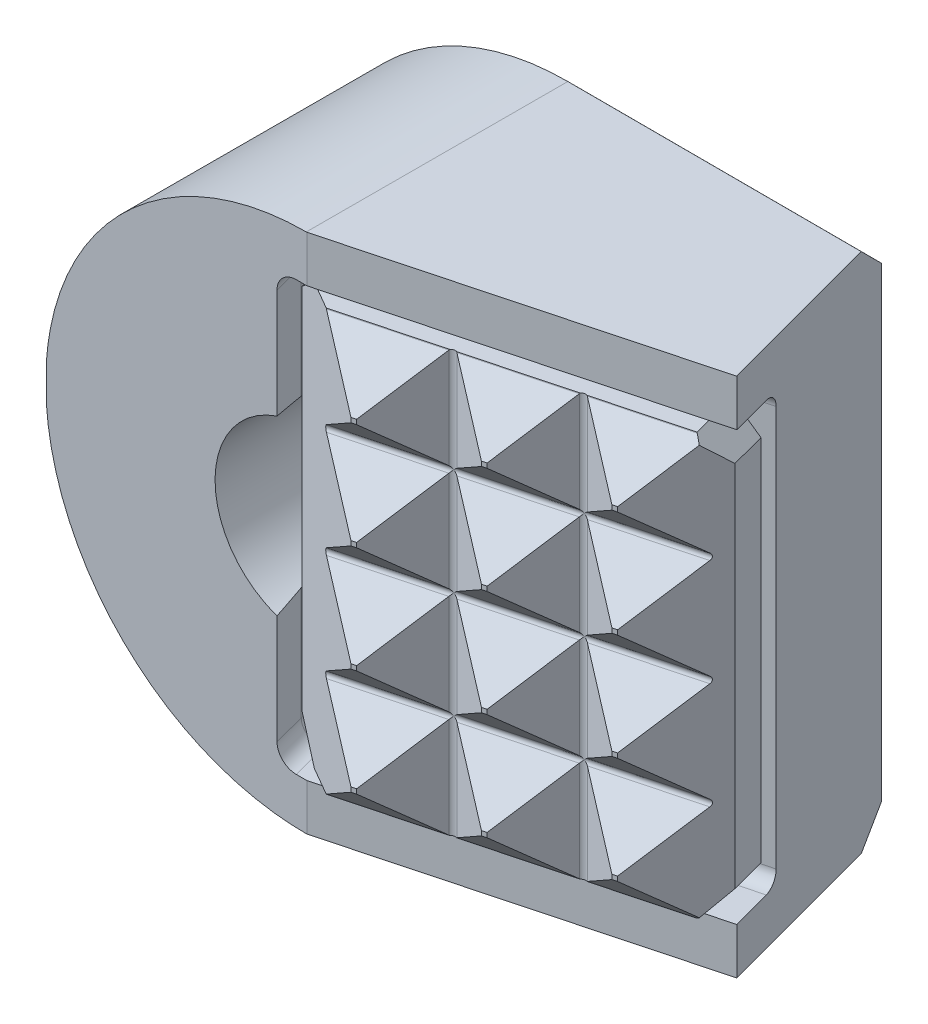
ISO-10303-21;
HEADER;
FILE_DESCRIPTION(('STEP AP214'),'2;1');
FILE_NAME('part.step','',(''),(''),'','','');
FILE_SCHEMA(('AUTOMOTIVE_DESIGN { 1 0 10303 214 1 1 1 1 }'));
ENDSEC;
DATA;
#1=APPLICATION_CONTEXT('core data for automotive mechanical design processes');
#2=APPLICATION_PROTOCOL_DEFINITION('international standard','automotive_design',2000,#1);
#3=PRODUCT_CONTEXT('',#1,'mechanical');
#4=PRODUCT('Part','Part','',(#3));
#5=PRODUCT_RELATED_PRODUCT_CATEGORY('part','',(#4));
#6=PRODUCT_DEFINITION_FORMATION('','',#4);
#7=PRODUCT_DEFINITION_CONTEXT('part definition',#1,'design');
#8=PRODUCT_DEFINITION('design','',#6,#7);
#9=PRODUCT_DEFINITION_SHAPE('','',#8);
#10=(LENGTH_UNIT() NAMED_UNIT(*) SI_UNIT(.MILLI.,.METRE.));
#11=(NAMED_UNIT(*) PLANE_ANGLE_UNIT() SI_UNIT($,.RADIAN.));
#12=(NAMED_UNIT(*) SI_UNIT($,.STERADIAN.) SOLID_ANGLE_UNIT());
#13=UNCERTAINTY_MEASURE_WITH_UNIT(LENGTH_MEASURE(1.E-05),#10,'distance_accuracy_value','');
#14=(GEOMETRIC_REPRESENTATION_CONTEXT(3) GLOBAL_UNCERTAINTY_ASSIGNED_CONTEXT((#13)) GLOBAL_UNIT_ASSIGNED_CONTEXT((#10,
#11,#12)) REPRESENTATION_CONTEXT('',''));
#15=CARTESIAN_POINT('',(0.,0.,0.));
#16=DIRECTION('',(0.,0.,1.));
#17=DIRECTION('',(1.,0.,0.));
#18=AXIS2_PLACEMENT_3D('',#15,#16,#17);
#19=CARTESIAN_POINT('',(-1.1543184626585,-5.3594,6.64098609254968));
#20=DIRECTION('',(0.966423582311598,0.,-0.256954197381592));
#21=DIRECTION('',(0.256954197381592,0.,0.966423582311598));
#22=AXIS2_PLACEMENT_3D('',#19,#20,#21);
#23=PLANE('',#22);
#24=CARTESIAN_POINT('',(-0.02104488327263,0.,10.9033111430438));
#25=DIRECTION('',(0.966423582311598,0.,-0.256954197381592));
#26=DIRECTION('',(-0.256954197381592,0.,-0.966423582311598));
#27=AXIS2_PLACEMENT_3D('',#24,#25,#26);
#28=ELLIPSE('',#27,9.65925826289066,2.5);
#29=CARTESIAN_POINT('',(-1.05641891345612,2.27208803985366,7.0091934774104));
#30=VERTEX_POINT('',#29);
#31=CARTESIAN_POINT('',(-0.816638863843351,2.36808135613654,7.91102383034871));
#32=VERTEX_POINT('',#31);
#33=EDGE_CURVE('E974',#30,#32,#28,.T.);
#34=ORIENTED_EDGE('',*,*,#33,.F.);
#35=DIRECTION('',(0.,1.,0.));
#36=VECTOR('',#35,1.);
#37=CARTESIAN_POINT('',(-1.05641891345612,-5.3594,7.0091934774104));
#38=LINE('',#37,#36);
#39=CARTESIAN_POINT('',(-1.05641891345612,5.3594,7.0091934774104));
#40=VERTEX_POINT('',#39);
#41=EDGE_CURVE('E616',#30,#40,#38,.T.);
#42=ORIENTED_EDGE('',*,*,#41,.T.);
#43=DIRECTION('',(0.256954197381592,0.,0.966423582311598));
#44=VECTOR('',#43,1.);
#45=CARTESIAN_POINT('',(-1.1543184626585,5.3594,6.64098609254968));
#46=LINE('',#45,#44);
#47=CARTESIAN_POINT('',(-0.816638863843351,5.3594,7.91102383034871));
#48=VERTEX_POINT('',#47);
#49=EDGE_CURVE('E802',#40,#48,#46,.T.);
#50=ORIENTED_EDGE('',*,*,#49,.T.);
#51=DIRECTION('',(0.,1.,0.));
#52=VECTOR('',#51,1.);
#53=CARTESIAN_POINT('',(-0.816638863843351,-7.1374,7.91102383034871));
#54=LINE('',#53,#52);
#55=EDGE_CURVE('E813',#32,#48,#54,.T.);
#56=ORIENTED_EDGE('',*,*,#55,.F.);
#57=EDGE_LOOP('',(#34,#42,#50,#56));
#58=FACE_BOUND('',#57,.T.);
#59=ADVANCED_FACE('F14',(#58),#23,.T.);
#60=CARTESIAN_POINT('',(-0.6882115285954,-5.3594,6.91129392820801));
#61=DIRECTION('',(0.,-1.,0.));
#62=DIRECTION('',(0.,0.,-1.));
#63=AXIS2_PLACEMENT_3D('',#60,#61,#62);
#64=CYLINDRICAL_SURFACE('',#63,0.381);
#65=DIRECTION('',(0.,1.,0.));
#66=VECTOR('',#65,1.);
#67=CARTESIAN_POINT('',(-0.786111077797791,-5.3594,6.54308654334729));
#68=LINE('',#67,#66);
#69=CARTESIAN_POINT('',(-0.786111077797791,-2.37733627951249,6.54308654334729));
#70=VERTEX_POINT('',#69);
#71=CARTESIAN_POINT('',(-0.786111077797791,-5.3594,6.54308654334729));
#72=VERTEX_POINT('',#71);
#73=EDGE_CURVE('E634',#70,#72,#68,.F.);
#74=ORIENTED_EDGE('',*,*,#73,.F.);
#75=CARTESIAN_POINT('',(-0.786111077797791,-2.37733627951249,6.54308654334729));
#76=CARTESIAN_POINT('',(-0.807747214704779,-2.37031040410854,6.54883042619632));
#77=CARTESIAN_POINT('',(-0.8288192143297,-2.36312322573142,6.55648264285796));
#78=CARTESIAN_POINT('',(-0.869333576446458,-2.34874781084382,6.57535636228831));
#79=CARTESIAN_POINT('',(-0.888773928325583,-2.34155958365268,6.58658218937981));
#80=CARTESIAN_POINT('',(-0.925481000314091,-2.32751751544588,6.61234930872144));
#81=CARTESIAN_POINT('',(-0.942746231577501,-2.32066390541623,6.62689285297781));
#82=CARTESIAN_POINT('',(-0.974565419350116,-2.30768407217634,6.65896087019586));
#83=CARTESIAN_POINT('',(-0.989120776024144,-2.3015574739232,6.67648379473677));
#84=CARTESIAN_POINT('',(-1.01463409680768,-2.29059732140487,6.71355438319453));
#85=CARTESIAN_POINT('',(-1.02568345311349,-2.28573165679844,6.73302935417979));
#86=CARTESIAN_POINT('',(-1.04427165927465,-2.27744157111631,6.77387307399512));
#87=CARTESIAN_POINT('',(-1.05181264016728,-2.27401627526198,6.79524066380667));
#88=CARTESIAN_POINT('',(-1.06253594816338,-2.26912389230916,6.83731173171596));
#89=CARTESIAN_POINT('',(-1.0660323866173,-2.26751595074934,6.85791909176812));
#90=CARTESIAN_POINT('',(-1.06959767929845,-2.26589483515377,6.89948655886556));
#91=CARTESIAN_POINT('',(-1.06966961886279,-2.26588022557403,6.92044633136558));
#92=CARTESIAN_POINT('',(-1.06712776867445,-2.26709151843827,6.95273819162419));
#93=CARTESIAN_POINT('',(-1.06569625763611,-2.26776764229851,6.96419930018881));
#94=CARTESIAN_POINT('',(-1.06181372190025,-2.26958508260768,6.98688927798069));
#95=CARTESIAN_POINT('',(-1.05936450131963,-2.27072557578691,6.99811852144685));
#96=CARTESIAN_POINT('',(-1.05641891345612,-2.27208803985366,7.0091934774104));
#97=B_SPLINE_CURVE_WITH_KNOTS('',3,(#75,#76,#77,#78,#79,#80,#81,#82,#83,#84,#85,#86,#87,#88,#89,
#90,#91,#92,#93,#94,#95,#96),.UNSPECIFIED.,.F.,.F.,(4,2,2,2,2,2,2,2,2,2,4),(0.,
0.0702991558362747,0.140683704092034,0.211116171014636,0.281512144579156,0.349884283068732,
0.418214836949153,0.48077922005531,0.543287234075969,0.577946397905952,0.612544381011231),.UNSPECIFIED.);
#98=CARTESIAN_POINT('',(-1.05641891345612,-2.27208803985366,7.0091934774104));
#99=VERTEX_POINT('',#98);
#100=EDGE_CURVE('E618',#70,#99,#97,.T.);
#101=ORIENTED_EDGE('',*,*,#100,.T.);
#102=CARTESIAN_POINT('',(-1.05641891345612,-5.3594,7.0091934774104));
#103=VERTEX_POINT('',#102);
#104=EDGE_CURVE('E656',#103,#99,#38,.T.);
#105=ORIENTED_EDGE('',*,*,#104,.F.);
#106=CARTESIAN_POINT('',(-0.6882115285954,-5.3594,6.91129392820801));
#107=DIRECTION('',(0.,1.,0.));
#108=DIRECTION('',(0.,0.,1.));
#109=AXIS2_PLACEMENT_3D('',#106,#107,#108);
#110=CIRCLE('',#109,0.381);
#111=EDGE_CURVE('E788',#72,#103,#110,.T.);
#112=ORIENTED_EDGE('',*,*,#111,.F.);
#113=EDGE_LOOP('',(#74,#101,#105,#112));
#114=FACE_BOUND('',#113,.T.);
#115=ADVANCED_FACE('F943',(#114),#64,.F.);
#116=CARTESIAN_POINT('',(-7.13740542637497,-7.1374,7.91102383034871));
#117=DIRECTION('',(0.,0.,1.));
#118=DIRECTION('',(0.,-1.,0.));
#119=AXIS2_PLACEMENT_3D('',#116,#117,#118);
#120=PLANE('',#119);
#121=CARTESIAN_POINT('',(-0.0152693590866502,0.,7.91102383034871));
#122=DIRECTION('',(0.,0.,1.));
#123=DIRECTION('',(1.,0.,0.));
#124=AXIS2_PLACEMENT_3D('',#121,#122,#123);
#125=ELLIPSE('',#124,2.50000465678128,2.5);
#126=CARTESIAN_POINT('',(-0.816638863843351,-2.36808135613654,7.91102383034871));
#127=VERTEX_POINT('',#126);
#128=EDGE_CURVE('E979',#32,#127,#125,.T.);
#129=ORIENTED_EDGE('',*,*,#128,.F.);
#130=ORIENTED_EDGE('',*,*,#55,.T.);
#131=CARTESIAN_POINT('',(-0.29098943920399,5.3594,7.91102383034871));
#132=DIRECTION('',(0.,0.,1.));
#133=DIRECTION('',(1.,0.,0.));
#134=AXIS2_PLACEMENT_3D('',#131,#132,#133);
#135=ELLIPSE('',#134,0.525649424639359,0.508);
#136=CARTESIAN_POINT('',(-0.29098943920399,5.8674,7.91102383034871));
#137=VERTEX_POINT('',#136);
#138=EDGE_CURVE('E905',#137,#48,#135,.T.);
#139=ORIENTED_EDGE('',*,*,#138,.F.);
#140=DIRECTION('',(-1.,0.,0.));
#141=VECTOR('',#140,1.);
#142=CARTESIAN_POINT('',(-7.13740542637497,5.8674,7.91102383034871));
#143=LINE('',#142,#141);
#144=CARTESIAN_POINT('',(-5.42637497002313E-06,5.8674,7.9110238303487));
#145=VERTEX_POINT('',#144);
#146=EDGE_CURVE('E820',#145,#137,#143,.T.);
#147=ORIENTED_EDGE('',*,*,#146,.F.);
#148=DIRECTION('',(0.,1.,0.));
#149=VECTOR('',#148,1.);
#150=CARTESIAN_POINT('',(-5.42637497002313E-06,-7.1374,7.91102383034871));
#151=LINE('',#150,#149);
#152=CARTESIAN_POINT('',(-5.42637497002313E-06,7.1374,7.91102383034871));
#153=VERTEX_POINT('',#152);
#154=EDGE_CURVE('E868',#145,#153,#151,.T.);
#155=ORIENTED_EDGE('',*,*,#154,.T.);
#156=DIRECTION('',(1.,0.,0.));
#157=VECTOR('',#156,1.);
#158=CARTESIAN_POINT('',(-7.13740542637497,7.1374,7.91102383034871));
#159=LINE('',#158,#157);
#160=CARTESIAN_POINT('',(-0.0152693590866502,7.1374,7.91102383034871));
#161=VERTEX_POINT('',#160);
#162=EDGE_CURVE('E849',#161,#153,#159,.T.);
#163=ORIENTED_EDGE('',*,*,#162,.F.);
#164=CARTESIAN_POINT('',(-0.0152693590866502,0.,7.91102383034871));
#165=DIRECTION('',(0.,0.,1.));
#166=DIRECTION('',(1.,0.,0.));
#167=AXIS2_PLACEMENT_3D('',#164,#165,#166);
#168=ELLIPSE('',#167,7.13741329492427,7.1374);
#169=CARTESIAN_POINT('',(-7.137405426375,0.466739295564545,7.91102383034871));
#170=VERTEX_POINT('',#169);
#171=EDGE_CURVE('E845',#161,#170,#168,.T.);
#172=ORIENTED_EDGE('',*,*,#171,.T.);
#173=DIRECTION('',(0.,1.,0.));
#174=VECTOR('',#173,1.);
#175=CARTESIAN_POINT('',(-7.13740542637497,-7.1374,7.91102383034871));
#176=LINE('',#175,#174);
#177=CARTESIAN_POINT('',(-7.137405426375,-0.466739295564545,7.91102383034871));
#178=VERTEX_POINT('',#177);
#179=EDGE_CURVE('E865',#178,#170,#176,.T.);
#180=ORIENTED_EDGE('',*,*,#179,.F.);
#181=CARTESIAN_POINT('',(-0.0152693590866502,-7.1374,7.91102383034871));
#182=VERTEX_POINT('',#181);
#183=EDGE_CURVE('E841',#178,#182,#168,.T.);
#184=ORIENTED_EDGE('',*,*,#183,.T.);
#185=DIRECTION('',(1.,0.,0.));
#186=VECTOR('',#185,1.);
#187=CARTESIAN_POINT('',(-7.13740542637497,-7.1374,7.91102383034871));
#188=LINE('',#187,#186);
#189=CARTESIAN_POINT('',(-5.42637497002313E-06,-7.1374,7.91102383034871));
#190=VERTEX_POINT('',#189);
#191=EDGE_CURVE('E858',#182,#190,#188,.T.);
#192=ORIENTED_EDGE('',*,*,#191,.T.);
#193=CARTESIAN_POINT('',(-5.42637497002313E-06,-5.8674,7.9110238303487));
#194=VERTEX_POINT('',#193);
#195=EDGE_CURVE('E869',#190,#194,#151,.T.);
#196=ORIENTED_EDGE('',*,*,#195,.T.);
#197=DIRECTION('',(-1.,0.,0.));
#198=VECTOR('',#197,1.);
#199=CARTESIAN_POINT('',(-7.13740542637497,-5.8674,7.91102383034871));
#200=LINE('',#199,#198);
#201=CARTESIAN_POINT('',(-0.29098943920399,-5.8674,7.91102383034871));
#202=VERTEX_POINT('',#201);
#203=EDGE_CURVE('E826',#194,#202,#200,.T.);
#204=ORIENTED_EDGE('',*,*,#203,.T.);
#205=CARTESIAN_POINT('',(-0.29098943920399,-5.3594,7.91102383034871));
#206=DIRECTION('',(0.,0.,1.));
#207=DIRECTION('',(1.,0.,0.));
#208=AXIS2_PLACEMENT_3D('',#205,#206,#207);
#209=ELLIPSE('',#208,0.525649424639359,0.508);
#210=CARTESIAN_POINT('',(-0.816638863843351,-5.3594,7.91102383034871));
#211=VERTEX_POINT('',#210);
#212=EDGE_CURVE('E638',#211,#202,#209,.T.);
#213=ORIENTED_EDGE('',*,*,#212,.F.);
#214=EDGE_CURVE('E814',#211,#127,#54,.T.);
#215=ORIENTED_EDGE('',*,*,#214,.T.);
#216=EDGE_LOOP('',(#129,#130,#139,#147,#155,#163,#172,#180,#184,#192,#196,#204,#213,#215));
#217=FACE_BOUND('',#216,.T.);
#218=ADVANCED_FACE('F951',(#217),#120,.T.);
#219=CARTESIAN_POINT('',(7.84859457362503,-7.1374,0.0151488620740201));
#220=DIRECTION('',(-0.965925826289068,0.,0.25881904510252));
#221=DIRECTION('',(-0.25881904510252,0.,-0.965925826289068));
#222=AXIS2_PLACEMENT_3D('',#219,#220,#221);
#223=PLANE('',#222);
#224=DIRECTION('',(-0.25881904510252,0.,-0.965925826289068));
#225=VECTOR('',#224,1.);
#226=CARTESIAN_POINT('',(7.84859457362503,-5.8674,0.0151488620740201));
#227=LINE('',#226,#225);
#228=CARTESIAN_POINT('',(9.30161492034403,-5.8674,5.43789462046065));
#229=VERTEX_POINT('',#228);
#230=CARTESIAN_POINT('',(9.00578420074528,-5.8674,4.33383934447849));
#231=VERTEX_POINT('',#230);
#232=EDGE_CURVE('E823',#229,#231,#227,.T.);
#233=ORIENTED_EDGE('',*,*,#232,.F.);
#234=DIRECTION('',(0.,1.,0.));
#235=VECTOR('',#234,1.);
#236=CARTESIAN_POINT('',(9.30161492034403,-7.1374,5.43789462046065));
#237=LINE('',#236,#235);
#238=CARTESIAN_POINT('',(9.30161492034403,-7.1374,5.43789462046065));
#239=VERTEX_POINT('',#238);
#240=EDGE_CURVE('E873',#239,#229,#237,.T.);
#241=ORIENTED_EDGE('',*,*,#240,.F.);
#242=DIRECTION('',(0.25881904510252,0.,0.965925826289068));
#243=VECTOR('',#242,1.);
#244=CARTESIAN_POINT('',(7.84859457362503,-7.1374,0.0151488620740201));
#245=LINE('',#244,#243);
#246=CARTESIAN_POINT('',(8.05287788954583,-7.1374,0.777544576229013));
#247=VERTEX_POINT('',#246);
#248=EDGE_CURVE('E863',#247,#239,#245,.T.);
#249=ORIENTED_EDGE('',*,*,#248,.F.);
#250=DIRECTION('',(0.186203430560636,-0.694559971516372,0.694920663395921));
#251=VECTOR('',#250,1.);
#252=CARTESIAN_POINT('',(7.52289364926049,-5.16049851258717,-1.20038353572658));
#253=LINE('',#252,#251);
#254=CARTESIAN_POINT('',(7.84859457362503,-6.3754,0.0151488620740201));
#255=VERTEX_POINT('',#254);
#256=EDGE_CURVE('E884',#247,#255,#253,.F.);
#257=ORIENTED_EDGE('',*,*,#256,.T.);
#258=DIRECTION('',(0.,1.,0.));
#259=VECTOR('',#258,1.);
#260=CARTESIAN_POINT('',(7.84859457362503,-7.1374,0.0151488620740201));
#261=LINE('',#260,#259);
#262=CARTESIAN_POINT('',(7.84859457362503,6.3754,0.0151488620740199));
#263=VERTEX_POINT('',#262);
#264=EDGE_CURVE('E876',#255,#263,#261,.T.);
#265=ORIENTED_EDGE('',*,*,#264,.T.);
#266=DIRECTION('',(0.186203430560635,0.694559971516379,0.694920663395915));
#267=VECTOR('',#266,1.);
#268=CARTESIAN_POINT('',(7.32526141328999,4.42330779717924,-1.93795708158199));
#269=LINE('',#268,#267);
#270=CARTESIAN_POINT('',(8.05287788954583,7.1374,0.777544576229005));
#271=VERTEX_POINT('',#270);
#272=EDGE_CURVE('E882',#263,#271,#269,.T.);
#273=ORIENTED_EDGE('',*,*,#272,.T.);
#274=DIRECTION('',(0.25881904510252,0.,0.965925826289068));
#275=VECTOR('',#274,1.);
#276=CARTESIAN_POINT('',(7.84859457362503,7.1374,0.0151488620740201));
#277=LINE('',#276,#275);
#278=CARTESIAN_POINT('',(9.30161492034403,7.1374,5.43789462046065));
#279=VERTEX_POINT('',#278);
#280=EDGE_CURVE('E855',#271,#279,#277,.T.);
#281=ORIENTED_EDGE('',*,*,#280,.T.);
#282=CARTESIAN_POINT('',(9.30161492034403,5.8674,5.43789462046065));
#283=VERTEX_POINT('',#282);
#284=EDGE_CURVE('E872',#283,#279,#237,.T.);
#285=ORIENTED_EDGE('',*,*,#284,.F.);
#286=DIRECTION('',(-0.25881904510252,0.,-0.965925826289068));
#287=VECTOR('',#286,1.);
#288=CARTESIAN_POINT('',(7.84859457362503,5.8674,0.0151488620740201));
#289=LINE('',#288,#287);
#290=CARTESIAN_POINT('',(9.00578420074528,5.8674,4.33383934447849));
#291=VERTEX_POINT('',#290);
#292=EDGE_CURVE('E817',#283,#291,#289,.T.);
#293=ORIENTED_EDGE('',*,*,#292,.T.);
#294=CARTESIAN_POINT('',(9.00578420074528,5.4864,4.33383934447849));
#295=DIRECTION('',(-0.965925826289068,0.,0.25881904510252));
#296=DIRECTION('',(-0.25881904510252,0.,-0.965925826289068));
#297=AXIS2_PLACEMENT_3D('',#294,#295,#296);
#298=ELLIPSE('',#297,0.381000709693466,0.381);
#299=CARTESIAN_POINT('',(8.90717396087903,5.4864,3.96582091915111));
#300=VERTEX_POINT('',#299);
#301=EDGE_CURVE('E659',#291,#300,#298,.T.);
#302=ORIENTED_EDGE('',*,*,#301,.T.);
#303=DIRECTION('',(0.,1.,0.));
#304=VECTOR('',#303,1.);
#305=CARTESIAN_POINT('',(8.90717396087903,-7.1374,3.96582091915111));
#306=LINE('',#305,#304);
#307=CARTESIAN_POINT('',(8.90717396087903,-5.4864,3.96582091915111));
#308=VERTEX_POINT('',#307);
#309=EDGE_CURVE('E810',#308,#300,#306,.T.);
#310=ORIENTED_EDGE('',*,*,#309,.F.);
#311=CARTESIAN_POINT('',(9.00578420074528,-5.4864,4.33383934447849));
#312=DIRECTION('',(-0.965925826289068,0.,0.25881904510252));
#313=DIRECTION('',(0.25881904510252,0.,0.965925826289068));
#314=AXIS2_PLACEMENT_3D('',#311,#312,#313);
#315=ELLIPSE('',#314,0.381000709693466,0.381);
#316=EDGE_CURVE('E661',#308,#231,#315,.T.);
#317=ORIENTED_EDGE('',*,*,#316,.T.);
#318=EDGE_LOOP('',(#233,#241,#249,#257,#265,#273,#281,#285,#293,#302,#310,#317));
#319=FACE_BOUND('',#318,.T.);
#320=ADVANCED_FACE('F2674',(#319),#223,.F.);
#321=CARTESIAN_POINT('',(9.30161492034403,-7.1374,5.43789462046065));
#322=DIRECTION('',(-0.256954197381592,0.,-0.966423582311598));
#323=DIRECTION('',(0.966423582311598,0.,-0.256954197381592));
#324=AXIS2_PLACEMENT_3D('',#321,#322,#323);
#325=PLANE('',#324);
#326=DIRECTION('',(-0.966423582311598,0.,0.256954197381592));
#327=VECTOR('',#326,1.);
#328=CARTESIAN_POINT('',(9.30161492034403,-5.8674,5.43789462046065));
#329=LINE('',#328,#327);
#330=EDGE_CURVE('E797',#229,#194,#329,.T.);
#331=ORIENTED_EDGE('',*,*,#330,.T.);
#332=ORIENTED_EDGE('',*,*,#195,.F.);
#333=DIRECTION('',(-0.966423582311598,0.,0.256954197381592));
#334=VECTOR('',#333,1.);
#335=CARTESIAN_POINT('',(9.30161492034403,-7.1374,5.43789462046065));
#336=LINE('',#335,#334);
#337=EDGE_CURVE('E860',#239,#190,#336,.T.);
#338=ORIENTED_EDGE('',*,*,#337,.F.);
#339=ORIENTED_EDGE('',*,*,#240,.T.);
#340=EDGE_LOOP('',(#331,#332,#338,#339));
#341=FACE_BOUND('',#340,.T.);
#342=ADVANCED_FACE('F941',(#341),#325,.F.);
#343=CARTESIAN_POINT('',(-0.0152958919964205,0.,7.9247704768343));
#344=DIRECTION('',(0.00193013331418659,0.,-0.99999813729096));
#345=DIRECTION('',(0.99999813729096,0.,0.00193013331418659));
#346=AXIS2_PLACEMENT_3D('',#343,#344,#345);
#347=CYLINDRICAL_SURFACE('',#346,7.1374);
#348=DIRECTION('',(0.00193013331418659,0.,-0.99999813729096));
#349=VECTOR('',#348,1.);
#350=CARTESIAN_POINT('',(-0.0152958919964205,7.1374,7.9247704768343));
#351=LINE('',#350,#349);
#352=CARTESIAN_POINT('',(-0.00147076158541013,7.1374,0.761998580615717));
#353=VERTEX_POINT('',#352);
#354=EDGE_CURVE('E835',#161,#353,#351,.T.);
#355=ORIENTED_EDGE('',*,*,#354,.T.);
#356=CARTESIAN_POINT('',(-0.00147076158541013,0.,0.761998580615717));
#357=DIRECTION('',(-0.00193013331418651,0.,0.99999813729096));
#358=DIRECTION('',(-0.99999813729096,0.,-0.00193013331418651));
#359=AXIS2_PLACEMENT_3D('',#356,#357,#358);
#360=CIRCLE('',#359,7.1374);
#361=CARTESIAN_POINT('',(-7.13740542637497,0.143963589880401,0.748225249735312));
#362=VERTEX_POINT('',#361);
#363=EDGE_CURVE('E896',#353,#362,#360,.T.);
#364=ORIENTED_EDGE('',*,*,#363,.T.);
#365=CARTESIAN_POINT('',(-7.13740542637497,0.,3697.87520841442));
#366=DIRECTION('',(-1.,0.,0.));
#367=DIRECTION('',(0.,0.,-1.));
#368=AXIS2_PLACEMENT_3D('',#365,#366,#367);
#369=ELLIPSE('',#368,3697.87928509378,7.1374);
#370=EDGE_CURVE('E846',#170,#362,#369,.T.);
#371=ORIENTED_EDGE('',*,*,#370,.F.);
#372=ORIENTED_EDGE('',*,*,#171,.F.);
#373=EDGE_LOOP('',(#355,#364,#371,#372));
#374=FACE_BOUND('',#373,.T.);
#375=ADVANCED_FACE('F927',(#374),#347,.T.);
#376=CARTESIAN_POINT('',(-7.13740542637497,-7.1374,-0.0137761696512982));
#377=DIRECTION('',(-1.,0.,0.));
#378=DIRECTION('',(0.,0.,-1.));
#379=AXIS2_PLACEMENT_3D('',#376,#377,#378);
#380=PLANE('',#379);
#381=ORIENTED_EDGE('',*,*,#370,.T.);
#382=CARTESIAN_POINT('',(-7.13740542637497,0.143963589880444,0.74822524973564));
#383=CARTESIAN_POINT('',(-7.13740542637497,0.0959757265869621,0.747259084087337));
#384=CARTESIAN_POINT('',(-7.13740542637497,0.0479878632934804,0.746776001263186));
#385=CARTESIAN_POINT('',(-7.13740542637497,-0.047987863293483,0.746776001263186));
#386=CARTESIAN_POINT('',(-7.13740542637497,-0.0959757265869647,0.747259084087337));
#387=CARTESIAN_POINT('',(-7.13740542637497,-0.143963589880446,0.74822524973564));
#388=B_SPLINE_CURVE_WITH_KNOTS('',3,(#382,#383,#384,#385,#386,#387),.UNSPECIFIED.,.F.,.F.,(4,2,
4),(0.,0.143970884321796,0.287941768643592),.UNSPECIFIED.);
#389=CARTESIAN_POINT('',(-7.13740542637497,-0.143963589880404,0.74822524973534));
#390=VERTEX_POINT('',#389);
#391=EDGE_CURVE('E898',#362,#390,#388,.T.);
#392=ORIENTED_EDGE('',*,*,#391,.T.);
#393=EDGE_CURVE('E844',#390,#178,#369,.T.);
#394=ORIENTED_EDGE('',*,*,#393,.T.);
#395=ORIENTED_EDGE('',*,*,#179,.T.);
#396=EDGE_LOOP('',(#381,#392,#394,#395));
#397=FACE_BOUND('',#396,.T.);
#398=ADVANCED_FACE('F906',(#397),#380,.T.);
#399=CARTESIAN_POINT('',(-7.13740542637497,-7.1374,-0.0137761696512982));
#400=DIRECTION('',(-0.00193013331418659,0.,0.99999813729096));
#401=DIRECTION('',(-0.99999813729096,0.,-0.00193013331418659));
#402=AXIS2_PLACEMENT_3D('',#399,#400,#401);
#403=PLANE('',#402);
#404=CARTESIAN_POINT('',(0.,0.,0.));
#405=DIRECTION('',(0.00193013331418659,0.,-0.99999813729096));
#406=DIRECTION('',(0.99999813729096,0.,0.00193013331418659));
#407=AXIS2_PLACEMENT_3D('',#404,#405,#406);
#408=CIRCLE('',#407,2.5);
#409=CARTESIAN_POINT('',(2.4999953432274,0.,0.00482533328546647));
#410=VERTEX_POINT('',#409);
#411=EDGE_CURVE('E992',#410,#410,#408,.T.);
#412=ORIENTED_EDGE('',*,*,#411,.F.);
#413=EDGE_LOOP('',(#412));
#414=FACE_BOUND('',#413,.T.);
#415=ORIENTED_EDGE('',*,*,#264,.F.);
#416=DIRECTION('',(-0.99999813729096,0.,-0.00193013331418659));
#417=VECTOR('',#416,1.);
#418=CARTESIAN_POINT('',(-7.13740542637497,-6.3754,-0.0137761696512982));
#419=LINE('',#418,#417);
#420=CARTESIAN_POINT('',(0.,-6.3754,0.));
#421=VERTEX_POINT('',#420);
#422=EDGE_CURVE('E890',#255,#421,#419,.T.);
#423=ORIENTED_EDGE('',*,*,#422,.T.);
#424=CARTESIAN_POINT('',(0.,0.,0.));
#425=DIRECTION('',(-0.00193013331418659,0.,0.99999813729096));
#426=DIRECTION('',(-0.99999813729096,0.,-0.00193013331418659));
#427=AXIS2_PLACEMENT_3D('',#424,#425,#426);
#428=CIRCLE('',#427,6.3754);
#429=CARTESIAN_POINT('',(0.,6.3754,0.));
#430=VERTEX_POINT('',#429);
#431=EDGE_CURVE('E886',#421,#430,#428,.F.);
#432=ORIENTED_EDGE('',*,*,#431,.T.);
#433=DIRECTION('',(0.99999813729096,0.,0.00193013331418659));
#434=VECTOR('',#433,1.);
#435=CARTESIAN_POINT('',(7.84859457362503,6.3754,0.0151488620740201));
#436=LINE('',#435,#434);
#437=EDGE_CURVE('E888',#430,#263,#436,.T.);
#438=ORIENTED_EDGE('',*,*,#437,.T.);
#439=EDGE_LOOP('',(#415,#423,#432,#438));
#440=FACE_BOUND('',#439,.T.);
#441=ADVANCED_FACE('F16',(#414,#440),#403,.F.);
#442=CARTESIAN_POINT('',(-7.13740542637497,7.1374,7.91102383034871));
#443=DIRECTION('',(0.,1.,0.));
#444=DIRECTION('',(0.,0.,1.));
#445=AXIS2_PLACEMENT_3D('',#442,#443,#444);
#446=PLANE('',#445);
#447=ORIENTED_EDGE('',*,*,#280,.F.);
#448=DIRECTION('',(-0.99999813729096,0.,-0.00193013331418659));
#449=VECTOR('',#448,1.);
#450=CARTESIAN_POINT('',(-0.00147076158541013,7.1374,0.761998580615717));
#451=LINE('',#450,#449);
#452=EDGE_CURVE('E892',#271,#353,#451,.T.);
#453=ORIENTED_EDGE('',*,*,#452,.T.);
#454=ORIENTED_EDGE('',*,*,#354,.F.);
#455=ORIENTED_EDGE('',*,*,#162,.T.);
#456=DIRECTION('',(-0.966423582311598,0.,0.256954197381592));
#457=VECTOR('',#456,1.);
#458=CARTESIAN_POINT('',(9.30161492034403,7.1374,5.43789462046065));
#459=LINE('',#458,#457);
#460=EDGE_CURVE('E852',#279,#153,#459,.T.);
#461=ORIENTED_EDGE('',*,*,#460,.F.);
#462=EDGE_LOOP('',(#447,#453,#454,#455,#461));
#463=FACE_BOUND('',#462,.T.);
#464=ADVANCED_FACE('F928',(#463),#446,.T.);
#465=ORIENTED_EDGE('',*,*,#154,.F.);
#466=DIRECTION('',(-0.966423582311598,0.,0.256954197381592));
#467=VECTOR('',#466,1.);
#468=CARTESIAN_POINT('',(9.30161492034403,5.8674,5.43789462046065));
#469=LINE('',#468,#467);
#470=EDGE_CURVE('E795',#283,#145,#469,.T.);
#471=ORIENTED_EDGE('',*,*,#470,.F.);
#472=ORIENTED_EDGE('',*,*,#284,.T.);
#473=ORIENTED_EDGE('',*,*,#460,.T.);
#474=EDGE_LOOP('',(#465,#471,#472,#473));
#475=FACE_BOUND('',#474,.T.);
#476=ADVANCED_FACE('F930',(#475),#325,.F.);
#477=CARTESIAN_POINT('',(-7.13740542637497,-7.1374,7.91102383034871));
#478=DIRECTION('',(0.,1.,0.));
#479=DIRECTION('',(0.,0.,1.));
#480=AXIS2_PLACEMENT_3D('',#477,#478,#479);
#481=PLANE('',#480);
#482=DIRECTION('',(0.00193013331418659,0.,-0.99999813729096));
#483=VECTOR('',#482,1.);
#484=CARTESIAN_POINT('',(-0.0152958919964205,-7.1374,7.9247704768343));
#485=LINE('',#484,#483);
#486=CARTESIAN_POINT('',(-0.00147076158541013,-7.1374,0.761998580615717));
#487=VERTEX_POINT('',#486);
#488=EDGE_CURVE('E838',#182,#487,#485,.T.);
#489=ORIENTED_EDGE('',*,*,#488,.T.);
#490=DIRECTION('',(0.99999813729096,0.,0.00193013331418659));
#491=VECTOR('',#490,1.);
#492=CARTESIAN_POINT('',(-7.12358029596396,-7.1374,0.748251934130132));
#493=LINE('',#492,#491);
#494=EDGE_CURVE('E879',#487,#247,#493,.T.);
#495=ORIENTED_EDGE('',*,*,#494,.T.);
#496=ORIENTED_EDGE('',*,*,#248,.T.);
#497=ORIENTED_EDGE('',*,*,#337,.T.);
#498=ORIENTED_EDGE('',*,*,#191,.F.);
#499=EDGE_LOOP('',(#489,#495,#496,#497,#498));
#500=FACE_BOUND('',#499,.T.);
#501=ADVANCED_FACE('F925',(#500),#481,.F.);
#502=ORIENTED_EDGE('',*,*,#393,.F.);
#503=CARTESIAN_POINT('',(-0.00147076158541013,0.,0.761998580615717));
#504=DIRECTION('',(-0.00193013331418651,0.,0.99999813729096));
#505=DIRECTION('',(-0.99999813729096,0.,-0.00193013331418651));
#506=AXIS2_PLACEMENT_3D('',#503,#504,#505);
#507=CIRCLE('',#506,7.1374);
#508=EDGE_CURVE('E894',#390,#487,#507,.T.);
#509=ORIENTED_EDGE('',*,*,#508,.T.);
#510=ORIENTED_EDGE('',*,*,#488,.F.);
#511=ORIENTED_EDGE('',*,*,#183,.F.);
#512=EDGE_LOOP('',(#502,#509,#510,#511));
#513=FACE_BOUND('',#512,.T.);
#514=ADVANCED_FACE('F921',(#513),#347,.T.);
#515=CARTESIAN_POINT('',(-7.13740542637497,6.3754,-0.0137761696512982));
#516=DIRECTION('',(0.00136481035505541,0.707106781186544,-0.707105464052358));
#517=DIRECTION('',(0.,0.707106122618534,0.707107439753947));
#518=AXIS2_PLACEMENT_3D('',#515,#516,#517);
#519=PLANE('',#518);
#520=ORIENTED_EDGE('',*,*,#272,.F.);
#521=ORIENTED_EDGE('',*,*,#437,.F.);
#522=DIRECTION('',(0.00136481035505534,-0.707106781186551,-0.70710546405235));
#523=VECTOR('',#522,1.);
#524=CARTESIAN_POINT('',(-0.00147076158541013,7.1374,0.761998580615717));
#525=LINE('',#524,#523);
#526=EDGE_CURVE('E832',#353,#430,#525,.T.);
#527=ORIENTED_EDGE('',*,*,#526,.F.);
#528=ORIENTED_EDGE('',*,*,#452,.F.);
#529=EDGE_LOOP('',(#520,#521,#527,#528));
#530=FACE_BOUND('',#529,.T.);
#531=ADVANCED_FACE('F916',(#530),#519,.T.);
#532=CARTESIAN_POINT('',(0.,0.,0.));
#533=DIRECTION('',(-0.00193013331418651,0.,0.99999813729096));
#534=DIRECTION('',(-0.99999813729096,0.,-0.00193013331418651));
#535=AXIS2_PLACEMENT_3D('',#532,#533,#534);
#536=CONICAL_SURFACE('',#535,6.3754,0.785398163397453);
#537=ORIENTED_EDGE('',*,*,#526,.T.);
#538=ORIENTED_EDGE('',*,*,#431,.F.);
#539=DIRECTION('',(0.00136481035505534,0.707106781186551,-0.70710546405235));
#540=VECTOR('',#539,1.);
#541=CARTESIAN_POINT('',(-0.00147076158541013,-7.1374,0.761998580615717));
#542=LINE('',#541,#540);
#543=EDGE_CURVE('E829',#487,#421,#542,.T.);
#544=ORIENTED_EDGE('',*,*,#543,.F.);
#545=ORIENTED_EDGE('',*,*,#508,.F.);
#546=ORIENTED_EDGE('',*,*,#391,.F.);
#547=ORIENTED_EDGE('',*,*,#363,.F.);
#548=EDGE_LOOP('',(#537,#538,#544,#545,#546,#547));
#549=FACE_BOUND('',#548,.T.);
#550=ADVANCED_FACE('F910',(#549),#536,.T.);
#551=CARTESIAN_POINT('',(-7.12358029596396,-7.1374,0.748251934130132));
#552=DIRECTION('',(-0.0013648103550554,0.707106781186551,0.70710546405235));
#553=DIRECTION('',(0.,-0.707106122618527,0.707107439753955));
#554=AXIS2_PLACEMENT_3D('',#551,#552,#553);
#555=PLANE('',#554);
#556=ORIENTED_EDGE('',*,*,#543,.T.);
#557=ORIENTED_EDGE('',*,*,#422,.F.);
#558=ORIENTED_EDGE('',*,*,#256,.F.);
#559=ORIENTED_EDGE('',*,*,#494,.F.);
#560=EDGE_LOOP('',(#556,#557,#558,#559));
#561=FACE_BOUND('',#560,.T.);
#562=ADVANCED_FACE('F915',(#561),#555,.F.);
#563=CARTESIAN_POINT('',(8.91001672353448,-5.8674,3.96506508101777));
#564=DIRECTION('',(0.,1.,0.));
#565=DIRECTION('',(0.,0.,1.));
#566=AXIS2_PLACEMENT_3D('',#563,#564,#565);
#567=PLANE('',#566);
#568=ORIENTED_EDGE('',*,*,#232,.T.);
#569=DIRECTION('',(-0.966423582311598,0.,0.256954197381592));
#570=VECTOR('',#569,1.);
#571=CARTESIAN_POINT('',(9.00791627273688,-5.8674,4.33327246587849));
#572=LINE('',#571,#570);
#573=CARTESIAN_POINT('',(-0.565475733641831,-5.8674,6.87866074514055));
#574=VERTEX_POINT('',#573);
#575=EDGE_CURVE('E648',#231,#574,#572,.T.);
#576=ORIENTED_EDGE('',*,*,#575,.T.);
#577=DIRECTION('',(0.256954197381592,0.,0.966423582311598));
#578=VECTOR('',#577,1.);
#579=CARTESIAN_POINT('',(-0.663375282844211,-5.8674,6.51045336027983));
#580=LINE('',#579,#578);
#581=EDGE_CURVE('E808',#574,#202,#580,.T.);
#582=ORIENTED_EDGE('',*,*,#581,.T.);
#583=ORIENTED_EDGE('',*,*,#203,.F.);
#584=ORIENTED_EDGE('',*,*,#330,.F.);
#585=EDGE_LOOP('',(#568,#576,#582,#583,#584));
#586=FACE_BOUND('',#585,.T.);
#587=ADVANCED_FACE('F967',(#586),#567,.T.);
#588=CARTESIAN_POINT('',(8.91001672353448,5.8674,3.96506508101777));
#589=DIRECTION('',(0.,1.,0.));
#590=DIRECTION('',(0.,0.,1.));
#591=AXIS2_PLACEMENT_3D('',#588,#589,#590);
#592=PLANE('',#591);
#593=DIRECTION('',(0.256954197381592,0.,0.966423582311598));
#594=VECTOR('',#593,1.);
#595=CARTESIAN_POINT('',(-0.663375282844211,5.8674,6.51045336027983));
#596=LINE('',#595,#594);
#597=CARTESIAN_POINT('',(-0.565475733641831,5.8674,6.87866074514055));
#598=VERTEX_POINT('',#597);
#599=EDGE_CURVE('E800',#598,#137,#596,.T.);
#600=ORIENTED_EDGE('',*,*,#599,.F.);
#601=DIRECTION('',(-0.966423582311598,0.,0.256954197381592));
#602=VECTOR('',#601,1.);
#603=CARTESIAN_POINT('',(9.00791627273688,5.8674,4.33327246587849));
#604=LINE('',#603,#602);
#605=EDGE_CURVE('E646',#598,#291,#604,.F.);
#606=ORIENTED_EDGE('',*,*,#605,.T.);
#607=ORIENTED_EDGE('',*,*,#292,.F.);
#608=ORIENTED_EDGE('',*,*,#470,.T.);
#609=ORIENTED_EDGE('',*,*,#146,.T.);
#610=EDGE_LOOP('',(#600,#606,#607,#608,#609));
#611=FACE_BOUND('',#610,.T.);
#612=ADVANCED_FACE('F958',(#611),#592,.F.);
#613=EDGE_CURVE('E971',#127,#99,#28,.T.);
#614=ORIENTED_EDGE('',*,*,#613,.F.);
#615=ORIENTED_EDGE('',*,*,#214,.F.);
#616=DIRECTION('',(0.256954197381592,0.,0.966423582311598));
#617=VECTOR('',#616,1.);
#618=CARTESIAN_POINT('',(-1.1543184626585,-5.3594,6.64098609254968));
#619=LINE('',#618,#617);
#620=EDGE_CURVE('E805',#103,#211,#619,.T.);
#621=ORIENTED_EDGE('',*,*,#620,.F.);
#622=ORIENTED_EDGE('',*,*,#104,.T.);
#623=EDGE_LOOP('',(#614,#615,#621,#622));
#624=FACE_BOUND('',#623,.T.);
#625=ADVANCED_FACE('F946',(#624),#23,.T.);
#626=CARTESIAN_POINT('',(-0.663375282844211,5.3594,6.51045336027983));
#627=DIRECTION('',(0.256954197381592,0.,0.966423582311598));
#628=DIRECTION('',(-0.966423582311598,0.,0.256954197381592));
#629=AXIS2_PLACEMENT_3D('',#626,#627,#628);
#630=PLANE('',#629);
#631=CARTESIAN_POINT('',(-0.0122319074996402,0.,6.33732635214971));
#632=DIRECTION('',(0.256954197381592,0.,0.966423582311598));
#633=DIRECTION('',(0.966423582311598,0.,-0.256954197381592));
#634=AXIS2_PLACEMENT_3D('',#631,#632,#633);
#635=ELLIPSE('',#634,2.58819045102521,2.5);
#636=CARTESIAN_POINT('',(-0.786111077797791,2.37733627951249,6.5430865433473));
#637=VERTEX_POINT('',#636);
#638=CARTESIAN_POINT('',(-0.292044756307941,2.48430783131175,6.41172342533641));
#639=VERTEX_POINT('',#638);
#640=EDGE_CURVE('E621',#637,#639,#635,.F.);
#641=ORIENTED_EDGE('',*,*,#640,.T.);
#642=DIRECTION('',(0.,1.,0.));
#643=VECTOR('',#642,1.);
#644=CARTESIAN_POINT('',(-0.292044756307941,-4.7498,6.41172342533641));
#645=LINE('',#644,#643);
#646=CARTESIAN_POINT('',(-0.292044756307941,4.7498,6.41172342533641));
#647=VERTEX_POINT('',#646);
#648=EDGE_CURVE('E1394',#639,#647,#645,.T.);
#649=ORIENTED_EDGE('',*,*,#648,.T.);
#650=DIRECTION('',(0.646503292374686,0.743294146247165,-0.171893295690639));
#651=VECTOR('',#650,1.);
#652=CARTESIAN_POINT('',(-0.292044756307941,4.7498,6.41172342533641));
#653=LINE('',#652,#651);
#654=CARTESIAN_POINT('',(-0.0711203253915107,5.0038,6.35298369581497));
#655=VERTEX_POINT('',#654);
#656=EDGE_CURVE('E1392',#647,#655,#653,.T.);
#657=ORIENTED_EDGE('',*,*,#656,.T.);
#658=DIRECTION('',(-0.966423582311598,0.,0.256954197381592));
#659=VECTOR('',#658,1.);
#660=CARTESIAN_POINT('',(7.90670634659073,5.0038,4.23182679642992));
#661=LINE('',#660,#659);
#662=CARTESIAN_POINT('',(7.90670634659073,5.0038,4.23182679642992));
#663=VERTEX_POINT('',#662);
#664=EDGE_CURVE('E663',#663,#655,#661,.T.);
#665=ORIENTED_EDGE('',*,*,#664,.F.);
#666=DIRECTION('',(-0.646503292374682,0.743294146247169,0.171893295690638));
#667=VECTOR('',#666,1.);
#668=CARTESIAN_POINT('',(8.12763077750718,4.7498,4.17308706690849));
#669=LINE('',#668,#667);
#670=CARTESIAN_POINT('',(8.12763077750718,4.7498,4.17308706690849));
#671=VERTEX_POINT('',#670);
#672=EDGE_CURVE('E668',#671,#663,#669,.T.);
#673=ORIENTED_EDGE('',*,*,#672,.F.);
#674=DIRECTION('',(0.,1.,0.));
#675=VECTOR('',#674,1.);
#676=CARTESIAN_POINT('',(8.12763077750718,5.3594,4.1730870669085));
#677=LINE('',#676,#675);
#678=CARTESIAN_POINT('',(8.12763077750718,-4.7498,4.17308706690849));
#679=VERTEX_POINT('',#678);
#680=EDGE_CURVE('E664',#679,#671,#677,.T.);
#681=ORIENTED_EDGE('',*,*,#680,.F.);
#682=DIRECTION('',(0.646503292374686,0.743294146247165,-0.171893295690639));
#683=VECTOR('',#682,1.);
#684=CARTESIAN_POINT('',(9.05143046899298,-3.68769419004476,3.92746577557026));
#685=LINE('',#684,#683);
#686=CARTESIAN_POINT('',(7.90670634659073,-5.0038,4.23182679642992));
#687=VERTEX_POINT('',#686);
#688=EDGE_CURVE('E667',#687,#679,#685,.T.);
#689=ORIENTED_EDGE('',*,*,#688,.F.);
#690=DIRECTION('',(0.966423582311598,0.,-0.256954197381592));
#691=VECTOR('',#690,1.);
#692=CARTESIAN_POINT('',(-0.663375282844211,-5.0038,6.51045336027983));
#693=LINE('',#692,#691);
#694=CARTESIAN_POINT('',(-0.0711203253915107,-5.0038,6.35298369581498));
#695=VERTEX_POINT('',#694);
#696=EDGE_CURVE('E22',#687,#695,#693,.F.);
#697=ORIENTED_EDGE('',*,*,#696,.T.);
#698=DIRECTION('',(0.646503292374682,-0.743294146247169,-0.171893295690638));
#699=VECTOR('',#698,1.);
#700=CARTESIAN_POINT('',(-5.31611662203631,1.026447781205,7.74753142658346));
#701=LINE('',#700,#699);
#702=CARTESIAN_POINT('',(-0.292044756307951,-4.7498,6.41172342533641));
#703=VERTEX_POINT('',#702);
#704=EDGE_CURVE('E9',#703,#695,#701,.T.);
#705=ORIENTED_EDGE('',*,*,#704,.F.);
#706=CARTESIAN_POINT('',(-0.292044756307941,-2.48430783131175,6.41172342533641));
#707=VERTEX_POINT('',#706);
#708=EDGE_CURVE('E37',#703,#707,#645,.T.);
#709=ORIENTED_EDGE('',*,*,#708,.T.);
#710=EDGE_CURVE('E29',#707,#70,#635,.F.);
#711=ORIENTED_EDGE('',*,*,#710,.T.);
#712=ORIENTED_EDGE('',*,*,#73,.T.);
#713=CARTESIAN_POINT('',(-0.663375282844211,-5.3594,6.51045336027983));
#714=DIRECTION('',(0.256954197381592,0.,0.966423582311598));
#715=DIRECTION('',(-0.966423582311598,0.,0.256954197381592));
#716=AXIS2_PLACEMENT_3D('',#713,#714,#715);
#717=CIRCLE('',#716,0.127);
#718=CARTESIAN_POINT('',(-0.663375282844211,-5.4864,6.51045336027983));
#719=VERTEX_POINT('',#718);
#720=EDGE_CURVE('E633',#72,#719,#717,.T.);
#721=ORIENTED_EDGE('',*,*,#720,.T.);
#722=DIRECTION('',(-0.966423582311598,0.,0.256954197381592));
#723=VECTOR('',#722,1.);
#724=CARTESIAN_POINT('',(8.91001672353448,-5.4864,3.96506508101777));
#725=LINE('',#724,#723);
#726=EDGE_CURVE('E636',#719,#308,#725,.F.);
#727=ORIENTED_EDGE('',*,*,#726,.T.);
#728=ORIENTED_EDGE('',*,*,#309,.T.);
#729=DIRECTION('',(-0.966423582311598,0.,0.256954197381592));
#730=VECTOR('',#729,1.);
#731=CARTESIAN_POINT('',(-0.663375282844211,5.4864,6.51045336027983));
#732=LINE('',#731,#730);
#733=CARTESIAN_POINT('',(-0.663375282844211,5.4864,6.51045336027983));
#734=VERTEX_POINT('',#733);
#735=EDGE_CURVE('E644',#300,#734,#732,.T.);
#736=ORIENTED_EDGE('',*,*,#735,.T.);
#737=CARTESIAN_POINT('',(-0.663375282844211,5.3594,6.51045336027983));
#738=DIRECTION('',(0.256954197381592,0.,0.966423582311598));
#739=DIRECTION('',(-0.966423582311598,0.,0.256954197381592));
#740=AXIS2_PLACEMENT_3D('',#737,#738,#739);
#741=CIRCLE('',#740,0.127);
#742=CARTESIAN_POINT('',(-0.786111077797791,5.3594,6.54308654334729));
#743=VERTEX_POINT('',#742);
#744=EDGE_CURVE('E631',#734,#743,#741,.T.);
#745=ORIENTED_EDGE('',*,*,#744,.T.);
#746=EDGE_CURVE('E614',#743,#637,#68,.F.);
#747=ORIENTED_EDGE('',*,*,#746,.T.);
#748=EDGE_LOOP('',(#641,#649,#657,#665,#673,#681,#689,#697,#705,#709,#711,#712,#721,#727,#728,
#736,#745,#747));
#749=FACE_BOUND('',#748,.T.);
#750=ADVANCED_FACE('F628',(#749),#630,.T.);
#751=CARTESIAN_POINT('',(-0.663375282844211,-5.3594,6.51045336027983));
#752=DIRECTION('',(0.256954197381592,0.,0.966423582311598));
#753=DIRECTION('',(-0.966423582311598,0.,0.256954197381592));
#754=AXIS2_PLACEMENT_3D('',#751,#752,#753);
#755=CYLINDRICAL_SURFACE('',#754,0.508);
#756=ORIENTED_EDGE('',*,*,#581,.F.);
#757=CARTESIAN_POINT('',(-0.565475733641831,-5.3594,6.87866074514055));
#758=DIRECTION('',(0.256954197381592,0.,0.966423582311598));
#759=DIRECTION('',(-0.966423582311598,0.,0.256954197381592));
#760=AXIS2_PLACEMENT_3D('',#757,#758,#759);
#761=CIRCLE('',#760,0.508);
#762=EDGE_CURVE('E653',#574,#103,#761,.F.);
#763=ORIENTED_EDGE('',*,*,#762,.T.);
#764=ORIENTED_EDGE('',*,*,#620,.T.);
#765=ORIENTED_EDGE('',*,*,#212,.T.);
#766=EDGE_LOOP('',(#756,#763,#764,#765));
#767=FACE_BOUND('',#766,.T.);
#768=ADVANCED_FACE('F965',(#767),#755,.F.);
#769=CARTESIAN_POINT('',(-0.663375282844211,5.3594,6.51045336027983));
#770=DIRECTION('',(0.256954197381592,0.,0.966423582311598));
#771=DIRECTION('',(-0.966423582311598,0.,0.256954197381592));
#772=AXIS2_PLACEMENT_3D('',#769,#770,#771);
#773=CYLINDRICAL_SURFACE('',#772,0.508);
#774=ORIENTED_EDGE('',*,*,#49,.F.);
#775=CARTESIAN_POINT('',(-0.565475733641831,5.3594,6.87866074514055));
#776=DIRECTION('',(0.256954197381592,0.,0.966423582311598));
#777=DIRECTION('',(-0.966423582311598,0.,0.256954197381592));
#778=AXIS2_PLACEMENT_3D('',#775,#776,#777);
#779=CIRCLE('',#778,0.508);
#780=EDGE_CURVE('E651',#40,#598,#779,.F.);
#781=ORIENTED_EDGE('',*,*,#780,.T.);
#782=ORIENTED_EDGE('',*,*,#599,.T.);
#783=ORIENTED_EDGE('',*,*,#138,.T.);
#784=EDGE_LOOP('',(#774,#781,#782,#783));
#785=FACE_BOUND('',#784,.T.);
#786=ADVANCED_FACE('F988',(#785),#773,.F.);
#787=ORIENTED_EDGE('',*,*,#41,.F.);
#788=CARTESIAN_POINT('',(-1.05641891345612,2.27208803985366,7.0091934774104));
#789=CARTESIAN_POINT('',(-1.0614492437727,2.2697548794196,6.99036651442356));
#790=CARTESIAN_POINT('',(-1.0650106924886,2.26808973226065,6.9710648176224));
#791=CARTESIAN_POINT('',(-1.06913871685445,2.26614037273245,6.9321133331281));
#792=CARTESIAN_POINT('',(-1.06971108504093,2.2658534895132,6.91246429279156));
#793=CARTESIAN_POINT('',(-1.06782285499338,2.26669658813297,6.87332374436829));
#794=CARTESIAN_POINT('',(-1.06535940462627,2.2678279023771,6.85383240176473));
#795=CARTESIAN_POINT('',(-1.0575096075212,2.27141942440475,6.8155809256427));
#796=CARTESIAN_POINT('',(-1.05212334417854,2.27387959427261,6.79682077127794));
#797=CARTESIAN_POINT('',(-1.03858791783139,2.27998402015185,6.76036854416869));
#798=CARTESIAN_POINT('',(-1.03041789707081,2.28363720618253,6.74268575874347));
#799=CARTESIAN_POINT('',(-1.01160621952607,2.2918971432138,6.70893143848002));
#800=CARTESIAN_POINT('',(-1.00096355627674,2.29650428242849,6.69286056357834));
#801=CARTESIAN_POINT('',(-0.976661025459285,2.30678816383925,6.66153646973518));
#802=CARTESIAN_POINT('',(-0.962838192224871,2.31251827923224,6.64642734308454));
#803=CARTESIAN_POINT('',(-0.933080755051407,2.32449942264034,6.61869480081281));
#804=CARTESIAN_POINT('',(-0.917145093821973,2.33075071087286,6.60607263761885));
#805=CARTESIAN_POINT('',(-0.882877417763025,2.34374701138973,6.58310531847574));
#806=CARTESIAN_POINT('',(-0.864475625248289,2.35050177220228,6.57286975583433));
#807=CARTESIAN_POINT('',(-0.826250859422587,2.36399682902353,6.55555864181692));
#808=CARTESIAN_POINT('',(-0.806428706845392,2.37073713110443,6.54848128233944));
#809=CARTESIAN_POINT('',(-0.786111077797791,2.37733627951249,6.54308654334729));
#810=B_SPLINE_CURVE_WITH_KNOTS('',3,(#788,#789,#790,#791,#792,#793,#794,#795,#796,#797,#798,
#799,#800,#801,#802,#803,#804,#805,#806,#807,#808,#809),.UNSPECIFIED.,.F.,.F.,(4,2,2,2,2,2,2,2,
2,2,4),(0.,0.0588113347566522,0.117508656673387,0.176261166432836,0.235011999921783,
0.294213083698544,0.353438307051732,0.416963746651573,0.480521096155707,0.546588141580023,
0.612617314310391),.UNSPECIFIED.);
#811=EDGE_CURVE('E609',#30,#637,#810,.T.);
#812=ORIENTED_EDGE('',*,*,#811,.T.);
#813=ORIENTED_EDGE('',*,*,#746,.F.);
#814=CARTESIAN_POINT('',(-0.6882115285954,5.3594,6.91129392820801));
#815=DIRECTION('',(0.,-1.,0.));
#816=DIRECTION('',(0.,0.,-1.));
#817=AXIS2_PLACEMENT_3D('',#814,#815,#816);
#818=CIRCLE('',#817,0.381);
#819=EDGE_CURVE('E793',#40,#743,#818,.T.);
#820=ORIENTED_EDGE('',*,*,#819,.F.);
#821=EDGE_LOOP('',(#787,#812,#813,#820));
#822=FACE_BOUND('',#821,.T.);
#823=ADVANCED_FACE('F611',(#822),#64,.F.);
#824=CARTESIAN_POINT('',(-0.565475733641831,5.3594,6.87866074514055));
#825=DIRECTION('',(0.256954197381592,0.,0.966423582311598));
#826=DIRECTION('',(-0.966423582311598,0.,0.256954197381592));
#827=AXIS2_PLACEMENT_3D('',#824,#825,#826);
#828=DEGENERATE_TOROIDAL_SURFACE('',#827,0.127,0.381,.T.);
#829=ORIENTED_EDGE('',*,*,#819,.T.);
#830=ORIENTED_EDGE('',*,*,#744,.F.);
#831=CARTESIAN_POINT('',(-0.565475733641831,5.4864,6.87866074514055));
#832=DIRECTION('',(-0.966423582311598,0.,0.256954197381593));
#833=DIRECTION('',(-0.256954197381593,0.,-0.966423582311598));
#834=AXIS2_PLACEMENT_3D('',#831,#832,#833);
#835=CIRCLE('',#834,0.381);
#836=EDGE_CURVE('E791',#598,#734,#835,.T.);
#837=ORIENTED_EDGE('',*,*,#836,.F.);
#838=ORIENTED_EDGE('',*,*,#780,.F.);
#839=EDGE_LOOP('',(#829,#830,#837,#838));
#840=FACE_BOUND('',#839,.T.);
#841=ADVANCED_FACE('F1444',(#840),#828,.F.);
#842=CARTESIAN_POINT('',(-0.565475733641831,5.4864,6.87866074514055));
#843=DIRECTION('',(-0.966423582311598,0.,0.256954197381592));
#844=DIRECTION('',(-0.256954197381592,0.,-0.966423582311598));
#845=AXIS2_PLACEMENT_3D('',#842,#843,#844);
#846=CYLINDRICAL_SURFACE('',#845,0.381);
#847=ORIENTED_EDGE('',*,*,#301,.F.);
#848=ORIENTED_EDGE('',*,*,#605,.F.);
#849=ORIENTED_EDGE('',*,*,#836,.T.);
#850=ORIENTED_EDGE('',*,*,#735,.F.);
#851=EDGE_LOOP('',(#847,#848,#849,#850));
#852=FACE_BOUND('',#851,.T.);
#853=ADVANCED_FACE('F1440',(#852),#846,.F.);
#854=CARTESIAN_POINT('',(-0.565475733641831,-5.3594,6.87866074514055));
#855=DIRECTION('',(0.256954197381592,0.,0.966423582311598));
#856=DIRECTION('',(-0.966423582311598,0.,0.256954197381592));
#857=AXIS2_PLACEMENT_3D('',#854,#855,#856);
#858=DEGENERATE_TOROIDAL_SURFACE('',#857,0.127,0.381,.T.);
#859=ORIENTED_EDGE('',*,*,#111,.T.);
#860=ORIENTED_EDGE('',*,*,#762,.F.);
#861=CARTESIAN_POINT('',(-0.565475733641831,-5.4864,6.87866074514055));
#862=DIRECTION('',(-0.966423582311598,0.,0.256954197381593));
#863=DIRECTION('',(-0.256954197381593,0.,-0.966423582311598));
#864=AXIS2_PLACEMENT_3D('',#861,#862,#863);
#865=CIRCLE('',#864,0.381);
#866=EDGE_CURVE('E786',#719,#574,#865,.T.);
#867=ORIENTED_EDGE('',*,*,#866,.F.);
#868=ORIENTED_EDGE('',*,*,#720,.F.);
#869=EDGE_LOOP('',(#859,#860,#867,#868));
#870=FACE_BOUND('',#869,.T.);
#871=ADVANCED_FACE('F1435',(#870),#858,.F.);
#872=CARTESIAN_POINT('',(9.00791627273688,-5.4864,4.33327246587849));
#873=DIRECTION('',(0.966423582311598,0.,-0.256954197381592));
#874=DIRECTION('',(0.256954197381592,0.,0.966423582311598));
#875=AXIS2_PLACEMENT_3D('',#872,#873,#874);
#876=CYLINDRICAL_SURFACE('',#875,0.381);
#877=ORIENTED_EDGE('',*,*,#316,.F.);
#878=ORIENTED_EDGE('',*,*,#726,.F.);
#879=ORIENTED_EDGE('',*,*,#866,.T.);
#880=ORIENTED_EDGE('',*,*,#575,.F.);
#881=EDGE_LOOP('',(#877,#878,#879,#880));
#882=FACE_BOUND('',#881,.T.);
#883=ADVANCED_FACE('F1431',(#882),#876,.F.);
#884=CARTESIAN_POINT('',(-0.5485198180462,-0.0898025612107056,8.41261096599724));
#885=DIRECTION('',(0.181694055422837,0.707106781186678,0.683364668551));
#886=DIRECTION('',(0.181694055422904,-0.707106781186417,0.683364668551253));
#887=AXIS2_PLACEMENT_3D('',#884,#885,#886);
#888=PLANE('',#887);
#889=DIRECTION('',(0.966423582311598,0.,-0.256954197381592));
#890=VECTOR('',#889,1.);
#891=CARTESIAN_POINT('',(9.67987512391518,-1.39699999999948,7.04568284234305));
#892=LINE('',#891,#890);
#893=CARTESIAN_POINT('',(5.12637713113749,-1.39699999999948,8.25637393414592));
#894=VERTEX_POINT('',#893);
#895=CARTESIAN_POINT('',(5.24911292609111,-1.39699999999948,8.22374075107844));
#896=VERTEX_POINT('',#895);
#897=EDGE_CURVE('E1136',#894,#896,#892,.T.);
#898=ORIENTED_EDGE('',*,*,#897,.T.);
#899=DIRECTION('',(-0.40961234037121,-0.577350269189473,0.706317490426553));
#900=VECTOR('',#899,1.);
#901=CARTESIAN_POINT('',(7.56131973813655,1.86206495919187,4.23667309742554));
#902=LINE('',#901,#900);
#903=CARTESIAN_POINT('',(6.17652948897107,-0.0898025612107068,6.62454445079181));
#904=VERTEX_POINT('',#903);
#905=EDGE_CURVE('E1133',#904,#896,#902,.T.);
#906=ORIENTED_EDGE('',*,*,#905,.F.);
#907=DIRECTION('',(0.966423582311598,0.,-0.256954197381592));
#908=VECTOR('',#907,1.);
#909=CARTESIAN_POINT('',(-0.5485198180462,-0.0898025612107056,8.41261096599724));
#910=LINE('',#909,#908);
#911=CARTESIAN_POINT('',(3.52718083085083,-0.0898025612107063,7.32895737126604));
#912=VERTEX_POINT('',#911);
#913=EDGE_CURVE('E1021',#912,#904,#910,.T.);
#914=ORIENTED_EDGE('',*,*,#913,.F.);
#915=DIRECTION('',(-0.706317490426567,0.577350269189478,-0.409612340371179));
#916=VECTOR('',#915,1.);
#917=CARTESIAN_POINT('',(2.25723000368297,0.948266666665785,6.59247903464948));
#918=LINE('',#917,#916);
#919=EDGE_CURVE('E1138',#894,#912,#918,.T.);
#920=ORIENTED_EDGE('',*,*,#919,.F.);
#921=EDGE_LOOP('',(#898,#906,#914,#920));
#922=FACE_BOUND('',#921,.T.);
#923=ADVANCED_FACE('F1434',(#922),#888,.T.);
#924=CARTESIAN_POINT('',(-0.5485198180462,0.0898025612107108,8.41261096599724));
#925=DIRECTION('',(-0.181694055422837,0.707106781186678,-0.683364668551));
#926=DIRECTION('',(0.181694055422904,0.707106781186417,0.683364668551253));
#927=AXIS2_PLACEMENT_3D('',#924,#925,#926);
#928=PLANE('',#927);
#929=DIRECTION('',(-0.706317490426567,-0.577350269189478,-0.409612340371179));
#930=VECTOR('',#929,1.);
#931=CARTESIAN_POINT('',(6.95973107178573,2.89559999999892,9.319584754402));
#932=LINE('',#931,#930);
#933=CARTESIAN_POINT('',(5.12637713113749,1.39699999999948,8.25637393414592));
#934=VERTEX_POINT('',#933);
#935=CARTESIAN_POINT('',(3.52718083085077,0.08980256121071,7.32895737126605));
#936=VERTEX_POINT('',#935);
#937=EDGE_CURVE('E1179',#934,#936,#932,.T.);
#938=ORIENTED_EDGE('',*,*,#937,.T.);
#939=DIRECTION('',(0.966423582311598,0.,-0.256954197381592));
#940=VECTOR('',#939,1.);
#941=CARTESIAN_POINT('',(-0.5485198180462,0.0898025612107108,8.41261096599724));
#942=LINE('',#941,#940);
#943=CARTESIAN_POINT('',(6.17652948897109,0.0898025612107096,6.6245444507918));
#944=VERTEX_POINT('',#943);
#945=EDGE_CURVE('E1026',#936,#944,#942,.T.);
#946=ORIENTED_EDGE('',*,*,#945,.T.);
#947=DIRECTION('',(-0.40961234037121,0.577350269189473,0.706317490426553));
#948=VECTOR('',#947,1.);
#949=CARTESIAN_POINT('',(4.83421401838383,1.98180170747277,8.93917416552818));
#950=LINE('',#949,#948);
#951=CARTESIAN_POINT('',(5.24911292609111,1.39699999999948,8.22374075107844));
#952=VERTEX_POINT('',#951);
#953=EDGE_CURVE('E1174',#944,#952,#950,.T.);
#954=ORIENTED_EDGE('',*,*,#953,.T.);
#955=DIRECTION('',(0.966423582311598,0.,-0.256954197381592));
#956=VECTOR('',#955,1.);
#957=CARTESIAN_POINT('',(9.67987512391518,1.39699999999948,7.04568284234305));
#958=LINE('',#957,#956);
#959=EDGE_CURVE('E1176',#934,#952,#958,.T.);
#960=ORIENTED_EDGE('',*,*,#959,.F.);
#961=EDGE_LOOP('',(#938,#946,#954,#960));
#962=FACE_BOUND('',#961,.T.);
#963=ADVANCED_FACE('F1526',(#962),#928,.F.);
#964=CARTESIAN_POINT('',(9.67987512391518,-5.7658,7.04568284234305));
#965=DIRECTION('',(-0.256954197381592,0.,-0.966423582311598));
#966=DIRECTION('',(0.,1.,0.));
#967=AXIS2_PLACEMENT_3D('',#964,#965,#966);
#968=PLANE('',#967);
#969=DIRECTION('',(0.,-1.,0.));
#970=VECTOR('',#969,1.);
#971=CARTESIAN_POINT('',(5.24911292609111,-5.7658,8.22374075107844));
#972=LINE('',#971,#970);
#973=CARTESIAN_POINT('',(5.24911292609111,1.52399999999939,8.22374075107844));
#974=VERTEX_POINT('',#973);
#975=EDGE_CURVE('E2519',#974,#952,#972,.T.);
#976=ORIENTED_EDGE('',*,*,#975,.F.);
#977=DIRECTION('',(-0.966423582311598,0.,0.256954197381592));
#978=VECTOR('',#977,1.);
#979=CARTESIAN_POINT('',(9.67987512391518,1.52399999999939,7.04568284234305));
#980=LINE('',#979,#978);
#981=CARTESIAN_POINT('',(5.12637713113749,1.52399999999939,8.25637393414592));
#982=VERTEX_POINT('',#981);
#983=EDGE_CURVE('E1195',#974,#982,#980,.T.);
#984=ORIENTED_EDGE('',*,*,#983,.T.);
#985=DIRECTION('',(0.,1.,0.));
#986=VECTOR('',#985,1.);
#987=CARTESIAN_POINT('',(5.12637713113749,-5.7658,8.25637393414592));
#988=LINE('',#987,#986);
#989=EDGE_CURVE('E732',#934,#982,#988,.T.);
#990=ORIENTED_EDGE('',*,*,#989,.F.);
#991=ORIENTED_EDGE('',*,*,#959,.T.);
#992=EDGE_LOOP('',(#976,#984,#990,#991));
#993=FACE_BOUND('',#992,.T.);
#994=ADVANCED_FACE('F1829',(#993),#968,.F.);
#995=CARTESIAN_POINT('',(5.20406162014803,5.7658,8.30142524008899));
#996=DIRECTION('',(-0.501670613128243,0.,0.865058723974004));
#997=DIRECTION('',(-0.865058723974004,0.,-0.501670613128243));
#998=AXIS2_PLACEMENT_3D('',#995,#996,#997);
#999=PLANE('',#998);
#1000=DIRECTION('',(0.706317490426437,-0.57735026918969,0.409612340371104));
#1001=VECTOR('',#1000,1.);
#1002=CARTESIAN_POINT('',(3.44839216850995,2.8955999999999,7.28326572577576));
#1003=LINE('',#1002,#1001);
#1004=CARTESIAN_POINT('',(3.52718083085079,2.83119743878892,7.32895737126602));
#1005=VERTEX_POINT('',#1004);
#1006=EDGE_CURVE('E1198',#1005,#982,#1003,.T.);
#1007=ORIENTED_EDGE('',*,*,#1006,.F.);
#1008=DIRECTION('',(0.,-1.,0.));
#1009=VECTOR('',#1008,1.);
#1010=CARTESIAN_POINT('',(3.52718083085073,5.7658,7.32895737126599));
#1011=LINE('',#1010,#1009);
#1012=EDGE_CURVE('E2535',#1005,#936,#1011,.T.);
#1013=ORIENTED_EDGE('',*,*,#1012,.T.);
#1014=ORIENTED_EDGE('',*,*,#937,.F.);
#1015=ORIENTED_EDGE('',*,*,#989,.T.);
#1016=EDGE_LOOP('',(#1007,#1013,#1014,#1015));
#1017=FACE_BOUND('',#1016,.T.);
#1018=ADVANCED_FACE('F1838',(#1017),#999,.T.);
#1019=ORIENTED_EDGE('',*,*,#897,.F.);
#1020=CARTESIAN_POINT('',(5.12637713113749,-1.52399999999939,8.25637393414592));
#1021=VERTEX_POINT('',#1020);
#1022=EDGE_CURVE('E2528',#1021,#894,#988,.T.);
#1023=ORIENTED_EDGE('',*,*,#1022,.F.);
#1024=DIRECTION('',(-0.966423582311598,0.,0.256954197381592));
#1025=VECTOR('',#1024,1.);
#1026=CARTESIAN_POINT('',(9.67987512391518,-1.52399999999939,7.04568284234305));
#1027=LINE('',#1026,#1025);
#1028=CARTESIAN_POINT('',(5.24911292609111,-1.52399999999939,8.22374075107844));
#1029=VERTEX_POINT('',#1028);
#1030=EDGE_CURVE('E1115',#1029,#1021,#1027,.T.);
#1031=ORIENTED_EDGE('',*,*,#1030,.F.);
#1032=EDGE_CURVE('E737',#896,#1029,#972,.T.);
#1033=ORIENTED_EDGE('',*,*,#1032,.F.);
#1034=EDGE_LOOP('',(#1019,#1023,#1031,#1033));
#1035=FACE_BOUND('',#1034,.T.);
#1036=ADVANCED_FACE('F1841',(#1035),#968,.F.);
#1037=ORIENTED_EDGE('',*,*,#1022,.T.);
#1038=ORIENTED_EDGE('',*,*,#919,.T.);
#1039=CARTESIAN_POINT('',(3.52718083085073,-2.83119743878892,7.32895737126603));
#1040=VERTEX_POINT('',#1039);
#1041=EDGE_CURVE('E1322',#912,#1040,#1011,.T.);
#1042=ORIENTED_EDGE('',*,*,#1041,.T.);
#1043=DIRECTION('',(0.706317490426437,0.57735026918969,0.409612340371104));
#1044=VECTOR('',#1043,1.);
#1045=CARTESIAN_POINT('',(8.15089323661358,0.948266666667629,10.0103714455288));
#1046=LINE('',#1045,#1044);
#1047=EDGE_CURVE('E1117',#1040,#1021,#1046,.T.);
#1048=ORIENTED_EDGE('',*,*,#1047,.T.);
#1049=EDGE_LOOP('',(#1037,#1038,#1042,#1048));
#1050=FACE_BOUND('',#1049,.T.);
#1051=ADVANCED_FACE('F1569',(#1050),#999,.T.);
#1052=CARTESIAN_POINT('',(6.17652948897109,5.7658,6.62454445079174));
#1053=DIRECTION('',(0.865058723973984,0.,0.501670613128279));
#1054=DIRECTION('',(-0.501670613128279,0.,0.865058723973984));
#1055=AXIS2_PLACEMENT_3D('',#1052,#1053,#1054);
#1056=PLANE('',#1055);
#1057=DIRECTION('',(0.,-1.,0.));
#1058=VECTOR('',#1057,1.);
#1059=CARTESIAN_POINT('',(6.17652948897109,5.7658,6.62454445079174));
#1060=LINE('',#1059,#1058);
#1061=CARTESIAN_POINT('',(6.17652948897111,-2.83119743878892,6.62454445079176));
#1062=VERTEX_POINT('',#1061);
#1063=EDGE_CURVE('E1327',#904,#1062,#1060,.T.);
#1064=ORIENTED_EDGE('',*,*,#1063,.F.);
#1065=ORIENTED_EDGE('',*,*,#905,.T.);
#1066=ORIENTED_EDGE('',*,*,#1032,.T.);
#1067=DIRECTION('',(0.409612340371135,-0.577350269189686,-0.706317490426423));
#1068=VECTOR('',#1067,1.);
#1069=CARTESIAN_POINT('',(4.14342732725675,0.0344683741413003,10.1303363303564));
#1070=LINE('',#1069,#1068);
#1071=EDGE_CURVE('E1112',#1029,#1062,#1070,.T.);
#1072=ORIENTED_EDGE('',*,*,#1071,.T.);
#1073=EDGE_LOOP('',(#1064,#1065,#1066,#1072));
#1074=FACE_BOUND('',#1073,.T.);
#1075=ADVANCED_FACE('F1575',(#1074),#1056,.T.);
#1076=CARTESIAN_POINT('',(-0.525444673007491,0.,8.49939827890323));
#1077=DIRECTION('',(0.966423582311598,0.,-0.256954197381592));
#1078=DIRECTION('',(0.,1.,0.));
#1079=AXIS2_PLACEMENT_3D('',#1076,#1077,#1078);
#1080=CYLINDRICAL_SURFACE('',#1079,0.127);
#1081=CARTESIAN_POINT('',(3.46346866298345,0.,7.43881982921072));
#1082=DIRECTION('',(0.683364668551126,-0.707106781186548,-0.181694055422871));
#1083=DIRECTION('',(-0.683364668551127,-0.707106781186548,0.181694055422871));
#1084=AXIS2_PLACEMENT_3D('',#1081,#1082,#1083);
#1085=ELLIPSE('',#1084,0.179605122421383,0.127);
#1086=CARTESIAN_POINT('',(3.43083547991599,0.,7.31608403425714));
#1087=VERTEX_POINT('',#1086);
#1088=EDGE_CURVE('E1164',#936,#1087,#1085,.F.);
#1089=ORIENTED_EDGE('',*,*,#1088,.T.);
#1090=CARTESIAN_POINT('',(3.46346866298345,0.,7.43881982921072));
#1091=DIRECTION('',(-0.683364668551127,-0.707106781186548,0.181694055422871));
#1092=DIRECTION('',(0.683364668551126,-0.707106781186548,-0.181694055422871));
#1093=AXIS2_PLACEMENT_3D('',#1090,#1091,#1092);
#1094=ELLIPSE('',#1093,0.179605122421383,0.127);
#1095=EDGE_CURVE('E1160',#1087,#912,#1094,.T.);
#1096=ORIENTED_EDGE('',*,*,#1095,.T.);
#1097=ORIENTED_EDGE('',*,*,#913,.T.);
#1098=CARTESIAN_POINT('',(6.28639194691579,0.,6.68825661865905));
#1099=DIRECTION('',(0.683364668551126,-0.707106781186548,-0.181694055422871));
#1100=DIRECTION('',(-0.683364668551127,-0.707106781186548,0.181694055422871));
#1101=AXIS2_PLACEMENT_3D('',#1098,#1099,#1100);
#1102=ELLIPSE('',#1101,0.179605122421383,0.127);
#1103=CARTESIAN_POINT('',(6.25375876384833,0.,6.56552082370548));
#1104=VERTEX_POINT('',#1103);
#1105=EDGE_CURVE('E1153',#904,#1104,#1102,.T.);
#1106=ORIENTED_EDGE('',*,*,#1105,.T.);
#1107=CARTESIAN_POINT('',(6.28639194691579,0.,6.68825661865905));
#1108=DIRECTION('',(-0.683364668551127,-0.707106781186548,0.181694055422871));
#1109=DIRECTION('',(0.683364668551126,-0.707106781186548,-0.181694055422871));
#1110=AXIS2_PLACEMENT_3D('',#1107,#1108,#1109);
#1111=ELLIPSE('',#1110,0.179605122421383,0.127);
#1112=EDGE_CURVE('E1149',#1104,#944,#1111,.F.);
#1113=ORIENTED_EDGE('',*,*,#1112,.T.);
#1114=ORIENTED_EDGE('',*,*,#945,.F.);
#1115=EDGE_LOOP('',(#1089,#1096,#1097,#1106,#1113,#1114));
#1116=FACE_BOUND('',#1115,.T.);
#1117=ADVANCED_FACE('F1520',(#1116),#1080,.F.);
#1118=DIRECTION('',(0.409612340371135,0.577350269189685,-0.706317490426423));
#1119=VECTOR('',#1118,1.);
#1120=CARTESIAN_POINT('',(6.87053304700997,3.80939829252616,5.42783526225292));
#1121=LINE('',#1120,#1119);
#1122=CARTESIAN_POINT('',(6.17652948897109,2.83119743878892,6.62454445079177));
#1123=VERTEX_POINT('',#1122);
#1124=EDGE_CURVE('E1193',#974,#1123,#1121,.T.);
#1125=ORIENTED_EDGE('',*,*,#1124,.F.);
#1126=ORIENTED_EDGE('',*,*,#975,.T.);
#1127=ORIENTED_EDGE('',*,*,#953,.F.);
#1128=EDGE_CURVE('E2509',#1123,#944,#1060,.T.);
#1129=ORIENTED_EDGE('',*,*,#1128,.F.);
#1130=EDGE_LOOP('',(#1125,#1126,#1127,#1129));
#1131=FACE_BOUND('',#1130,.T.);
#1132=ADVANCED_FACE('F1875',(#1131),#1056,.T.);
#1133=CARTESIAN_POINT('',(5.24911292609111,4.44499999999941,8.22374075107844));
#1134=VERTEX_POINT('',#1133);
#1135=CARTESIAN_POINT('',(5.24911292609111,4.31799999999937,8.22374075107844));
#1136=VERTEX_POINT('',#1135);
#1137=EDGE_CURVE('E738',#1134,#1136,#972,.T.);
#1138=ORIENTED_EDGE('',*,*,#1137,.F.);
#1139=DIRECTION('',(-0.966423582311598,0.,0.256954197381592));
#1140=VECTOR('',#1139,1.);
#1141=CARTESIAN_POINT('',(9.67987512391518,4.44499999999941,7.04568284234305));
#1142=LINE('',#1141,#1140);
#1143=CARTESIAN_POINT('',(5.12637713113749,4.44499999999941,8.25637393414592));
#1144=VERTEX_POINT('',#1143);
#1145=EDGE_CURVE('E1257',#1134,#1144,#1142,.T.);
#1146=ORIENTED_EDGE('',*,*,#1145,.T.);
#1147=CARTESIAN_POINT('',(5.12637713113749,4.31799999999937,8.25637393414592));
#1148=VERTEX_POINT('',#1147);
#1149=EDGE_CURVE('E729',#1148,#1144,#988,.T.);
#1150=ORIENTED_EDGE('',*,*,#1149,.F.);
#1151=DIRECTION('',(0.966423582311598,0.,-0.256954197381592));
#1152=VECTOR('',#1151,1.);
#1153=CARTESIAN_POINT('',(9.67987512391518,4.31799999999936,7.04568284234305));
#1154=LINE('',#1153,#1152);
#1155=EDGE_CURVE('E1234',#1148,#1136,#1154,.T.);
#1156=ORIENTED_EDGE('',*,*,#1155,.T.);
#1157=EDGE_LOOP('',(#1138,#1146,#1150,#1156));
#1158=FACE_BOUND('',#1157,.T.);
#1159=ADVANCED_FACE('F1858',(#1158),#968,.F.);
#1160=CARTESIAN_POINT('',(-0.5485198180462,3.0108025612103,8.41261096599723));
#1161=DIRECTION('',(-0.181694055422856,0.707106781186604,-0.683364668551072));
#1162=DIRECTION('',(0.181694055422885,0.707106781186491,0.683364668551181));
#1163=AXIS2_PLACEMENT_3D('',#1160,#1161,#1162);
#1164=PLANE('',#1163);
#1165=DIRECTION('',(-0.706317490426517,-0.577350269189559,-0.409612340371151));
#1166=VECTOR('',#1165,1.);
#1167=CARTESIAN_POINT('',(5.76856890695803,4.84293333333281,8.62879806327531));
#1168=LINE('',#1167,#1166);
#1169=CARTESIAN_POINT('',(3.52718083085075,3.0108025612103,7.32895737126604));
#1170=VERTEX_POINT('',#1169);
#1171=EDGE_CURVE('E1237',#1148,#1170,#1168,.T.);
#1172=ORIENTED_EDGE('',*,*,#1171,.T.);
#1173=DIRECTION('',(0.966423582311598,0.,-0.256954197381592));
#1174=VECTOR('',#1173,1.);
#1175=CARTESIAN_POINT('',(-0.5485198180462,3.0108025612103,8.41261096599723));
#1176=LINE('',#1175,#1174);
#1177=CARTESIAN_POINT('',(6.17652948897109,3.0108025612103,6.62454445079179));
#1178=VERTEX_POINT('',#1177);
#1179=EDGE_CURVE('E1036',#1170,#1178,#1176,.T.);
#1180=ORIENTED_EDGE('',*,*,#1179,.T.);
#1181=DIRECTION('',(-0.409612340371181,0.577350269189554,0.706317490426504));
#1182=VECTOR('',#1181,1.);
#1183=CARTESIAN_POINT('',(5.52500070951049,3.92913504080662,7.74801200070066));
#1184=LINE('',#1183,#1182);
#1185=EDGE_CURVE('E1232',#1178,#1136,#1184,.T.);
#1186=ORIENTED_EDGE('',*,*,#1185,.T.);
#1187=ORIENTED_EDGE('',*,*,#1155,.F.);
#1188=EDGE_LOOP('',(#1172,#1180,#1186,#1187));
#1189=FACE_BOUND('',#1188,.T.);
#1190=ADVANCED_FACE('F1472',(#1189),#1164,.F.);
#1191=CARTESIAN_POINT('',(-0.1963133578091,1.46049999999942,9.73728529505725));
#1192=DIRECTION('',(-0.181694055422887,-0.707106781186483,-0.683364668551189));
#1193=DIRECTION('',(-0.181694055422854,0.707106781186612,-0.683364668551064));
#1194=AXIS2_PLACEMENT_3D('',#1191,#1192,#1193);
#1195=PLANE('',#1194);
#1196=ORIENTED_EDGE('',*,*,#1006,.T.);
#1197=ORIENTED_EDGE('',*,*,#983,.F.);
#1198=ORIENTED_EDGE('',*,*,#1124,.T.);
#1199=DIRECTION('',(0.966423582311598,0.,-0.256954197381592));
#1200=VECTOR('',#1199,1.);
#1201=CARTESIAN_POINT('',(-0.5485198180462,2.83119743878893,8.41261096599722));
#1202=LINE('',#1201,#1200);
#1203=EDGE_CURVE('E1031',#1005,#1123,#1202,.T.);
#1204=ORIENTED_EDGE('',*,*,#1203,.F.);
#1205=EDGE_LOOP('',(#1196,#1197,#1198,#1204));
#1206=FACE_BOUND('',#1205,.T.);
#1207=ADVANCED_FACE('F1533',(#1206),#1195,.F.);
#1208=CARTESIAN_POINT('',(3.35360620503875,5.7658,7.3751076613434));
#1209=DIRECTION('',(0.865058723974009,0.,0.501670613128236));
#1210=DIRECTION('',(-0.501670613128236,0.,0.865058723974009));
#1211=AXIS2_PLACEMENT_3D('',#1208,#1209,#1210);
#1212=PLANE('',#1211);
#1213=DIRECTION('',(0.409612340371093,0.577350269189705,-0.706317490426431));
#1214=VECTOR('',#1213,1.);
#1215=CARTESIAN_POINT('',(4.04760976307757,3.80939829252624,6.17839847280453));
#1216=LINE('',#1215,#1214);
#1217=CARTESIAN_POINT('',(2.42618964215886,1.52399999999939,8.97430396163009));
#1218=VERTEX_POINT('',#1217);
#1219=CARTESIAN_POINT('',(3.35360620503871,2.83119743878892,7.37510766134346));
#1220=VERTEX_POINT('',#1219);
#1221=EDGE_CURVE('E1200',#1218,#1220,#1216,.T.);
#1222=ORIENTED_EDGE('',*,*,#1221,.F.);
#1223=DIRECTION('',(0.,-1.,0.));
#1224=VECTOR('',#1223,1.);
#1225=CARTESIAN_POINT('',(2.42618964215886,-5.7658,8.97430396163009));
#1226=LINE('',#1225,#1224);
#1227=CARTESIAN_POINT('',(2.42618964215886,1.39699999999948,8.97430396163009));
#1228=VERTEX_POINT('',#1227);
#1229=EDGE_CURVE('E2592',#1218,#1228,#1226,.T.);
#1230=ORIENTED_EDGE('',*,*,#1229,.T.);
#1231=DIRECTION('',(-0.409612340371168,0.577350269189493,0.706317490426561));
#1232=VECTOR('',#1231,1.);
#1233=CARTESIAN_POINT('',(2.01129073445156,1.98180170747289,9.68973737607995));
#1234=LINE('',#1233,#1232);
#1235=CARTESIAN_POINT('',(3.35360620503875,0.0898025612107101,7.37510766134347));
#1236=VERTEX_POINT('',#1235);
#1237=EDGE_CURVE('E1181',#1236,#1228,#1234,.T.);
#1238=ORIENTED_EDGE('',*,*,#1237,.F.);
#1239=DIRECTION('',(0.,-1.,0.));
#1240=VECTOR('',#1239,1.);
#1241=CARTESIAN_POINT('',(3.35360620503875,5.7658,7.3751076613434));
#1242=LINE('',#1241,#1240);
#1243=EDGE_CURVE('E2565',#1220,#1236,#1242,.T.);
#1244=ORIENTED_EDGE('',*,*,#1243,.F.);
#1245=EDGE_LOOP('',(#1222,#1230,#1238,#1244));
#1246=FACE_BOUND('',#1245,.T.);
#1247=ADVANCED_FACE('F1915',(#1246),#1212,.T.);
#1248=CARTESIAN_POINT('',(3.46346866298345,5.7658,7.43881982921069));
#1249=DIRECTION('',(0.,-1.,0.));
#1250=DIRECTION('',(-0.256954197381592,0.,-0.966423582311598));
#1251=AXIS2_PLACEMENT_3D('',#1248,#1249,#1250);
#1252=CYLINDRICAL_SURFACE('',#1251,0.127);
#1253=CARTESIAN_POINT('',(3.46346866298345,2.92099999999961,7.43881982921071));
#1254=DIRECTION('',(0.683364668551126,-0.707106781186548,-0.181694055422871));
#1255=DIRECTION('',(-0.683364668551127,-0.707106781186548,0.181694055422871));
#1256=AXIS2_PLACEMENT_3D('',#1253,#1254,#1255);
#1257=ELLIPSE('',#1256,0.179605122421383,0.127);
#1258=CARTESIAN_POINT('',(3.43083547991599,2.92099999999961,7.31608403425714));
#1259=VERTEX_POINT('',#1258);
#1260=EDGE_CURVE('E1220',#1220,#1259,#1257,.T.);
#1261=ORIENTED_EDGE('',*,*,#1260,.F.);
#1262=ORIENTED_EDGE('',*,*,#1243,.T.);
#1263=CARTESIAN_POINT('',(3.46346866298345,0.,7.43881982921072));
#1264=DIRECTION('',(-0.683364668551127,-0.707106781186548,0.181694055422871));
#1265=DIRECTION('',(0.683364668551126,-0.707106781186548,-0.181694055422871));
#1266=AXIS2_PLACEMENT_3D('',#1263,#1264,#1265);
#1267=ELLIPSE('',#1266,0.179605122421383,0.127);
#1268=EDGE_CURVE('E1158',#1087,#1236,#1267,.F.);
#1269=ORIENTED_EDGE('',*,*,#1268,.F.);
#1270=ORIENTED_EDGE('',*,*,#1088,.F.);
#1271=ORIENTED_EDGE('',*,*,#1012,.F.);
#1272=CARTESIAN_POINT('',(3.46346866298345,2.92099999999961,7.43881982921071));
#1273=DIRECTION('',(-0.683364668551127,-0.707106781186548,0.181694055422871));
#1274=DIRECTION('',(0.683364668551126,-0.707106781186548,-0.181694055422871));
#1275=AXIS2_PLACEMENT_3D('',#1272,#1273,#1274);
#1276=ELLIPSE('',#1275,0.179605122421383,0.127);
#1277=EDGE_CURVE('E1218',#1259,#1005,#1276,.T.);
#1278=ORIENTED_EDGE('',*,*,#1277,.F.);
#1279=EDGE_LOOP('',(#1261,#1262,#1269,#1270,#1271,#1278));
#1280=FACE_BOUND('',#1279,.T.);
#1281=ADVANCED_FACE('F1924',(#1280),#1252,.F.);
#1282=CARTESIAN_POINT('',(3.35360620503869,-0.0898025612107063,7.37510766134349));
#1283=VERTEX_POINT('',#1282);
#1284=CARTESIAN_POINT('',(3.35360620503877,-2.83119743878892,7.37510766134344));
#1285=VERTEX_POINT('',#1284);
#1286=EDGE_CURVE('E1317',#1283,#1285,#1242,.T.);
#1287=ORIENTED_EDGE('',*,*,#1286,.F.);
#1288=DIRECTION('',(-0.409612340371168,-0.577350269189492,0.706317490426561));
#1289=VECTOR('',#1288,1.);
#1290=CARTESIAN_POINT('',(4.73839645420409,1.86206495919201,4.9872363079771));
#1291=LINE('',#1290,#1289);
#1292=CARTESIAN_POINT('',(2.42618964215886,-1.39699999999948,8.97430396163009));
#1293=VERTEX_POINT('',#1292);
#1294=EDGE_CURVE('E1141',#1283,#1293,#1291,.T.);
#1295=ORIENTED_EDGE('',*,*,#1294,.T.);
#1296=CARTESIAN_POINT('',(2.42618964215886,-1.52399999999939,8.97430396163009));
#1297=VERTEX_POINT('',#1296);
#1298=EDGE_CURVE('E727',#1293,#1297,#1226,.T.);
#1299=ORIENTED_EDGE('',*,*,#1298,.T.);
#1300=DIRECTION('',(0.409612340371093,-0.577350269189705,-0.706317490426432));
#1301=VECTOR('',#1300,1.);
#1302=CARTESIAN_POINT('',(1.32050404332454,0.0344683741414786,10.8808995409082));
#1303=LINE('',#1302,#1301);
#1304=EDGE_CURVE('E1120',#1297,#1285,#1303,.T.);
#1305=ORIENTED_EDGE('',*,*,#1304,.T.);
#1306=EDGE_LOOP('',(#1287,#1295,#1299,#1305));
#1307=FACE_BOUND('',#1306,.T.);
#1308=ADVANCED_FACE('F1559',(#1307),#1212,.T.);
#1309=DIRECTION('',(0.966423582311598,0.,-0.256954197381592));
#1310=VECTOR('',#1309,1.);
#1311=CARTESIAN_POINT('',(9.67987512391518,-4.31799999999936,7.04568284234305));
#1312=LINE('',#1311,#1310);
#1313=CARTESIAN_POINT('',(5.12637713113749,-4.31799999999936,8.25637393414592));
#1314=VERTEX_POINT('',#1313);
#1315=CARTESIAN_POINT('',(5.24911292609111,-4.31799999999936,8.22374075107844));
#1316=VERTEX_POINT('',#1315);
#1317=EDGE_CURVE('E1074',#1314,#1316,#1312,.T.);
#1318=ORIENTED_EDGE('',*,*,#1317,.F.);
#1319=CARTESIAN_POINT('',(5.12637713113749,-4.4449999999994,8.25637393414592));
#1320=VERTEX_POINT('',#1319);
#1321=EDGE_CURVE('E733',#1320,#1314,#988,.T.);
#1322=ORIENTED_EDGE('',*,*,#1321,.F.);
#1323=DIRECTION('',(-0.966423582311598,0.,0.256954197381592));
#1324=VECTOR('',#1323,1.);
#1325=CARTESIAN_POINT('',(9.67987512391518,-4.4449999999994,7.04568284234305));
#1326=LINE('',#1325,#1324);
#1327=CARTESIAN_POINT('',(5.24911292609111,-4.4449999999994,8.22374075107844));
#1328=VERTEX_POINT('',#1327);
#1329=EDGE_CURVE('E1053',#1328,#1320,#1326,.T.);
#1330=ORIENTED_EDGE('',*,*,#1329,.F.);
#1331=EDGE_CURVE('E734',#1316,#1328,#972,.T.);
#1332=ORIENTED_EDGE('',*,*,#1331,.F.);
#1333=EDGE_LOOP('',(#1318,#1322,#1330,#1332));
#1334=FACE_BOUND('',#1333,.T.);
#1335=ADVANCED_FACE('F1840',(#1334),#968,.F.);
#1336=CARTESIAN_POINT('',(-0.1963133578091,-1.46049999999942,9.73728529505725));
#1337=DIRECTION('',(0.181694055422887,-0.707106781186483,0.683364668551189));
#1338=DIRECTION('',(-0.181694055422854,-0.707106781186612,-0.683364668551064));
#1339=AXIS2_PLACEMENT_3D('',#1336,#1337,#1338);
#1340=PLANE('',#1339);
#1341=DIRECTION('',(0.966423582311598,0.,-0.256954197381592));
#1342=VECTOR('',#1341,1.);
#1343=CARTESIAN_POINT('',(-0.5485198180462,-2.83119743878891,8.41261096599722));
#1344=LINE('',#1343,#1342);
#1345=EDGE_CURVE('E1016',#1040,#1062,#1344,.T.);
#1346=ORIENTED_EDGE('',*,*,#1345,.T.);
#1347=ORIENTED_EDGE('',*,*,#1071,.F.);
#1348=ORIENTED_EDGE('',*,*,#1030,.T.);
#1349=ORIENTED_EDGE('',*,*,#1047,.F.);
#1350=EDGE_LOOP('',(#1346,#1347,#1348,#1349));
#1351=FACE_BOUND('',#1350,.T.);
#1352=ADVANCED_FACE('F1508',(#1351),#1340,.T.);
#1353=CARTESIAN_POINT('',(-0.5485198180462,-3.0108025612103,8.41261096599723));
#1354=DIRECTION('',(0.181694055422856,0.707106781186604,0.683364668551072));
#1355=DIRECTION('',(0.181694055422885,-0.707106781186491,0.683364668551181));
#1356=AXIS2_PLACEMENT_3D('',#1353,#1354,#1355);
#1357=PLANE('',#1356);
#1358=ORIENTED_EDGE('',*,*,#1317,.T.);
#1359=DIRECTION('',(-0.409612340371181,-0.577350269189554,0.706317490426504));
#1360=VECTOR('',#1359,1.);
#1361=CARTESIAN_POINT('',(8.25210642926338,-0.0852683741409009,3.04551093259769));
#1362=LINE('',#1361,#1360);
#1363=CARTESIAN_POINT('',(6.17652948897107,-3.0108025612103,6.62454445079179));
#1364=VERTEX_POINT('',#1363);
#1365=EDGE_CURVE('E1071',#1364,#1316,#1362,.T.);
#1366=ORIENTED_EDGE('',*,*,#1365,.F.);
#1367=DIRECTION('',(0.966423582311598,0.,-0.256954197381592));
#1368=VECTOR('',#1367,1.);
#1369=CARTESIAN_POINT('',(-0.5485198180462,-3.0108025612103,8.41261096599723));
#1370=LINE('',#1369,#1368);
#1371=CARTESIAN_POINT('',(3.52718083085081,-3.0108025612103,7.32895737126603));
#1372=VERTEX_POINT('',#1371);
#1373=EDGE_CURVE('E1011',#1372,#1364,#1370,.T.);
#1374=ORIENTED_EDGE('',*,*,#1373,.F.);
#1375=DIRECTION('',(-0.706317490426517,0.577350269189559,-0.409612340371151));
#1376=VECTOR('',#1375,1.);
#1377=CARTESIAN_POINT('',(1.06606783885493,-0.999066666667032,5.90169234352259));
#1378=LINE('',#1377,#1376);
#1379=EDGE_CURVE('E1076',#1314,#1372,#1378,.T.);
#1380=ORIENTED_EDGE('',*,*,#1379,.F.);
#1381=EDGE_LOOP('',(#1358,#1366,#1374,#1380));
#1382=FACE_BOUND('',#1381,.T.);
#1383=ADVANCED_FACE('F1495',(#1382),#1357,.T.);
#1384=CARTESIAN_POINT('',(3.46346866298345,0.,7.43881982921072));
#1385=DIRECTION('',(0.683364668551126,-0.707106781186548,-0.181694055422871));
#1386=DIRECTION('',(-0.683364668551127,-0.707106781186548,0.181694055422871));
#1387=AXIS2_PLACEMENT_3D('',#1384,#1385,#1386);
#1388=ELLIPSE('',#1387,0.179605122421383,0.127);
#1389=EDGE_CURVE('E1162',#1283,#1087,#1388,.T.);
#1390=ORIENTED_EDGE('',*,*,#1389,.F.);
#1391=ORIENTED_EDGE('',*,*,#1286,.T.);
#1392=CARTESIAN_POINT('',(3.46346866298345,-2.9209999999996,7.43881982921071));
#1393=DIRECTION('',(-0.683364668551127,-0.707106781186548,0.181694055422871));
#1394=DIRECTION('',(0.683364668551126,-0.707106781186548,-0.181694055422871));
#1395=AXIS2_PLACEMENT_3D('',#1392,#1393,#1394);
#1396=ELLIPSE('',#1395,0.179605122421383,0.127);
#1397=CARTESIAN_POINT('',(3.43083547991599,-2.9209999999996,7.31608403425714));
#1398=VERTEX_POINT('',#1397);
#1399=EDGE_CURVE('E1096',#1398,#1285,#1396,.F.);
#1400=ORIENTED_EDGE('',*,*,#1399,.F.);
#1401=CARTESIAN_POINT('',(3.46346866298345,-2.9209999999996,7.43881982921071));
#1402=DIRECTION('',(0.683364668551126,-0.707106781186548,-0.181694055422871));
#1403=DIRECTION('',(-0.683364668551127,-0.707106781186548,0.181694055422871));
#1404=AXIS2_PLACEMENT_3D('',#1401,#1402,#1403);
#1405=ELLIPSE('',#1404,0.179605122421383,0.127);
#1406=EDGE_CURVE('E1102',#1040,#1398,#1405,.F.);
#1407=ORIENTED_EDGE('',*,*,#1406,.F.);
#1408=ORIENTED_EDGE('',*,*,#1041,.F.);
#1409=ORIENTED_EDGE('',*,*,#1095,.F.);
#1410=EDGE_LOOP('',(#1390,#1391,#1400,#1407,#1408,#1409));
#1411=FACE_BOUND('',#1410,.T.);
#1412=ADVANCED_FACE('F1564',(#1411),#1252,.F.);
#1413=CARTESIAN_POINT('',(8.02698490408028,5.7658,7.55086202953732));
#1414=DIRECTION('',(-0.501670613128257,0.,0.865058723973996));
#1415=DIRECTION('',(-0.865058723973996,0.,-0.501670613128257));
#1416=AXIS2_PLACEMENT_3D('',#1413,#1414,#1415);
#1417=PLANE('',#1416);
#1418=DIRECTION('',(0.,1.,0.));
#1419=VECTOR('',#1418,1.);
#1420=CARTESIAN_POINT('',(7.94930041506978,-5.7658,7.50581072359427));
#1421=LINE('',#1420,#1419);
#1422=CARTESIAN_POINT('',(7.94930041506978,-1.52399999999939,7.50581072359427));
#1423=VERTEX_POINT('',#1422);
#1424=CARTESIAN_POINT('',(7.94930041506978,-1.39699999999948,7.50581072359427));
#1425=VERTEX_POINT('',#1424);
#1426=EDGE_CURVE('E2673',#1423,#1425,#1421,.T.);
#1427=ORIENTED_EDGE('',*,*,#1426,.T.);
#1428=DIRECTION('',(-0.706317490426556,0.577350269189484,-0.409612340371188));
#1429=VECTOR('',#1428,1.);
#1430=CARTESIAN_POINT('',(5.08015328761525,0.948266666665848,5.84191582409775));
#1431=LINE('',#1430,#1429);
#1432=CARTESIAN_POINT('',(6.35010411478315,-0.0898025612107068,6.57839416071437));
#1433=VERTEX_POINT('',#1432);
#1434=EDGE_CURVE('E1130',#1425,#1433,#1431,.T.);
#1435=ORIENTED_EDGE('',*,*,#1434,.T.);
#1436=DIRECTION('',(0.,-1.,0.));
#1437=VECTOR('',#1436,1.);
#1438=CARTESIAN_POINT('',(6.35010411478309,5.7658,6.57839416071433));
#1439=LINE('',#1438,#1437);
#1440=CARTESIAN_POINT('',(6.35010411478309,-2.83119743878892,6.57839416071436));
#1441=VERTEX_POINT('',#1440);
#1442=EDGE_CURVE('E1332',#1433,#1441,#1439,.T.);
#1443=ORIENTED_EDGE('',*,*,#1442,.T.);
#1444=DIRECTION('',(0.706317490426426,0.577350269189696,0.409612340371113));
#1445=VECTOR('',#1444,1.);
#1446=CARTESIAN_POINT('',(10.9738165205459,0.948266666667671,9.25980823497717));
#1447=LINE('',#1446,#1445);
#1448=EDGE_CURVE('E1109',#1441,#1423,#1447,.T.);
#1449=ORIENTED_EDGE('',*,*,#1448,.T.);
#1450=EDGE_LOOP('',(#1427,#1435,#1443,#1449));
#1451=FACE_BOUND('',#1450,.T.);
#1452=ADVANCED_FACE('F1586',(#1451),#1417,.T.);
#1453=CARTESIAN_POINT('',(6.28639194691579,5.7658,6.68825661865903));
#1454=DIRECTION('',(0.,-1.,0.));
#1455=DIRECTION('',(-0.256954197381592,0.,-0.966423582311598));
#1456=AXIS2_PLACEMENT_3D('',#1453,#1454,#1455);
#1457=CYLINDRICAL_SURFACE('',#1456,0.127);
#1458=ORIENTED_EDGE('',*,*,#1105,.F.);
#1459=ORIENTED_EDGE('',*,*,#1063,.T.);
#1460=CARTESIAN_POINT('',(6.28639194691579,-2.9209999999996,6.68825661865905));
#1461=DIRECTION('',(-0.683364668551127,-0.707106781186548,0.181694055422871));
#1462=DIRECTION('',(0.683364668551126,-0.707106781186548,-0.181694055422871));
#1463=AXIS2_PLACEMENT_3D('',#1460,#1461,#1462);
#1464=ELLIPSE('',#1463,0.179605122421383,0.127);
#1465=CARTESIAN_POINT('',(6.25375876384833,-2.9209999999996,6.56552082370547));
#1466=VERTEX_POINT('',#1465);
#1467=EDGE_CURVE('E1087',#1466,#1062,#1464,.F.);
#1468=ORIENTED_EDGE('',*,*,#1467,.F.);
#1469=CARTESIAN_POINT('',(6.28639194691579,-2.9209999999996,6.68825661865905));
#1470=DIRECTION('',(0.683364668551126,-0.707106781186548,-0.181694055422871));
#1471=DIRECTION('',(-0.683364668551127,-0.707106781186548,0.181694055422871));
#1472=AXIS2_PLACEMENT_3D('',#1469,#1470,#1471);
#1473=ELLIPSE('',#1472,0.179605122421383,0.127);
#1474=EDGE_CURVE('E1093',#1441,#1466,#1473,.F.);
#1475=ORIENTED_EDGE('',*,*,#1474,.F.);
#1476=ORIENTED_EDGE('',*,*,#1442,.F.);
#1477=CARTESIAN_POINT('',(6.28639194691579,0.,6.68825661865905));
#1478=DIRECTION('',(-0.683364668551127,-0.707106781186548,0.181694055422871));
#1479=DIRECTION('',(0.683364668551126,-0.707106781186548,-0.181694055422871));
#1480=AXIS2_PLACEMENT_3D('',#1477,#1478,#1479);
#1481=ELLIPSE('',#1480,0.179605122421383,0.127);
#1482=EDGE_CURVE('E1151',#1104,#1433,#1481,.T.);
#1483=ORIENTED_EDGE('',*,*,#1482,.F.);
#1484=EDGE_LOOP('',(#1458,#1459,#1468,#1475,#1476,#1483));
#1485=FACE_BOUND('',#1484,.T.);
#1486=ADVANCED_FACE('F1581',(#1485),#1457,.F.);
#1487=DIRECTION('',(0.706317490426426,-0.577350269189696,0.409612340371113));
#1488=VECTOR('',#1487,1.);
#1489=CARTESIAN_POINT('',(6.27131545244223,2.89559999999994,6.53270251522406));
#1490=LINE('',#1489,#1488);
#1491=CARTESIAN_POINT('',(6.35010411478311,2.83119743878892,6.57839416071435));
#1492=VERTEX_POINT('',#1491);
#1493=CARTESIAN_POINT('',(7.94930041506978,1.52399999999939,7.50581072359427));
#1494=VERTEX_POINT('',#1493);
#1495=EDGE_CURVE('E1191',#1492,#1494,#1490,.T.);
#1496=ORIENTED_EDGE('',*,*,#1495,.F.);
#1497=CARTESIAN_POINT('',(6.35010411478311,0.0898025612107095,6.57839416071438));
#1498=VERTEX_POINT('',#1497);
#1499=EDGE_CURVE('E2491',#1492,#1498,#1439,.T.);
#1500=ORIENTED_EDGE('',*,*,#1499,.T.);
#1501=DIRECTION('',(-0.706317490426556,-0.577350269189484,-0.409612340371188));
#1502=VECTOR('',#1501,1.);
#1503=CARTESIAN_POINT('',(9.78265435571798,2.89559999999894,8.56902154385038));
#1504=LINE('',#1503,#1502);
#1505=CARTESIAN_POINT('',(7.94930041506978,1.39699999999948,7.50581072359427));
#1506=VERTEX_POINT('',#1505);
#1507=EDGE_CURVE('E1172',#1506,#1498,#1504,.T.);
#1508=ORIENTED_EDGE('',*,*,#1507,.F.);
#1509=EDGE_CURVE('E742',#1506,#1494,#1421,.T.);
#1510=ORIENTED_EDGE('',*,*,#1509,.T.);
#1511=EDGE_LOOP('',(#1496,#1500,#1508,#1510));
#1512=FACE_BOUND('',#1511,.T.);
#1513=ADVANCED_FACE('F1983',(#1512),#1417,.T.);
#1514=CARTESIAN_POINT('',(6.28639194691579,2.92099999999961,6.68825661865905));
#1515=DIRECTION('',(0.683364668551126,-0.707106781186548,-0.181694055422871));
#1516=DIRECTION('',(-0.683364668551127,-0.707106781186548,0.181694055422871));
#1517=AXIS2_PLACEMENT_3D('',#1514,#1515,#1516);
#1518=ELLIPSE('',#1517,0.179605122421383,0.127);
#1519=CARTESIAN_POINT('',(6.25375876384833,2.92099999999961,6.56552082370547));
#1520=VERTEX_POINT('',#1519);
#1521=EDGE_CURVE('E1211',#1123,#1520,#1518,.T.);
#1522=ORIENTED_EDGE('',*,*,#1521,.F.);
#1523=ORIENTED_EDGE('',*,*,#1128,.T.);
#1524=ORIENTED_EDGE('',*,*,#1112,.F.);
#1525=CARTESIAN_POINT('',(6.28639194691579,0.,6.68825661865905));
#1526=DIRECTION('',(0.683364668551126,-0.707106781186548,-0.181694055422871));
#1527=DIRECTION('',(-0.683364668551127,-0.707106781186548,0.181694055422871));
#1528=AXIS2_PLACEMENT_3D('',#1525,#1526,#1527);
#1529=ELLIPSE('',#1528,0.179605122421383,0.127);
#1530=EDGE_CURVE('E1155',#1498,#1104,#1529,.F.);
#1531=ORIENTED_EDGE('',*,*,#1530,.F.);
#1532=ORIENTED_EDGE('',*,*,#1499,.F.);
#1533=CARTESIAN_POINT('',(6.28639194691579,2.92099999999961,6.68825661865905));
#1534=DIRECTION('',(-0.683364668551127,-0.707106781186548,0.181694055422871));
#1535=DIRECTION('',(0.683364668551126,-0.707106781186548,-0.181694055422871));
#1536=AXIS2_PLACEMENT_3D('',#1533,#1534,#1535);
#1537=ELLIPSE('',#1536,0.179605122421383,0.127);
#1538=EDGE_CURVE('E1209',#1520,#1492,#1537,.T.);
#1539=ORIENTED_EDGE('',*,*,#1538,.F.);
#1540=EDGE_LOOP('',(#1522,#1523,#1524,#1531,#1532,#1539));
#1541=FACE_BOUND('',#1540,.T.);
#1542=ADVANCED_FACE('F1584',(#1541),#1457,.F.);
#1543=DIRECTION('',(0.706317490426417,-0.577350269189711,0.409612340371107));
#1544=VECTOR('',#1543,1.);
#1545=CARTESIAN_POINT('',(7.46247761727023,4.84293333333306,7.22348920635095));
#1546=LINE('',#1545,#1544);
#1547=CARTESIAN_POINT('',(6.35010411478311,5.75219743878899,6.57839416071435));
#1548=VERTEX_POINT('',#1547);
#1549=CARTESIAN_POINT('',(7.94930041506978,4.44499999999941,7.50581072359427));
#1550=VERTEX_POINT('',#1549);
#1551=EDGE_CURVE('E1252',#1548,#1550,#1546,.T.);
#1552=ORIENTED_EDGE('',*,*,#1551,.F.);
#1553=CARTESIAN_POINT('',(6.35010411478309,3.0108025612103,6.57839416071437));
#1554=VERTEX_POINT('',#1553);
#1555=EDGE_CURVE('E1333',#1548,#1554,#1439,.T.);
#1556=ORIENTED_EDGE('',*,*,#1555,.T.);
#1557=DIRECTION('',(-0.706317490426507,-0.577350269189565,-0.40961234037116));
#1558=VECTOR('',#1557,1.);
#1559=CARTESIAN_POINT('',(8.59149219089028,4.84293333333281,7.87823485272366));
#1560=LINE('',#1559,#1558);
#1561=CARTESIAN_POINT('',(7.94930041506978,4.31799999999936,7.50581072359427));
#1562=VERTEX_POINT('',#1561);
#1563=EDGE_CURVE('E1230',#1562,#1554,#1560,.T.);
#1564=ORIENTED_EDGE('',*,*,#1563,.F.);
#1565=EDGE_CURVE('E739',#1562,#1550,#1421,.T.);
#1566=ORIENTED_EDGE('',*,*,#1565,.T.);
#1567=EDGE_LOOP('',(#1552,#1556,#1564,#1566));
#1568=FACE_BOUND('',#1567,.T.);
#1569=ADVANCED_FACE('F1573',(#1568),#1417,.T.);
#1570=DIRECTION('',(0.40961234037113,0.5773502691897,-0.706317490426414));
#1571=VECTOR('',#1570,1.);
#1572=CARTESIAN_POINT('',(6.17974635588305,5.75673162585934,6.61899742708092));
#1573=LINE('',#1572,#1571);
#1574=CARTESIAN_POINT('',(6.17652948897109,5.752197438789,6.62454445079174));
#1575=VERTEX_POINT('',#1574);
#1576=EDGE_CURVE('E1254',#1134,#1575,#1573,.T.);
#1577=ORIENTED_EDGE('',*,*,#1576,.F.);
#1578=ORIENTED_EDGE('',*,*,#1137,.T.);
#1579=ORIENTED_EDGE('',*,*,#1185,.F.);
#1580=EDGE_CURVE('E1328',#1575,#1178,#1060,.T.);
#1581=ORIENTED_EDGE('',*,*,#1580,.F.);
#1582=EDGE_LOOP('',(#1577,#1578,#1579,#1581));
#1583=FACE_BOUND('',#1582,.T.);
#1584=ADVANCED_FACE('F1570',(#1583),#1056,.T.);
#1585=CARTESIAN_POINT('',(-0.196313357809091,4.38149999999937,9.73728529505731));
#1586=DIRECTION('',(-0.181694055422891,-0.70710678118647,-0.683364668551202));
#1587=DIRECTION('',(-0.18169405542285,0.707106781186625,-0.683364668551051));
#1588=AXIS2_PLACEMENT_3D('',#1585,#1586,#1587);
#1589=PLANE('',#1588);
#1590=DIRECTION('',(0.706317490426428,-0.577350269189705,0.409612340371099));
#1591=VECTOR('',#1590,1.);
#1592=CARTESIAN_POINT('',(4.63955433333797,4.84293333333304,7.97405241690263));
#1593=LINE('',#1592,#1591);
#1594=CARTESIAN_POINT('',(3.52718083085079,5.75219743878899,7.32895737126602));
#1595=VERTEX_POINT('',#1594);
#1596=EDGE_CURVE('E1260',#1595,#1144,#1593,.T.);
#1597=ORIENTED_EDGE('',*,*,#1596,.T.);
#1598=ORIENTED_EDGE('',*,*,#1145,.F.);
#1599=ORIENTED_EDGE('',*,*,#1576,.T.);
#1600=DIRECTION('',(0.966423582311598,0.,-0.256954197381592));
#1601=VECTOR('',#1600,1.);
#1602=CARTESIAN_POINT('',(-0.5485198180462,5.75219743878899,8.41261096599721));
#1603=LINE('',#1602,#1601);
#1604=EDGE_CURVE('E1041',#1595,#1575,#1603,.T.);
#1605=ORIENTED_EDGE('',*,*,#1604,.F.);
#1606=EDGE_LOOP('',(#1597,#1598,#1599,#1605));
#1607=FACE_BOUND('',#1606,.T.);
#1608=ADVANCED_FACE('F1471',(#1607),#1589,.F.);
#1609=ORIENTED_EDGE('',*,*,#1596,.F.);
#1610=EDGE_CURVE('E1323',#1595,#1170,#1011,.T.);
#1611=ORIENTED_EDGE('',*,*,#1610,.T.);
#1612=ORIENTED_EDGE('',*,*,#1171,.F.);
#1613=ORIENTED_EDGE('',*,*,#1149,.T.);
#1614=EDGE_LOOP('',(#1609,#1611,#1612,#1613));
#1615=FACE_BOUND('',#1614,.T.);
#1616=ADVANCED_FACE('F1553',(#1615),#999,.T.);
#1617=CARTESIAN_POINT('',(-0.525444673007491,2.92099999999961,8.49939827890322));
#1618=DIRECTION('',(0.966423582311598,0.,-0.256954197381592));
#1619=DIRECTION('',(0.,1.,0.));
#1620=AXIS2_PLACEMENT_3D('',#1617,#1618,#1619);
#1621=CYLINDRICAL_SURFACE('',#1620,0.127);
#1622=CARTESIAN_POINT('',(3.46346866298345,2.92099999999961,7.43881982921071));
#1623=DIRECTION('',(0.683364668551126,-0.707106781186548,-0.181694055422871));
#1624=DIRECTION('',(-0.683364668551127,-0.707106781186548,0.181694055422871));
#1625=AXIS2_PLACEMENT_3D('',#1622,#1623,#1624);
#1626=ELLIPSE('',#1625,0.179605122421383,0.127);
#1627=EDGE_CURVE('E1222',#1170,#1259,#1626,.F.);
#1628=ORIENTED_EDGE('',*,*,#1627,.T.);
#1629=ORIENTED_EDGE('',*,*,#1277,.T.);
#1630=ORIENTED_EDGE('',*,*,#1203,.T.);
#1631=ORIENTED_EDGE('',*,*,#1521,.T.);
#1632=CARTESIAN_POINT('',(6.28639194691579,2.92099999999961,6.68825661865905));
#1633=DIRECTION('',(-0.683364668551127,-0.707106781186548,0.181694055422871));
#1634=DIRECTION('',(0.683364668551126,-0.707106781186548,-0.181694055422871));
#1635=AXIS2_PLACEMENT_3D('',#1632,#1633,#1634);
#1636=ELLIPSE('',#1635,0.179605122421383,0.127);
#1637=EDGE_CURVE('E1207',#1520,#1178,#1636,.F.);
#1638=ORIENTED_EDGE('',*,*,#1637,.T.);
#1639=ORIENTED_EDGE('',*,*,#1179,.F.);
#1640=EDGE_LOOP('',(#1628,#1629,#1630,#1631,#1638,#1639));
#1641=FACE_BOUND('',#1640,.T.);
#1642=ADVANCED_FACE('F1539',(#1641),#1621,.F.);
#1643=DIRECTION('',(0.409612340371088,0.577350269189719,-0.706317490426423));
#1644=VECTOR('',#1643,1.);
#1645=CARTESIAN_POINT('',(3.35682307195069,5.75673162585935,7.36956063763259));
#1646=LINE('',#1645,#1644);
#1647=CARTESIAN_POINT('',(2.42618964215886,4.44499999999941,8.97430396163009));
#1648=VERTEX_POINT('',#1647);
#1649=CARTESIAN_POINT('',(3.35360620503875,5.75219743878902,7.3751076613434));
#1650=VERTEX_POINT('',#1649);
#1651=EDGE_CURVE('E1262',#1648,#1650,#1646,.T.);
#1652=ORIENTED_EDGE('',*,*,#1651,.F.);
#1653=CARTESIAN_POINT('',(2.42618964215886,4.31799999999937,8.97430396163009));
#1654=VERTEX_POINT('',#1653);
#1655=EDGE_CURVE('E728',#1648,#1654,#1226,.T.);
#1656=ORIENTED_EDGE('',*,*,#1655,.T.);
#1657=DIRECTION('',(-0.409612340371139,0.577350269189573,0.706317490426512));
#1658=VECTOR('',#1657,1.);
#1659=CARTESIAN_POINT('',(2.70207742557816,3.92913504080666,8.49857521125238));
#1660=LINE('',#1659,#1658);
#1661=CARTESIAN_POINT('',(3.35360620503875,3.0108025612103,7.37510766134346));
#1662=VERTEX_POINT('',#1661);
#1663=EDGE_CURVE('E1239',#1662,#1654,#1660,.T.);
#1664=ORIENTED_EDGE('',*,*,#1663,.F.);
#1665=EDGE_CURVE('E1318',#1650,#1662,#1242,.T.);
#1666=ORIENTED_EDGE('',*,*,#1665,.F.);
#1667=EDGE_LOOP('',(#1652,#1656,#1664,#1666));
#1668=FACE_BOUND('',#1667,.T.);
#1669=ADVANCED_FACE('F1555',(#1668),#1212,.T.);
#1670=DIRECTION('',(0.706317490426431,-0.577350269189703,0.409612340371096));
#1671=VECTOR('',#1670,1.);
#1672=CARTESIAN_POINT('',(1.81663104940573,4.84293333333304,8.72461562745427));
#1673=LINE('',#1672,#1671);
#1674=CARTESIAN_POINT('',(0.70425754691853,5.75219743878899,8.07952058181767));
#1675=VERTEX_POINT('',#1674);
#1676=CARTESIAN_POINT('',(2.30345384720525,4.44499999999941,9.00693714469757));
#1677=VERTEX_POINT('',#1676);
#1678=EDGE_CURVE('E1268',#1675,#1677,#1673,.T.);
#1679=ORIENTED_EDGE('',*,*,#1678,.T.);
#1680=DIRECTION('',(-0.966423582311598,0.,0.256954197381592));
#1681=VECTOR('',#1680,1.);
#1682=CARTESIAN_POINT('',(9.67987512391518,4.44499999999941,7.04568284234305));
#1683=LINE('',#1682,#1681);
#1684=EDGE_CURVE('E1265',#1648,#1677,#1683,.T.);
#1685=ORIENTED_EDGE('',*,*,#1684,.F.);
#1686=ORIENTED_EDGE('',*,*,#1651,.T.);
#1687=EDGE_CURVE('E1042',#1675,#1650,#1603,.T.);
#1688=ORIENTED_EDGE('',*,*,#1687,.F.);
#1689=EDGE_LOOP('',(#1679,#1685,#1686,#1688));
#1690=FACE_BOUND('',#1689,.T.);
#1691=ADVANCED_FACE('F1548',(#1690),#1589,.F.);
#1692=ORIENTED_EDGE('',*,*,#1655,.F.);
#1693=ORIENTED_EDGE('',*,*,#1684,.T.);
#1694=DIRECTION('',(0.,1.,0.));
#1695=VECTOR('',#1694,1.);
#1696=CARTESIAN_POINT('',(2.30345384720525,-5.7658,9.00693714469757));
#1697=LINE('',#1696,#1695);
#1698=CARTESIAN_POINT('',(2.30345384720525,4.31799999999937,9.00693714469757));
#1699=VERTEX_POINT('',#1698);
#1700=EDGE_CURVE('E719',#1699,#1677,#1697,.T.);
#1701=ORIENTED_EDGE('',*,*,#1700,.F.);
#1702=DIRECTION('',(0.966423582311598,0.,-0.256954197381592));
#1703=VECTOR('',#1702,1.);
#1704=CARTESIAN_POINT('',(9.67987512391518,4.31799999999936,7.04568284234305));
#1705=LINE('',#1704,#1703);
#1706=EDGE_CURVE('E1241',#1699,#1654,#1705,.T.);
#1707=ORIENTED_EDGE('',*,*,#1706,.T.);
#1708=EDGE_LOOP('',(#1692,#1693,#1701,#1707));
#1709=FACE_BOUND('',#1708,.T.);
#1710=ADVANCED_FACE('F1950',(#1709),#968,.F.);
#1711=DIRECTION('',(-0.70631749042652,-0.577350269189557,-0.409612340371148));
#1712=VECTOR('',#1711,1.);
#1713=CARTESIAN_POINT('',(2.94564562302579,4.84293333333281,9.37936127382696));
#1714=LINE('',#1713,#1712);
#1715=CARTESIAN_POINT('',(0.70425754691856,3.0108025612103,8.07952058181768));
#1716=VERTEX_POINT('',#1715);
#1717=EDGE_CURVE('E1244',#1699,#1716,#1714,.T.);
#1718=ORIENTED_EDGE('',*,*,#1717,.T.);
#1719=EDGE_CURVE('E1037',#1716,#1662,#1176,.T.);
#1720=ORIENTED_EDGE('',*,*,#1719,.T.);
#1721=ORIENTED_EDGE('',*,*,#1663,.T.);
#1722=ORIENTED_EDGE('',*,*,#1706,.F.);
#1723=EDGE_LOOP('',(#1718,#1720,#1721,#1722));
#1724=FACE_BOUND('',#1723,.T.);
#1725=ADVANCED_FACE('F1537',(#1724),#1164,.F.);
#1726=CARTESIAN_POINT('',(0.814120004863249,2.92099999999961,8.14323274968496));
#1727=DIRECTION('',(-0.501670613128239,0.,0.865058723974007));
#1728=DIRECTION('',(0.865058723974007,0.,0.501670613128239));
#1729=AXIS2_PLACEMENT_3D('',#1726,#1727,#1728);
#1730=ELLIPSE('',#1729,0.179605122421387,0.127);
#1731=CARTESIAN_POINT('',(0.704257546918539,2.83119743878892,8.07952058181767));
#1732=VERTEX_POINT('',#1731);
#1733=EDGE_CURVE('E1225',#1716,#1732,#1730,.T.);
#1734=ORIENTED_EDGE('',*,*,#1733,.T.);
#1735=EDGE_CURVE('E1032',#1732,#1220,#1202,.T.);
#1736=ORIENTED_EDGE('',*,*,#1735,.T.);
#1737=ORIENTED_EDGE('',*,*,#1260,.T.);
#1738=CARTESIAN_POINT('',(3.46346866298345,2.92099999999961,7.43881982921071));
#1739=DIRECTION('',(-0.683364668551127,-0.707106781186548,0.181694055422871));
#1740=DIRECTION('',(0.683364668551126,-0.707106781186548,-0.181694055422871));
#1741=AXIS2_PLACEMENT_3D('',#1738,#1739,#1740);
#1742=ELLIPSE('',#1741,0.179605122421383,0.127);
#1743=EDGE_CURVE('E1216',#1259,#1662,#1742,.F.);
#1744=ORIENTED_EDGE('',*,*,#1743,.T.);
#1745=ORIENTED_EDGE('',*,*,#1719,.F.);
#1746=EDGE_LOOP('',(#1734,#1736,#1737,#1744,#1745));
#1747=FACE_BOUND('',#1746,.T.);
#1748=ADVANCED_FACE('F1534',(#1747),#1621,.F.);
#1749=DIRECTION('',(0.70631749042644,-0.577350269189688,0.409612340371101));
#1750=VECTOR('',#1749,1.);
#1751=CARTESIAN_POINT('',(0.62546888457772,2.89559999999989,8.03382893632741));
#1752=LINE('',#1751,#1750);
#1753=CARTESIAN_POINT('',(2.30345384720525,1.52399999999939,9.00693714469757));
#1754=VERTEX_POINT('',#1753);
#1755=EDGE_CURVE('E1205',#1732,#1754,#1752,.T.);
#1756=ORIENTED_EDGE('',*,*,#1755,.T.);
#1757=DIRECTION('',(-0.966423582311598,0.,0.256954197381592));
#1758=VECTOR('',#1757,1.);
#1759=CARTESIAN_POINT('',(9.67987512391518,1.52399999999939,7.04568284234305));
#1760=LINE('',#1759,#1758);
#1761=EDGE_CURVE('E1202',#1218,#1754,#1760,.T.);
#1762=ORIENTED_EDGE('',*,*,#1761,.F.);
#1763=ORIENTED_EDGE('',*,*,#1221,.T.);
#1764=ORIENTED_EDGE('',*,*,#1735,.F.);
#1765=EDGE_LOOP('',(#1756,#1762,#1763,#1764));
#1766=FACE_BOUND('',#1765,.T.);
#1767=ADVANCED_FACE('F1532',(#1766),#1195,.F.);
#1768=ORIENTED_EDGE('',*,*,#1229,.F.);
#1769=ORIENTED_EDGE('',*,*,#1761,.T.);
#1770=CARTESIAN_POINT('',(2.30345384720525,1.39699999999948,9.00693714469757));
#1771=VERTEX_POINT('',#1770);
#1772=EDGE_CURVE('E722',#1771,#1754,#1697,.T.);
#1773=ORIENTED_EDGE('',*,*,#1772,.F.);
#1774=DIRECTION('',(0.966423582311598,0.,-0.256954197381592));
#1775=VECTOR('',#1774,1.);
#1776=CARTESIAN_POINT('',(9.67987512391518,1.39699999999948,7.04568284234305));
#1777=LINE('',#1776,#1775);
#1778=EDGE_CURVE('E1183',#1771,#1228,#1777,.T.);
#1779=ORIENTED_EDGE('',*,*,#1778,.T.);
#1780=EDGE_LOOP('',(#1768,#1769,#1773,#1779));
#1781=FACE_BOUND('',#1780,.T.);
#1782=ADVANCED_FACE('F2061',(#1781),#968,.F.);
#1783=DIRECTION('',(-0.70631749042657,-0.577350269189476,-0.409612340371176));
#1784=VECTOR('',#1783,1.);
#1785=CARTESIAN_POINT('',(4.13680778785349,2.89559999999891,10.0701479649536));
#1786=LINE('',#1785,#1784);
#1787=CARTESIAN_POINT('',(0.704257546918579,0.0898025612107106,8.07952058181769));
#1788=VERTEX_POINT('',#1787);
#1789=EDGE_CURVE('E1186',#1771,#1788,#1786,.T.);
#1790=ORIENTED_EDGE('',*,*,#1789,.T.);
#1791=EDGE_CURVE('E1027',#1788,#1236,#942,.T.);
#1792=ORIENTED_EDGE('',*,*,#1791,.T.);
#1793=ORIENTED_EDGE('',*,*,#1237,.T.);
#1794=ORIENTED_EDGE('',*,*,#1778,.F.);
#1795=EDGE_LOOP('',(#1790,#1792,#1793,#1794));
#1796=FACE_BOUND('',#1795,.T.);
#1797=ADVANCED_FACE('F1518',(#1796),#928,.F.);
#1798=CARTESIAN_POINT('',(0.81412000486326,0.,8.14323274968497));
#1799=DIRECTION('',(-0.501670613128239,0.,0.865058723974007));
#1800=DIRECTION('',(0.865058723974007,0.,0.501670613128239));
#1801=AXIS2_PLACEMENT_3D('',#1798,#1799,#1800);
#1802=ELLIPSE('',#1801,0.179605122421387,0.127);
#1803=CARTESIAN_POINT('',(0.704257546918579,-0.0898025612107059,8.07952058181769));
#1804=VERTEX_POINT('',#1803);
#1805=EDGE_CURVE('E1167',#1788,#1804,#1802,.T.);
#1806=ORIENTED_EDGE('',*,*,#1805,.T.);
#1807=EDGE_CURVE('E1022',#1804,#1283,#910,.T.);
#1808=ORIENTED_EDGE('',*,*,#1807,.T.);
#1809=ORIENTED_EDGE('',*,*,#1389,.T.);
#1810=ORIENTED_EDGE('',*,*,#1268,.T.);
#1811=ORIENTED_EDGE('',*,*,#1791,.F.);
#1812=EDGE_LOOP('',(#1806,#1808,#1809,#1810,#1811));
#1813=FACE_BOUND('',#1812,.T.);
#1814=ADVANCED_FACE('F1515',(#1813),#1080,.F.);
#1815=DIRECTION('',(0.966423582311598,0.,-0.256954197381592));
#1816=VECTOR('',#1815,1.);
#1817=CARTESIAN_POINT('',(9.67987512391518,-1.39699999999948,7.04568284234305));
#1818=LINE('',#1817,#1816);
#1819=CARTESIAN_POINT('',(2.30345384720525,-1.39699999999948,9.00693714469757));
#1820=VERTEX_POINT('',#1819);
#1821=EDGE_CURVE('E1144',#1820,#1293,#1818,.T.);
#1822=ORIENTED_EDGE('',*,*,#1821,.T.);
#1823=ORIENTED_EDGE('',*,*,#1294,.F.);
#1824=ORIENTED_EDGE('',*,*,#1807,.F.);
#1825=DIRECTION('',(-0.70631749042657,0.577350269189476,-0.409612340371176));
#1826=VECTOR('',#1825,1.);
#1827=CARTESIAN_POINT('',(-0.56569328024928,0.94826666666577,7.34304224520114));
#1828=LINE('',#1827,#1826);
#1829=EDGE_CURVE('E1146',#1820,#1804,#1828,.T.);
#1830=ORIENTED_EDGE('',*,*,#1829,.F.);
#1831=EDGE_LOOP('',(#1822,#1823,#1824,#1830));
#1832=FACE_BOUND('',#1831,.T.);
#1833=ADVANCED_FACE('F1514',(#1832),#888,.T.);
#1834=ORIENTED_EDGE('',*,*,#1821,.F.);
#1835=CARTESIAN_POINT('',(2.30345384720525,-1.52399999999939,9.00693714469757));
#1836=VERTEX_POINT('',#1835);
#1837=EDGE_CURVE('E2583',#1836,#1820,#1697,.T.);
#1838=ORIENTED_EDGE('',*,*,#1837,.F.);
#1839=DIRECTION('',(-0.966423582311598,0.,0.256954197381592));
#1840=VECTOR('',#1839,1.);
#1841=CARTESIAN_POINT('',(9.67987512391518,-1.52399999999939,7.04568284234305));
#1842=LINE('',#1841,#1840);
#1843=EDGE_CURVE('E1123',#1297,#1836,#1842,.T.);
#1844=ORIENTED_EDGE('',*,*,#1843,.F.);
#1845=ORIENTED_EDGE('',*,*,#1298,.F.);
#1846=EDGE_LOOP('',(#1834,#1838,#1844,#1845));
#1847=FACE_BOUND('',#1846,.T.);
#1848=ADVANCED_FACE('F2044',(#1847),#968,.F.);
#1849=CARTESIAN_POINT('',(0.704257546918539,-2.83119743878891,8.07952058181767));
#1850=VERTEX_POINT('',#1849);
#1851=EDGE_CURVE('E1017',#1850,#1285,#1344,.T.);
#1852=ORIENTED_EDGE('',*,*,#1851,.T.);
#1853=ORIENTED_EDGE('',*,*,#1304,.F.);
#1854=ORIENTED_EDGE('',*,*,#1843,.T.);
#1855=DIRECTION('',(0.70631749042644,0.577350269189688,0.409612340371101));
#1856=VECTOR('',#1855,1.);
#1857=CARTESIAN_POINT('',(5.32796995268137,0.948266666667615,10.7609346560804));
#1858=LINE('',#1857,#1856);
#1859=EDGE_CURVE('E1125',#1850,#1836,#1858,.T.);
#1860=ORIENTED_EDGE('',*,*,#1859,.F.);
#1861=EDGE_LOOP('',(#1852,#1853,#1854,#1860));
#1862=FACE_BOUND('',#1861,.T.);
#1863=ADVANCED_FACE('F1507',(#1862),#1340,.T.);
#1864=DIRECTION('',(0.966423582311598,0.,-0.256954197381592));
#1865=VECTOR('',#1864,1.);
#1866=CARTESIAN_POINT('',(9.67987512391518,-4.31799999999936,7.04568284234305));
#1867=LINE('',#1866,#1865);
#1868=CARTESIAN_POINT('',(2.30345384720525,-4.31799999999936,9.00693714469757));
#1869=VERTEX_POINT('',#1868);
#1870=CARTESIAN_POINT('',(2.42618964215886,-4.31799999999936,8.97430396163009));
#1871=VERTEX_POINT('',#1870);
#1872=EDGE_CURVE('E1082',#1869,#1871,#1867,.T.);
#1873=ORIENTED_EDGE('',*,*,#1872,.T.);
#1874=DIRECTION('',(-0.40961234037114,-0.577350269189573,0.706317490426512));
#1875=VECTOR('',#1874,1.);
#1876=CARTESIAN_POINT('',(5.42918314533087,-0.0852683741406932,3.79607414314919));
#1877=LINE('',#1876,#1875);
#1878=CARTESIAN_POINT('',(3.35360620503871,-3.0108025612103,7.37510766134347));
#1879=VERTEX_POINT('',#1878);
#1880=EDGE_CURVE('E1079',#1879,#1871,#1877,.T.);
#1881=ORIENTED_EDGE('',*,*,#1880,.F.);
#1882=CARTESIAN_POINT('',(0.70425754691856,-3.0108025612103,8.07952058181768));
#1883=VERTEX_POINT('',#1882);
#1884=EDGE_CURVE('E1012',#1883,#1879,#1370,.T.);
#1885=ORIENTED_EDGE('',*,*,#1884,.F.);
#1886=DIRECTION('',(-0.70631749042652,0.577350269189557,-0.409612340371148));
#1887=VECTOR('',#1886,1.);
#1888=CARTESIAN_POINT('',(-1.75685544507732,-0.999066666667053,6.65225555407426));
#1889=LINE('',#1888,#1887);
#1890=EDGE_CURVE('E1084',#1869,#1883,#1889,.T.);
#1891=ORIENTED_EDGE('',*,*,#1890,.F.);
#1892=EDGE_LOOP('',(#1873,#1881,#1885,#1891));
#1893=FACE_BOUND('',#1892,.T.);
#1894=ADVANCED_FACE('F1494',(#1893),#1357,.T.);
#1895=ORIENTED_EDGE('',*,*,#1872,.F.);
#1896=CARTESIAN_POINT('',(2.30345384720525,-4.4449999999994,9.00693714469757));
#1897=VERTEX_POINT('',#1896);
#1898=EDGE_CURVE('E723',#1897,#1869,#1697,.T.);
#1899=ORIENTED_EDGE('',*,*,#1898,.F.);
#1900=DIRECTION('',(-0.966423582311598,0.,0.256954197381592));
#1901=VECTOR('',#1900,1.);
#1902=CARTESIAN_POINT('',(9.67987512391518,-4.4449999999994,7.04568284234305));
#1903=LINE('',#1902,#1901);
#1904=CARTESIAN_POINT('',(2.42618964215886,-4.4449999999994,8.97430396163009));
#1905=VERTEX_POINT('',#1904);
#1906=EDGE_CURVE('E1061',#1905,#1897,#1903,.T.);
#1907=ORIENTED_EDGE('',*,*,#1906,.F.);
#1908=EDGE_CURVE('E724',#1871,#1905,#1226,.T.);
#1909=ORIENTED_EDGE('',*,*,#1908,.F.);
#1910=EDGE_LOOP('',(#1895,#1899,#1907,#1909));
#1911=FACE_BOUND('',#1910,.T.);
#1912=ADVANCED_FACE('F1597',(#1911),#968,.F.);
#1913=CARTESIAN_POINT('',(-0.196313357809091,-4.38149999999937,9.73728529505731));
#1914=DIRECTION('',(0.18169405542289,-0.70710678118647,0.683364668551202));
#1915=DIRECTION('',(-0.18169405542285,-0.707106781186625,-0.683364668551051));
#1916=AXIS2_PLACEMENT_3D('',#1913,#1914,#1915);
#1917=PLANE('',#1916);
#1918=DIRECTION('',(0.966423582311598,0.,-0.256954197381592));
#1919=VECTOR('',#1918,1.);
#1920=CARTESIAN_POINT('',(-0.548519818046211,-5.75219743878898,8.41261096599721));
#1921=LINE('',#1920,#1919);
#1922=CARTESIAN_POINT('',(0.70425754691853,-5.75219743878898,8.07952058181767));
#1923=VERTEX_POINT('',#1922);
#1924=CARTESIAN_POINT('',(3.35360620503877,-5.75219743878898,7.37510766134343));
#1925=VERTEX_POINT('',#1924);
#1926=EDGE_CURVE('E1007',#1923,#1925,#1921,.T.);
#1927=ORIENTED_EDGE('',*,*,#1926,.T.);
#1928=DIRECTION('',(0.409612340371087,-0.577350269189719,-0.706317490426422));
#1929=VECTOR('',#1928,1.);
#1930=CARTESIAN_POINT('',(0.62971735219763,-1.91286495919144,12.0720617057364));
#1931=LINE('',#1930,#1929);
#1932=EDGE_CURVE('E1058',#1905,#1925,#1931,.T.);
#1933=ORIENTED_EDGE('',*,*,#1932,.F.);
#1934=ORIENTED_EDGE('',*,*,#1906,.T.);
#1935=DIRECTION('',(0.706317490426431,0.577350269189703,0.409612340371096));
#1936=VECTOR('',#1935,1.);
#1937=CARTESIAN_POINT('',(6.51913211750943,-0.999066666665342,11.4517213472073));
#1938=LINE('',#1937,#1936);
#1939=EDGE_CURVE('E1063',#1923,#1897,#1938,.T.);
#1940=ORIENTED_EDGE('',*,*,#1939,.F.);
#1941=EDGE_LOOP('',(#1927,#1933,#1934,#1940));
#1942=FACE_BOUND('',#1941,.T.);
#1943=ADVANCED_FACE('F1487',(#1942),#1917,.T.);
#1944=ORIENTED_EDGE('',*,*,#1321,.T.);
#1945=ORIENTED_EDGE('',*,*,#1379,.T.);
#1946=CARTESIAN_POINT('',(3.52718083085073,-5.75219743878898,7.32895737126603));
#1947=VERTEX_POINT('',#1946);
#1948=EDGE_CURVE('E1319',#1372,#1947,#1011,.T.);
#1949=ORIENTED_EDGE('',*,*,#1948,.T.);
#1950=DIRECTION('',(0.706317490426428,0.577350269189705,0.409612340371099));
#1951=VECTOR('',#1950,1.);
#1952=CARTESIAN_POINT('',(9.34205540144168,-0.999066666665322,10.7011581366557));
#1953=LINE('',#1952,#1951);
#1954=EDGE_CURVE('E1055',#1947,#1320,#1953,.T.);
#1955=ORIENTED_EDGE('',*,*,#1954,.T.);
#1956=EDGE_LOOP('',(#1944,#1945,#1949,#1955));
#1957=FACE_BOUND('',#1956,.T.);
#1958=ADVANCED_FACE('F1560',(#1957),#999,.T.);
#1959=EDGE_CURVE('E1314',#1879,#1925,#1242,.T.);
#1960=ORIENTED_EDGE('',*,*,#1959,.F.);
#1961=ORIENTED_EDGE('',*,*,#1880,.T.);
#1962=ORIENTED_EDGE('',*,*,#1908,.T.);
#1963=ORIENTED_EDGE('',*,*,#1932,.T.);
#1964=EDGE_LOOP('',(#1960,#1961,#1962,#1963));
#1965=FACE_BOUND('',#1964,.T.);
#1966=ADVANCED_FACE('F1499',(#1965),#1212,.T.);
#1967=CARTESIAN_POINT('',(-0.5254446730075,-2.9209999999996,8.49939827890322));
#1968=DIRECTION('',(0.966423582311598,0.,-0.256954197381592));
#1969=DIRECTION('',(0.,1.,0.));
#1970=AXIS2_PLACEMENT_3D('',#1967,#1968,#1969);
#1971=CYLINDRICAL_SURFACE('',#1970,0.127);
#1972=CARTESIAN_POINT('',(0.814120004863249,-2.9209999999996,8.14323274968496));
#1973=DIRECTION('',(-0.501670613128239,0.,0.865058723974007));
#1974=DIRECTION('',(0.865058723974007,0.,0.501670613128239));
#1975=AXIS2_PLACEMENT_3D('',#1972,#1973,#1974);
#1976=ELLIPSE('',#1975,0.179605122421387,0.127);
#1977=EDGE_CURVE('E1105',#1850,#1883,#1976,.T.);
#1978=ORIENTED_EDGE('',*,*,#1977,.T.);
#1979=ORIENTED_EDGE('',*,*,#1884,.T.);
#1980=CARTESIAN_POINT('',(3.46346866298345,-2.9209999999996,7.43881982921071));
#1981=DIRECTION('',(0.683364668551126,-0.707106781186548,-0.181694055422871));
#1982=DIRECTION('',(-0.683364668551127,-0.707106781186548,0.181694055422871));
#1983=AXIS2_PLACEMENT_3D('',#1980,#1981,#1982);
#1984=ELLIPSE('',#1983,0.179605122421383,0.127);
#1985=EDGE_CURVE('E1100',#1879,#1398,#1984,.T.);
#1986=ORIENTED_EDGE('',*,*,#1985,.T.);
#1987=ORIENTED_EDGE('',*,*,#1399,.T.);
#1988=ORIENTED_EDGE('',*,*,#1851,.F.);
#1989=EDGE_LOOP('',(#1978,#1979,#1986,#1987,#1988));
#1990=FACE_BOUND('',#1989,.T.);
#1991=ADVANCED_FACE('F1496',(#1990),#1971,.F.);
#1992=CARTESIAN_POINT('',(6.17652948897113,-5.75219743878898,6.62454445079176));
#1993=VERTEX_POINT('',#1992);
#1994=EDGE_CURVE('E1006',#1947,#1993,#1921,.T.);
#1995=ORIENTED_EDGE('',*,*,#1994,.T.);
#1996=DIRECTION('',(0.40961234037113,-0.5773502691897,-0.706317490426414));
#1997=VECTOR('',#1996,1.);
#1998=CARTESIAN_POINT('',(3.45264063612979,-1.91286495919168,11.3214984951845));
#1999=LINE('',#1998,#1997);
#2000=EDGE_CURVE('E1050',#1328,#1993,#1999,.T.);
#2001=ORIENTED_EDGE('',*,*,#2000,.F.);
#2002=ORIENTED_EDGE('',*,*,#1329,.T.);
#2003=ORIENTED_EDGE('',*,*,#1954,.F.);
#2004=EDGE_LOOP('',(#1995,#2001,#2002,#2003));
#2005=FACE_BOUND('',#2004,.T.);
#2006=ADVANCED_FACE('F1481',(#2005),#1917,.T.);
#2007=EDGE_CURVE('E1324',#1364,#1993,#1060,.T.);
#2008=ORIENTED_EDGE('',*,*,#2007,.F.);
#2009=ORIENTED_EDGE('',*,*,#1365,.T.);
#2010=ORIENTED_EDGE('',*,*,#1331,.T.);
#2011=ORIENTED_EDGE('',*,*,#2000,.T.);
#2012=EDGE_LOOP('',(#2008,#2009,#2010,#2011));
#2013=FACE_BOUND('',#2012,.T.);
#2014=ADVANCED_FACE('F1576',(#2013),#1056,.T.);
#2015=ORIENTED_EDGE('',*,*,#1406,.T.);
#2016=CARTESIAN_POINT('',(3.46346866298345,-2.9209999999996,7.43881982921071));
#2017=DIRECTION('',(-0.683364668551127,-0.707106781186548,0.181694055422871));
#2018=DIRECTION('',(0.683364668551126,-0.707106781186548,-0.181694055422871));
#2019=AXIS2_PLACEMENT_3D('',#2016,#2017,#2018);
#2020=ELLIPSE('',#2019,0.179605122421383,0.127);
#2021=EDGE_CURVE('E1098',#1398,#1372,#2020,.T.);
#2022=ORIENTED_EDGE('',*,*,#2021,.T.);
#2023=ORIENTED_EDGE('',*,*,#1373,.T.);
#2024=CARTESIAN_POINT('',(6.28639194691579,-2.9209999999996,6.68825661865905));
#2025=DIRECTION('',(0.683364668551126,-0.707106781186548,-0.181694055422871));
#2026=DIRECTION('',(-0.683364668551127,-0.707106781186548,0.181694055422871));
#2027=AXIS2_PLACEMENT_3D('',#2024,#2025,#2026);
#2028=ELLIPSE('',#2027,0.179605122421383,0.127);
#2029=EDGE_CURVE('E1091',#1364,#1466,#2028,.T.);
#2030=ORIENTED_EDGE('',*,*,#2029,.T.);
#2031=ORIENTED_EDGE('',*,*,#1467,.T.);
#2032=ORIENTED_EDGE('',*,*,#1345,.F.);
#2033=EDGE_LOOP('',(#2015,#2022,#2023,#2030,#2031,#2032));
#2034=FACE_BOUND('',#2033,.T.);
#2035=ADVANCED_FACE('F1501',(#2034),#1971,.F.);
#2036=CARTESIAN_POINT('',(7.94930041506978,-4.4449999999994,7.50581072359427));
#2037=VERTEX_POINT('',#2036);
#2038=CARTESIAN_POINT('',(7.94930041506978,-4.31799999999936,7.50581072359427));
#2039=VERTEX_POINT('',#2038);
#2040=EDGE_CURVE('E743',#2037,#2039,#1421,.T.);
#2041=ORIENTED_EDGE('',*,*,#2040,.T.);
#2042=DIRECTION('',(-0.706317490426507,0.577350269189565,-0.40961234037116));
#2043=VECTOR('',#2042,1.);
#2044=CARTESIAN_POINT('',(3.88899112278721,-0.999066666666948,5.15112913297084));
#2045=LINE('',#2044,#2043);
#2046=CARTESIAN_POINT('',(6.35010411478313,-3.0108025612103,6.57839416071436));
#2047=VERTEX_POINT('',#2046);
#2048=EDGE_CURVE('E1068',#2039,#2047,#2045,.T.);
#2049=ORIENTED_EDGE('',*,*,#2048,.T.);
#2050=CARTESIAN_POINT('',(6.35010411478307,-5.75219743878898,6.57839416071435));
#2051=VERTEX_POINT('',#2050);
#2052=EDGE_CURVE('E1329',#2047,#2051,#1439,.T.);
#2053=ORIENTED_EDGE('',*,*,#2052,.T.);
#2054=DIRECTION('',(0.706317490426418,0.577350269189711,0.409612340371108));
#2055=VECTOR('',#2054,1.);
#2056=CARTESIAN_POINT('',(12.1649786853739,-0.999066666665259,9.9505949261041));
#2057=LINE('',#2056,#2055);
#2058=EDGE_CURVE('E1047',#2051,#2037,#2057,.T.);
#2059=ORIENTED_EDGE('',*,*,#2058,.T.);
#2060=EDGE_LOOP('',(#2041,#2049,#2053,#2059));
#2061=FACE_BOUND('',#2060,.T.);
#2062=ADVANCED_FACE('F1577',(#2061),#1417,.T.);
#2063=DIRECTION('',(0.966423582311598,0.,-0.256954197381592));
#2064=VECTOR('',#2063,1.);
#2065=CARTESIAN_POINT('',(9.67987512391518,-4.31799999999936,7.04568284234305));
#2066=LINE('',#2065,#2064);
#2067=CARTESIAN_POINT('',(8.07203621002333,-4.31799999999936,7.4731775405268));
#2068=VERTEX_POINT('',#2067);
#2069=EDGE_CURVE('E1066',#2039,#2068,#2066,.T.);
#2070=ORIENTED_EDGE('',*,*,#2069,.F.);
#2071=ORIENTED_EDGE('',*,*,#2040,.F.);
#2072=DIRECTION('',(-0.966423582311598,0.,0.256954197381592));
#2073=VECTOR('',#2072,1.);
#2074=CARTESIAN_POINT('',(9.67987512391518,-4.4449999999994,7.04568284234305));
#2075=LINE('',#2074,#2073);
#2076=CARTESIAN_POINT('',(8.07203621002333,-4.4449999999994,7.4731775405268));
#2077=VERTEX_POINT('',#2076);
#2078=EDGE_CURVE('E1045',#2077,#2037,#2075,.T.);
#2079=ORIENTED_EDGE('',*,*,#2078,.F.);
#2080=DIRECTION('',(0.,1.,0.));
#2081=VECTOR('',#2080,1.);
#2082=CARTESIAN_POINT('',(8.07203621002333,-5.7658,7.4731775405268));
#2083=LINE('',#2082,#2081);
#2084=EDGE_CURVE('E748',#2077,#2068,#2083,.T.);
#2085=ORIENTED_EDGE('',*,*,#2084,.T.);
#2086=EDGE_LOOP('',(#2070,#2071,#2079,#2085));
#2087=FACE_BOUND('',#2086,.T.);
#2088=ADVANCED_FACE('F1492',(#2087),#968,.F.);
#2089=ORIENTED_EDGE('',*,*,#2069,.T.);
#2090=DIRECTION('',(0.409612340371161,0.577350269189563,-0.706317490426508));
#2091=VECTOR('',#2090,1.);
#2092=CARTESIAN_POINT('',(10.4267178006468,-0.999066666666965,3.41286824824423));
#2093=LINE('',#2092,#2091);
#2094=CARTESIAN_POINT('',(8.99945277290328,-3.0108025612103,5.87398124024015));
#2095=VERTEX_POINT('',#2094);
#2096=EDGE_CURVE('E751',#2068,#2095,#2093,.T.);
#2097=ORIENTED_EDGE('',*,*,#2096,.T.);
#2098=EDGE_CURVE('E1008',#2047,#2095,#1370,.T.);
#2099=ORIENTED_EDGE('',*,*,#2098,.F.);
#2100=ORIENTED_EDGE('',*,*,#2048,.F.);
#2101=EDGE_LOOP('',(#2089,#2097,#2099,#2100));
#2102=FACE_BOUND('',#2101,.T.);
#2103=ADVANCED_FACE('F1488',(#2102),#1357,.T.);
#2104=ORIENTED_EDGE('',*,*,#1474,.T.);
#2105=CARTESIAN_POINT('',(6.28639194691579,-2.9209999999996,6.68825661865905));
#2106=DIRECTION('',(-0.683364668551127,-0.707106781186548,0.181694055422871));
#2107=DIRECTION('',(0.683364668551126,-0.707106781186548,-0.181694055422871));
#2108=AXIS2_PLACEMENT_3D('',#2105,#2106,#2107);
#2109=ELLIPSE('',#2108,0.179605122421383,0.127);
#2110=EDGE_CURVE('E1089',#1466,#2047,#2109,.T.);
#2111=ORIENTED_EDGE('',*,*,#2110,.T.);
#2112=ORIENTED_EDGE('',*,*,#2098,.T.);
#2113=CARTESIAN_POINT('',(8.93574060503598,-2.92099999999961,5.98384369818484));
#2114=DIRECTION('',(-0.865058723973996,0.,-0.501670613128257));
#2115=DIRECTION('',(0.501670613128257,0.,-0.865058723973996));
#2116=AXIS2_PLACEMENT_3D('',#2113,#2114,#2115);
#2117=ELLIPSE('',#2116,0.179605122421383,0.127);
#2118=CARTESIAN_POINT('',(8.99945277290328,-2.83119743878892,5.87398124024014));
#2119=VERTEX_POINT('',#2118);
#2120=EDGE_CURVE('E753',#2119,#2095,#2117,.T.);
#2121=ORIENTED_EDGE('',*,*,#2120,.F.);
#2122=EDGE_CURVE('E1013',#1441,#2119,#1344,.T.);
#2123=ORIENTED_EDGE('',*,*,#2122,.F.);
#2124=EDGE_LOOP('',(#2104,#2111,#2112,#2121,#2123));
#2125=FACE_BOUND('',#2124,.T.);
#2126=ADVANCED_FACE('F1491',(#2125),#1971,.F.);
#2127=ORIENTED_EDGE('',*,*,#2122,.T.);
#2128=DIRECTION('',(-0.409612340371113,0.577350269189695,0.706317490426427));
#2129=VECTOR('',#2128,1.);
#2130=CARTESIAN_POINT('',(6.31803869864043,0.948266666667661,10.4976936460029));
#2131=LINE('',#2130,#2129);
#2132=CARTESIAN_POINT('',(8.07203621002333,-1.52399999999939,7.4731775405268));
#2133=VERTEX_POINT('',#2132);
#2134=EDGE_CURVE('E756',#2119,#2133,#2131,.T.);
#2135=ORIENTED_EDGE('',*,*,#2134,.T.);
#2136=DIRECTION('',(-0.966423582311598,0.,0.256954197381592));
#2137=VECTOR('',#2136,1.);
#2138=CARTESIAN_POINT('',(9.67987512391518,-1.52399999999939,7.04568284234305));
#2139=LINE('',#2138,#2137);
#2140=EDGE_CURVE('E1107',#2133,#1423,#2139,.T.);
#2141=ORIENTED_EDGE('',*,*,#2140,.T.);
#2142=ORIENTED_EDGE('',*,*,#1448,.F.);
#2143=EDGE_LOOP('',(#2127,#2135,#2141,#2142));
#2144=FACE_BOUND('',#2143,.T.);
#2145=ADVANCED_FACE('F1502',(#2144),#1340,.T.);
#2146=DIRECTION('',(0.966423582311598,0.,-0.256954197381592));
#2147=VECTOR('',#2146,1.);
#2148=CARTESIAN_POINT('',(9.67987512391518,-1.39699999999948,7.04568284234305));
#2149=LINE('',#2148,#2147);
#2150=CARTESIAN_POINT('',(8.07203621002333,-1.39699999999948,7.4731775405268));
#2151=VERTEX_POINT('',#2150);
#2152=EDGE_CURVE('E1128',#1425,#2151,#2149,.T.);
#2153=ORIENTED_EDGE('',*,*,#2152,.F.);
#2154=ORIENTED_EDGE('',*,*,#1426,.F.);
#2155=ORIENTED_EDGE('',*,*,#2140,.F.);
#2156=EDGE_CURVE('E2469',#2133,#2151,#2083,.T.);
#2157=ORIENTED_EDGE('',*,*,#2156,.T.);
#2158=EDGE_LOOP('',(#2153,#2154,#2155,#2157));
#2159=FACE_BOUND('',#2158,.T.);
#2160=ADVANCED_FACE('F1505',(#2159),#968,.F.);
#2161=ORIENTED_EDGE('',*,*,#2152,.T.);
#2162=DIRECTION('',(0.409612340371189,0.577350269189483,-0.706317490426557));
#2163=VECTOR('',#2162,1.);
#2164=CARTESIAN_POINT('',(9.73593110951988,0.948266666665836,4.60403041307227));
#2165=LINE('',#2164,#2163);
#2166=CARTESIAN_POINT('',(8.99945277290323,-0.0898025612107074,5.87398124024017));
#2167=VERTEX_POINT('',#2166);
#2168=EDGE_CURVE('E758',#2151,#2167,#2165,.T.);
#2169=ORIENTED_EDGE('',*,*,#2168,.T.);
#2170=EDGE_CURVE('E1018',#1433,#2167,#910,.T.);
#2171=ORIENTED_EDGE('',*,*,#2170,.F.);
#2172=ORIENTED_EDGE('',*,*,#1434,.F.);
#2173=EDGE_LOOP('',(#2161,#2169,#2171,#2172));
#2174=FACE_BOUND('',#2173,.T.);
#2175=ADVANCED_FACE('F1509',(#2174),#888,.T.);
#2176=ORIENTED_EDGE('',*,*,#1530,.T.);
#2177=ORIENTED_EDGE('',*,*,#1482,.T.);
#2178=ORIENTED_EDGE('',*,*,#2170,.T.);
#2179=CARTESIAN_POINT('',(8.93574060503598,0.,5.98384369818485));
#2180=DIRECTION('',(-0.865058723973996,0.,-0.501670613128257));
#2181=DIRECTION('',(0.501670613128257,0.,-0.865058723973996));
#2182=AXIS2_PLACEMENT_3D('',#2179,#2180,#2181);
#2183=ELLIPSE('',#2182,0.179605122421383,0.127);
#2184=CARTESIAN_POINT('',(8.99945277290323,0.0898025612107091,5.87398124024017));
#2185=VERTEX_POINT('',#2184);
#2186=EDGE_CURVE('E760',#2185,#2167,#2183,.T.);
#2187=ORIENTED_EDGE('',*,*,#2186,.F.);
#2188=EDGE_CURVE('E1023',#1498,#2185,#942,.T.);
#2189=ORIENTED_EDGE('',*,*,#2188,.F.);
#2190=EDGE_LOOP('',(#2176,#2177,#2178,#2187,#2189));
#2191=FACE_BOUND('',#2190,.T.);
#2192=ADVANCED_FACE('F1512',(#2191),#1080,.F.);
#2193=ORIENTED_EDGE('',*,*,#1507,.T.);
#2194=ORIENTED_EDGE('',*,*,#2188,.T.);
#2195=DIRECTION('',(0.409612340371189,-0.577350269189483,-0.706317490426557));
#2196=VECTOR('',#2195,1.);
#2197=CARTESIAN_POINT('',(7.00882538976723,2.89559999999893,9.30653148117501));
#2198=LINE('',#2197,#2196);
#2199=CARTESIAN_POINT('',(8.07203621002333,1.39699999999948,7.4731775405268));
#2200=VERTEX_POINT('',#2199);
#2201=EDGE_CURVE('E763',#2200,#2185,#2198,.T.);
#2202=ORIENTED_EDGE('',*,*,#2201,.F.);
#2203=DIRECTION('',(0.966423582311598,0.,-0.256954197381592));
#2204=VECTOR('',#2203,1.);
#2205=CARTESIAN_POINT('',(9.67987512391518,1.39699999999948,7.04568284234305));
#2206=LINE('',#2205,#2204);
#2207=EDGE_CURVE('E1169',#1506,#2200,#2206,.T.);
#2208=ORIENTED_EDGE('',*,*,#2207,.F.);
#2209=EDGE_LOOP('',(#2193,#2194,#2202,#2208));
#2210=FACE_BOUND('',#2209,.T.);
#2211=ADVANCED_FACE('F1521',(#2210),#928,.F.);
#2212=CARTESIAN_POINT('',(8.07203621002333,1.52399999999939,7.4731775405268));
#2213=VERTEX_POINT('',#2212);
#2214=EDGE_CURVE('E747',#2200,#2213,#2083,.T.);
#2215=ORIENTED_EDGE('',*,*,#2214,.T.);
#2216=DIRECTION('',(-0.966423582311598,0.,0.256954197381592));
#2217=VECTOR('',#2216,1.);
#2218=CARTESIAN_POINT('',(9.67987512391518,1.52399999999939,7.04568284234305));
#2219=LINE('',#2218,#2217);
#2220=EDGE_CURVE('E1188',#2213,#1494,#2219,.T.);
#2221=ORIENTED_EDGE('',*,*,#2220,.T.);
#2222=ORIENTED_EDGE('',*,*,#1509,.F.);
#2223=ORIENTED_EDGE('',*,*,#2207,.T.);
#2224=EDGE_LOOP('',(#2215,#2221,#2222,#2223));
#2225=FACE_BOUND('',#2224,.T.);
#2226=ADVANCED_FACE('F1524',(#2225),#968,.F.);
#2227=ORIENTED_EDGE('',*,*,#1495,.T.);
#2228=ORIENTED_EDGE('',*,*,#2220,.F.);
#2229=DIRECTION('',(-0.409612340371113,-0.577350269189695,0.706317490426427));
#2230=VECTOR('',#2229,1.);
#2231=CARTESIAN_POINT('',(9.04514441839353,2.89559999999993,5.79519257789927));
#2232=LINE('',#2231,#2230);
#2233=CARTESIAN_POINT('',(8.99945277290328,2.83119743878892,5.87398124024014));
#2234=VERTEX_POINT('',#2233);
#2235=EDGE_CURVE('E766',#2234,#2213,#2232,.T.);
#2236=ORIENTED_EDGE('',*,*,#2235,.F.);
#2237=EDGE_CURVE('E1028',#1492,#2234,#1202,.T.);
#2238=ORIENTED_EDGE('',*,*,#2237,.F.);
#2239=EDGE_LOOP('',(#2227,#2228,#2236,#2238));
#2240=FACE_BOUND('',#2239,.T.);
#2241=ADVANCED_FACE('F1527',(#2240),#1195,.F.);
#2242=CARTESIAN_POINT('',(6.28639194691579,2.92099999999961,6.68825661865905));
#2243=DIRECTION('',(0.683364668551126,-0.707106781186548,-0.181694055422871));
#2244=DIRECTION('',(-0.683364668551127,-0.707106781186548,0.181694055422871));
#2245=AXIS2_PLACEMENT_3D('',#2242,#2243,#2244);
#2246=ELLIPSE('',#2245,0.179605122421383,0.127);
#2247=EDGE_CURVE('E1213',#1554,#1520,#2246,.F.);
#2248=ORIENTED_EDGE('',*,*,#2247,.T.);
#2249=ORIENTED_EDGE('',*,*,#1538,.T.);
#2250=ORIENTED_EDGE('',*,*,#2237,.T.);
#2251=CARTESIAN_POINT('',(8.93574060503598,2.92099999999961,5.98384369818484));
#2252=DIRECTION('',(-0.865058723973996,0.,-0.501670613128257));
#2253=DIRECTION('',(0.501670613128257,0.,-0.865058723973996));
#2254=AXIS2_PLACEMENT_3D('',#2251,#2252,#2253);
#2255=ELLIPSE('',#2254,0.179605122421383,0.127);
#2256=CARTESIAN_POINT('',(8.99945277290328,3.0108025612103,5.87398124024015));
#2257=VERTEX_POINT('',#2256);
#2258=EDGE_CURVE('E769',#2257,#2234,#2255,.T.);
#2259=ORIENTED_EDGE('',*,*,#2258,.F.);
#2260=EDGE_CURVE('E1033',#1554,#2257,#1176,.T.);
#2261=ORIENTED_EDGE('',*,*,#2260,.F.);
#2262=EDGE_LOOP('',(#2248,#2249,#2250,#2259,#2261));
#2263=FACE_BOUND('',#2262,.T.);
#2264=ADVANCED_FACE('F1530',(#2263),#1621,.F.);
#2265=ORIENTED_EDGE('',*,*,#1563,.T.);
#2266=ORIENTED_EDGE('',*,*,#2260,.T.);
#2267=DIRECTION('',(0.409612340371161,-0.577350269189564,-0.706317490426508));
#2268=VECTOR('',#2267,1.);
#2269=CARTESIAN_POINT('',(7.69961208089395,4.84293333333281,8.11536931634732));
#2270=LINE('',#2269,#2268);
#2271=CARTESIAN_POINT('',(8.07203621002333,4.31799999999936,7.4731775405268));
#2272=VERTEX_POINT('',#2271);
#2273=EDGE_CURVE('E772',#2272,#2257,#2270,.T.);
#2274=ORIENTED_EDGE('',*,*,#2273,.F.);
#2275=DIRECTION('',(0.966423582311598,0.,-0.256954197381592));
#2276=VECTOR('',#2275,1.);
#2277=CARTESIAN_POINT('',(9.67987512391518,4.31799999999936,7.04568284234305));
#2278=LINE('',#2277,#2276);
#2279=EDGE_CURVE('E1227',#1562,#2272,#2278,.T.);
#2280=ORIENTED_EDGE('',*,*,#2279,.F.);
#2281=EDGE_LOOP('',(#2265,#2266,#2274,#2280));
#2282=FACE_BOUND('',#2281,.T.);
#2283=ADVANCED_FACE('F1540',(#2282),#1164,.F.);
#2284=CARTESIAN_POINT('',(8.07203621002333,4.44499999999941,7.4731775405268));
#2285=VERTEX_POINT('',#2284);
#2286=EDGE_CURVE('E744',#2272,#2285,#2083,.T.);
#2287=ORIENTED_EDGE('',*,*,#2286,.T.);
#2288=DIRECTION('',(-0.966423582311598,0.,0.256954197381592));
#2289=VECTOR('',#2288,1.);
#2290=CARTESIAN_POINT('',(9.67987512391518,4.44499999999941,7.04568284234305));
#2291=LINE('',#2290,#2289);
#2292=EDGE_CURVE('E1249',#2285,#1550,#2291,.T.);
#2293=ORIENTED_EDGE('',*,*,#2292,.T.);
#2294=ORIENTED_EDGE('',*,*,#1565,.F.);
#2295=ORIENTED_EDGE('',*,*,#2279,.T.);
#2296=EDGE_LOOP('',(#2287,#2293,#2294,#2295));
#2297=FACE_BOUND('',#2296,.T.);
#2298=ADVANCED_FACE('F954',(#2297),#968,.F.);
#2299=ORIENTED_EDGE('',*,*,#1551,.T.);
#2300=ORIENTED_EDGE('',*,*,#2292,.F.);
#2301=DIRECTION('',(-0.409612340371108,-0.57735026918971,0.706317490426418));
#2302=VECTOR('',#2301,1.);
#2303=CARTESIAN_POINT('',(8.35435772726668,4.84293333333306,6.98635474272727));
#2304=LINE('',#2303,#2302);
#2305=CARTESIAN_POINT('',(8.89396999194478,5.60351902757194,6.05587110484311));
#2306=VERTEX_POINT('',#2305);
#2307=EDGE_CURVE('E775',#2306,#2285,#2304,.T.);
#2308=ORIENTED_EDGE('',*,*,#2307,.F.);
#2309=DIRECTION('',(0.672154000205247,-0.596549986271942,0.438562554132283));
#2310=VECTOR('',#2309,1.);
#2311=CARTESIAN_POINT('',(9.76588441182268,4.82967771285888,6.62477200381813));
#2312=LINE('',#2311,#2310);
#2313=CARTESIAN_POINT('',(8.72644875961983,5.75219743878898,5.94656796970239));
#2314=VERTEX_POINT('',#2313);
#2315=EDGE_CURVE('E1246',#2314,#2306,#2312,.T.);
#2316=ORIENTED_EDGE('',*,*,#2315,.F.);
#2317=EDGE_CURVE('E1038',#1548,#2314,#1603,.T.);
#2318=ORIENTED_EDGE('',*,*,#2317,.F.);
#2319=EDGE_LOOP('',(#2299,#2300,#2308,#2316,#2318));
#2320=FACE_BOUND('',#2319,.T.);
#2321=ADVANCED_FACE('F1544',(#2320),#1589,.F.);
#2322=CARTESIAN_POINT('',(-0.5254446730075,5.84199999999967,8.49939827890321));
#2323=DIRECTION('',(0.966423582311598,0.,-0.256954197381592));
#2324=DIRECTION('',(0.,1.,0.));
#2325=AXIS2_PLACEMENT_3D('',#2322,#2323,#2324);
#2326=CYLINDRICAL_SURFACE('',#2325,0.127);
#2327=DIRECTION('',(0.966423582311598,0.,-0.256954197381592));
#2328=VECTOR('',#2327,1.);
#2329=CARTESIAN_POINT('',(-0.551551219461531,5.7658,8.40120964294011));
#2330=LINE('',#2329,#2328);
#2331=CARTESIAN_POINT('',(6.33392687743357,5.7658,6.57048807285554));
#2332=VERTEX_POINT('',#2331);
#2333=CARTESIAN_POINT('',(8.71158610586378,5.7658,5.93831235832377));
#2334=VERTEX_POINT('',#2333);
#2335=EDGE_CURVE('E1284',#2332,#2334,#2330,.T.);
#2336=ORIENTED_EDGE('',*,*,#2335,.F.);
#2337=CARTESIAN_POINT('',(6.28639194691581,5.84199999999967,6.68825661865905));
#2338=DIRECTION('',(-0.683364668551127,-0.707106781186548,0.181694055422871));
#2339=DIRECTION('',(0.683364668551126,-0.707106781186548,-0.181694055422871));
#2340=AXIS2_PLACEMENT_3D('',#2337,#2338,#2339);
#2341=ELLIPSE('',#2340,0.179605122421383,0.127);
#2342=EDGE_CURVE('E782',#2332,#1548,#2341,.T.);
#2343=ORIENTED_EDGE('',*,*,#2342,.T.);
#2344=ORIENTED_EDGE('',*,*,#2317,.T.);
#2345=CARTESIAN_POINT('',(8.67141532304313,5.84199999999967,6.05412291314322));
#2346=DIRECTION('',(-0.71833699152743,-0.668964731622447,0.190992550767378));
#2347=DIRECTION('',(0.646503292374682,-0.743294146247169,-0.171893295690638));
#2348=AXIS2_PLACEMENT_3D('',#2345,#2346,#2347);
#2349=ELLIPSE('',#2348,0.170861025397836,0.127);
#2350=EDGE_CURVE('E1287',#2334,#2314,#2349,.T.);
#2351=ORIENTED_EDGE('',*,*,#2350,.F.);
#2352=EDGE_LOOP('',(#2336,#2343,#2344,#2351));
#2353=FACE_BOUND('',#2352,.T.);
#2354=ADVANCED_FACE('F1470',(#2353),#2326,.F.);
#2355=CARTESIAN_POINT('',(6.28639194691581,5.84199999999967,6.68825661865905));
#2356=DIRECTION('',(0.683364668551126,-0.707106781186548,-0.181694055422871));
#2357=DIRECTION('',(-0.683364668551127,-0.707106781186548,0.181694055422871));
#2358=AXIS2_PLACEMENT_3D('',#2355,#2356,#2357);
#2359=ELLIPSE('',#2358,0.179605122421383,0.127);
#2360=CARTESIAN_POINT('',(6.18664392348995,5.7658,6.60964789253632));
#2361=VERTEX_POINT('',#2360);
#2362=EDGE_CURVE('E784',#1575,#2361,#2359,.T.);
#2363=ORIENTED_EDGE('',*,*,#2362,.F.);
#2364=ORIENTED_EDGE('',*,*,#1580,.T.);
#2365=ORIENTED_EDGE('',*,*,#1637,.F.);
#2366=ORIENTED_EDGE('',*,*,#2247,.F.);
#2367=ORIENTED_EDGE('',*,*,#1555,.F.);
#2368=ORIENTED_EDGE('',*,*,#2342,.F.);
#2369=CARTESIAN_POINT('',(6.28639194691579,5.7658,6.68825661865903));
#2370=DIRECTION('',(0.,1.,0.));
#2371=DIRECTION('',(0.256954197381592,0.,0.966423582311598));
#2372=AXIS2_PLACEMENT_3D('',#2369,#2370,#2371);
#2373=CIRCLE('',#2372,0.127);
#2374=EDGE_CURVE('E1306',#2332,#2361,#2373,.T.);
#2375=ORIENTED_EDGE('',*,*,#2374,.T.);
#2376=EDGE_LOOP('',(#2363,#2364,#2365,#2366,#2367,#2368,#2375));
#2377=FACE_BOUND('',#2376,.T.);
#2378=ADVANCED_FACE('F1467',(#2377),#1457,.F.);
#2379=CARTESIAN_POINT('',(3.46346866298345,5.84199999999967,7.43881982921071));
#2380=DIRECTION('',(-0.683364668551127,-0.707106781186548,0.181694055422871));
#2381=DIRECTION('',(0.683364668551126,-0.707106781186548,-0.181694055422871));
#2382=AXIS2_PLACEMENT_3D('',#2379,#2380,#2381);
#2383=ELLIPSE('',#2382,0.179605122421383,0.127);
#2384=CARTESIAN_POINT('',(3.51100359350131,5.7658,7.32105128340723));
#2385=VERTEX_POINT('',#2384);
#2386=EDGE_CURVE('E1292',#2385,#1595,#2383,.T.);
#2387=ORIENTED_EDGE('',*,*,#2386,.T.);
#2388=ORIENTED_EDGE('',*,*,#1604,.T.);
#2389=ORIENTED_EDGE('',*,*,#2362,.T.);
#2390=EDGE_CURVE('E1289',#2385,#2361,#2330,.T.);
#2391=ORIENTED_EDGE('',*,*,#2390,.F.);
#2392=EDGE_LOOP('',(#2387,#2388,#2389,#2391));
#2393=FACE_BOUND('',#2392,.T.);
#2394=ADVANCED_FACE('F1463',(#2393),#2326,.F.);
#2395=CARTESIAN_POINT('',(3.46346866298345,5.84199999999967,7.43881982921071));
#2396=DIRECTION('',(0.683364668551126,-0.707106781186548,-0.181694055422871));
#2397=DIRECTION('',(-0.683364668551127,-0.707106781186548,0.181694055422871));
#2398=AXIS2_PLACEMENT_3D('',#2395,#2396,#2397);
#2399=ELLIPSE('',#2398,0.179605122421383,0.127);
#2400=CARTESIAN_POINT('',(3.36372063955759,5.7658,7.36021110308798));
#2401=VERTEX_POINT('',#2400);
#2402=EDGE_CURVE('E1294',#1650,#2401,#2399,.T.);
#2403=ORIENTED_EDGE('',*,*,#2402,.F.);
#2404=ORIENTED_EDGE('',*,*,#1665,.T.);
#2405=ORIENTED_EDGE('',*,*,#1743,.F.);
#2406=ORIENTED_EDGE('',*,*,#1627,.F.);
#2407=ORIENTED_EDGE('',*,*,#1610,.F.);
#2408=ORIENTED_EDGE('',*,*,#2386,.F.);
#2409=CARTESIAN_POINT('',(3.46346866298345,5.7658,7.43881982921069));
#2410=DIRECTION('',(0.,1.,0.));
#2411=DIRECTION('',(0.256954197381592,0.,0.966423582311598));
#2412=AXIS2_PLACEMENT_3D('',#2409,#2410,#2411);
#2413=CIRCLE('',#2412,0.127);
#2414=EDGE_CURVE('E1309',#2385,#2401,#2413,.T.);
#2415=ORIENTED_EDGE('',*,*,#2414,.T.);
#2416=EDGE_LOOP('',(#2403,#2404,#2405,#2406,#2407,#2408,#2415));
#2417=FACE_BOUND('',#2416,.T.);
#2418=ADVANCED_FACE('F1466',(#2417),#1252,.F.);
#2419=CARTESIAN_POINT('',(0.814120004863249,5.84199999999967,8.14323274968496));
#2420=DIRECTION('',(-0.501670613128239,0.,0.865058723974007));
#2421=DIRECTION('',(0.865058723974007,0.,0.501670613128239));
#2422=AXIS2_PLACEMENT_3D('',#2419,#2420,#2421);
#2423=ELLIPSE('',#2422,0.179605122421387,0.127);
#2424=CARTESIAN_POINT('',(0.689824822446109,5.7658,8.07115066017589));
#2425=VERTEX_POINT('',#2424);
#2426=EDGE_CURVE('E1296',#2425,#1675,#2423,.T.);
#2427=ORIENTED_EDGE('',*,*,#2426,.T.);
#2428=ORIENTED_EDGE('',*,*,#1687,.T.);
#2429=ORIENTED_EDGE('',*,*,#2402,.T.);
#2430=EDGE_CURVE('E1288',#2425,#2401,#2330,.T.);
#2431=ORIENTED_EDGE('',*,*,#2430,.F.);
#2432=EDGE_LOOP('',(#2427,#2428,#2429,#2431));
#2433=FACE_BOUND('',#2432,.T.);
#2434=ADVANCED_FACE('F1469',(#2433),#2326,.F.);
#2435=CARTESIAN_POINT('',(2.38113833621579,5.7658,9.05198845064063));
#2436=DIRECTION('',(-0.501670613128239,0.,0.865058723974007));
#2437=DIRECTION('',(-0.865058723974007,0.,-0.501670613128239));
#2438=AXIS2_PLACEMENT_3D('',#2435,#2436,#2437);
#2439=PLANE('',#2438);
#2440=DIRECTION('',(0.,-1.,0.));
#2441=VECTOR('',#2440,1.);
#2442=CARTESIAN_POINT('',(-0.881610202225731,5.04220683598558,7.15983360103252));
#2443=LINE('',#2442,#2441);
#2444=CARTESIAN_POINT('',(-0.881610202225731,5.04220683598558,7.15983360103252));
#2445=VERTEX_POINT('',#2444);
#2446=CARTESIAN_POINT('',(-0.881610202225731,-5.04220683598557,7.15983360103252));
#2447=VERTEX_POINT('',#2446);
#2448=EDGE_CURVE('E1337',#2445,#2447,#2443,.T.);
#2449=ORIENTED_EDGE('',*,*,#2448,.T.);
#2450=DIRECTION('',(0.680224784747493,-0.617802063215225,0.394480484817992));
#2451=VECTOR('',#2450,1.);
#2452=CARTESIAN_POINT('',(0.103085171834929,-5.93653889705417,7.73088469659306));
#2453=LINE('',#2452,#2451);
#2454=CARTESIAN_POINT('',(-0.0849051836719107,-5.7658,7.62186407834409));
#2455=VERTEX_POINT('',#2454);
#2456=EDGE_CURVE('E1334',#2447,#2455,#2453,.T.);
#2457=ORIENTED_EDGE('',*,*,#2456,.T.);
#2458=DIRECTION('',(-0.865058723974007,0.,-0.501670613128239));
#2459=VECTOR('',#2458,1.);
#2460=CARTESIAN_POINT('',(2.38113833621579,-5.7658,9.05198845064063));
#2461=LINE('',#2460,#2459);
#2462=CARTESIAN_POINT('',(0.689824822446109,-5.7658,8.0711506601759));
#2463=VERTEX_POINT('',#2462);
#2464=EDGE_CURVE('E1304',#2463,#2455,#2461,.T.);
#2465=ORIENTED_EDGE('',*,*,#2464,.F.);
#2466=CARTESIAN_POINT('',(0.814120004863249,-5.84199999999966,8.14323274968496));
#2467=DIRECTION('',(-0.501670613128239,0.,0.865058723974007));
#2468=DIRECTION('',(0.865058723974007,0.,0.501670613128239));
#2469=AXIS2_PLACEMENT_3D('',#2466,#2467,#2468);
#2470=ELLIPSE('',#2469,0.179605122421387,0.127);
#2471=EDGE_CURVE('E1282',#1923,#2463,#2470,.T.);
#2472=ORIENTED_EDGE('',*,*,#2471,.F.);
#2473=ORIENTED_EDGE('',*,*,#1939,.T.);
#2474=ORIENTED_EDGE('',*,*,#1898,.T.);
#2475=ORIENTED_EDGE('',*,*,#1890,.T.);
#2476=ORIENTED_EDGE('',*,*,#1977,.F.);
#2477=ORIENTED_EDGE('',*,*,#1859,.T.);
#2478=ORIENTED_EDGE('',*,*,#1837,.T.);
#2479=ORIENTED_EDGE('',*,*,#1829,.T.);
#2480=ORIENTED_EDGE('',*,*,#1805,.F.);
#2481=ORIENTED_EDGE('',*,*,#1789,.F.);
#2482=ORIENTED_EDGE('',*,*,#1772,.T.);
#2483=ORIENTED_EDGE('',*,*,#1755,.F.);
#2484=ORIENTED_EDGE('',*,*,#1733,.F.);
#2485=ORIENTED_EDGE('',*,*,#1717,.F.);
#2486=ORIENTED_EDGE('',*,*,#1700,.T.);
#2487=ORIENTED_EDGE('',*,*,#1678,.F.);
#2488=ORIENTED_EDGE('',*,*,#2426,.F.);
#2489=DIRECTION('',(-0.865058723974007,0.,-0.501670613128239));
#2490=VECTOR('',#2489,1.);
#2491=CARTESIAN_POINT('',(2.38113833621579,5.7658,9.05198845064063));
#2492=LINE('',#2491,#2490);
#2493=CARTESIAN_POINT('',(-0.0849051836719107,5.7658,7.62186407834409));
#2494=VERTEX_POINT('',#2493);
#2495=EDGE_CURVE('E1312',#2425,#2494,#2492,.T.);
#2496=ORIENTED_EDGE('',*,*,#2495,.T.);
#2497=DIRECTION('',(-0.680224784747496,-0.617802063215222,-0.394480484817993));
#2498=VECTOR('',#2497,1.);
#2499=CARTESIAN_POINT('',(0.65348062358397,6.43642577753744,8.05007369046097));
#2500=LINE('',#2499,#2498);
#2501=EDGE_CURVE('E1339',#2494,#2445,#2500,.T.);
#2502=ORIENTED_EDGE('',*,*,#2501,.T.);
#2503=EDGE_LOOP('',(#2449,#2457,#2465,#2472,#2473,#2474,#2475,#2476,#2477,#2478,#2479,#2480,
#2481,#2482,#2483,#2484,#2485,#2486,#2487,#2488,#2496,#2502));
#2504=FACE_BOUND('',#2503,.T.);
#2505=ADVANCED_FACE('F1549',(#2504),#2439,.T.);
#2506=CARTESIAN_POINT('',(-0.5254446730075,-5.84199999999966,8.49939827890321));
#2507=DIRECTION('',(0.966423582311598,0.,-0.256954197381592));
#2508=DIRECTION('',(0.,1.,0.));
#2509=AXIS2_PLACEMENT_3D('',#2506,#2507,#2508);
#2510=CYLINDRICAL_SURFACE('',#2509,0.127);
#2511=ORIENTED_EDGE('',*,*,#2471,.T.);
#2512=DIRECTION('',(0.966423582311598,0.,-0.256954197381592));
#2513=VECTOR('',#2512,1.);
#2514=CARTESIAN_POINT('',(-0.551551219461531,-5.7658,8.40120964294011));
#2515=LINE('',#2514,#2513);
#2516=CARTESIAN_POINT('',(3.36372063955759,-5.7658,7.36021110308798));
#2517=VERTEX_POINT('',#2516);
#2518=EDGE_CURVE('E1274',#2517,#2463,#2515,.F.);
#2519=ORIENTED_EDGE('',*,*,#2518,.F.);
#2520=CARTESIAN_POINT('',(3.46346866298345,-5.84199999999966,7.43881982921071));
#2521=DIRECTION('',(-0.683364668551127,-0.707106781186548,0.181694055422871));
#2522=DIRECTION('',(0.683364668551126,-0.707106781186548,-0.181694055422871));
#2523=AXIS2_PLACEMENT_3D('',#2520,#2521,#2522);
#2524=ELLIPSE('',#2523,0.179605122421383,0.127);
#2525=EDGE_CURVE('E1280',#2517,#1925,#2524,.F.);
#2526=ORIENTED_EDGE('',*,*,#2525,.T.);
#2527=ORIENTED_EDGE('',*,*,#1926,.F.);
#2528=EDGE_LOOP('',(#2511,#2519,#2526,#2527));
#2529=FACE_BOUND('',#2528,.T.);
#2530=ADVANCED_FACE('F1480',(#2529),#2510,.F.);
#2531=ORIENTED_EDGE('',*,*,#1985,.F.);
#2532=ORIENTED_EDGE('',*,*,#1959,.T.);
#2533=ORIENTED_EDGE('',*,*,#2525,.F.);
#2534=CARTESIAN_POINT('',(3.46346866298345,-5.7658,7.43881982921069));
#2535=DIRECTION('',(0.,1.,0.));
#2536=DIRECTION('',(0.256954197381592,0.,0.966423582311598));
#2537=AXIS2_PLACEMENT_3D('',#2534,#2535,#2536);
#2538=CIRCLE('',#2537,0.127);
#2539=CARTESIAN_POINT('',(3.51100359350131,-5.7658,7.32105128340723));
#2540=VERTEX_POINT('',#2539);
#2541=EDGE_CURVE('E1301',#2540,#2517,#2538,.T.);
#2542=ORIENTED_EDGE('',*,*,#2541,.F.);
#2543=CARTESIAN_POINT('',(3.46346866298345,-5.84199999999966,7.43881982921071));
#2544=DIRECTION('',(0.683364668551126,-0.707106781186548,-0.181694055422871));
#2545=DIRECTION('',(-0.683364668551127,-0.707106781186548,0.181694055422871));
#2546=AXIS2_PLACEMENT_3D('',#2543,#2544,#2545);
#2547=ELLIPSE('',#2546,0.179605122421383,0.127);
#2548=EDGE_CURVE('E1273',#1947,#2540,#2547,.F.);
#2549=ORIENTED_EDGE('',*,*,#2548,.F.);
#2550=ORIENTED_EDGE('',*,*,#1948,.F.);
#2551=ORIENTED_EDGE('',*,*,#2021,.F.);
#2552=EDGE_LOOP('',(#2531,#2532,#2533,#2542,#2549,#2550,#2551));
#2553=FACE_BOUND('',#2552,.T.);
#2554=ADVANCED_FACE('F1477',(#2553),#1252,.F.);
#2555=ORIENTED_EDGE('',*,*,#2548,.T.);
#2556=CARTESIAN_POINT('',(6.18664392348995,-5.7658,6.60964789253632));
#2557=VERTEX_POINT('',#2556);
#2558=EDGE_CURVE('E1270',#2557,#2540,#2515,.F.);
#2559=ORIENTED_EDGE('',*,*,#2558,.F.);
#2560=CARTESIAN_POINT('',(6.28639194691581,-5.84199999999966,6.68825661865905));
#2561=DIRECTION('',(-0.683364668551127,-0.707106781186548,0.181694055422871));
#2562=DIRECTION('',(0.683364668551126,-0.707106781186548,-0.181694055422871));
#2563=AXIS2_PLACEMENT_3D('',#2560,#2561,#2562);
#2564=ELLIPSE('',#2563,0.179605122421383,0.127);
#2565=EDGE_CURVE('E778',#2557,#1993,#2564,.F.);
#2566=ORIENTED_EDGE('',*,*,#2565,.T.);
#2567=ORIENTED_EDGE('',*,*,#1994,.F.);
#2568=EDGE_LOOP('',(#2555,#2559,#2566,#2567));
#2569=FACE_BOUND('',#2568,.T.);
#2570=ADVANCED_FACE('F1473',(#2569),#2510,.F.);
#2571=ORIENTED_EDGE('',*,*,#2029,.F.);
#2572=ORIENTED_EDGE('',*,*,#2007,.T.);
#2573=ORIENTED_EDGE('',*,*,#2565,.F.);
#2574=CARTESIAN_POINT('',(6.28639194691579,-5.7658,6.68825661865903));
#2575=DIRECTION('',(0.,1.,0.));
#2576=DIRECTION('',(0.256954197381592,0.,0.966423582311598));
#2577=AXIS2_PLACEMENT_3D('',#2574,#2575,#2576);
#2578=CIRCLE('',#2577,0.127);
#2579=CARTESIAN_POINT('',(6.33392687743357,-5.7658,6.57048807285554));
#2580=VERTEX_POINT('',#2579);
#2581=EDGE_CURVE('E1298',#2580,#2557,#2578,.T.);
#2582=ORIENTED_EDGE('',*,*,#2581,.F.);
#2583=CARTESIAN_POINT('',(6.28639194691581,-5.84199999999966,6.68825661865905));
#2584=DIRECTION('',(0.683364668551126,-0.707106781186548,-0.181694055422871));
#2585=DIRECTION('',(-0.683364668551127,-0.707106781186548,0.181694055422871));
#2586=AXIS2_PLACEMENT_3D('',#2583,#2584,#2585);
#2587=ELLIPSE('',#2586,0.179605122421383,0.127);
#2588=EDGE_CURVE('E780',#2051,#2580,#2587,.F.);
#2589=ORIENTED_EDGE('',*,*,#2588,.F.);
#2590=ORIENTED_EDGE('',*,*,#2052,.F.);
#2591=ORIENTED_EDGE('',*,*,#2110,.F.);
#2592=EDGE_LOOP('',(#2571,#2572,#2573,#2582,#2589,#2590,#2591));
#2593=FACE_BOUND('',#2592,.T.);
#2594=ADVANCED_FACE('F1476',(#2593),#1457,.F.);
#2595=CARTESIAN_POINT('',(8.72644875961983,-5.75219743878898,5.94656796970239));
#2596=VERTEX_POINT('',#2595);
#2597=EDGE_CURVE('E1003',#2051,#2596,#1921,.T.);
#2598=ORIENTED_EDGE('',*,*,#2597,.F.);
#2599=ORIENTED_EDGE('',*,*,#2588,.T.);
#2600=CARTESIAN_POINT('',(8.71158610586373,-5.7658,5.93831235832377));
#2601=VERTEX_POINT('',#2600);
#2602=EDGE_CURVE('E1275',#2601,#2580,#2515,.F.);
#2603=ORIENTED_EDGE('',*,*,#2602,.F.);
#2604=CARTESIAN_POINT('',(8.67141532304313,-5.84199999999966,6.05412291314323));
#2605=DIRECTION('',(-0.718336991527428,0.668964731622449,0.190992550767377));
#2606=DIRECTION('',(0.646503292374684,0.743294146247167,-0.171893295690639));
#2607=AXIS2_PLACEMENT_3D('',#2604,#2605,#2606);
#2608=ELLIPSE('',#2607,0.170861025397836,0.127);
#2609=EDGE_CURVE('E1277',#2596,#2601,#2608,.T.);
#2610=ORIENTED_EDGE('',*,*,#2609,.F.);
#2611=EDGE_LOOP('',(#2598,#2599,#2603,#2610));
#2612=FACE_BOUND('',#2611,.T.);
#2613=ADVANCED_FACE('F1479',(#2612),#2510,.F.);
#2614=ORIENTED_EDGE('',*,*,#2597,.T.);
#2615=DIRECTION('',(0.672154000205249,0.596549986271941,0.438562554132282));
#2616=VECTOR('',#2615,1.);
#2617=CARTESIAN_POINT('',(9.24072801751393,-5.29576441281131,6.28212146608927));
#2618=LINE('',#2617,#2616);
#2619=CARTESIAN_POINT('',(8.89396999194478,-5.60351902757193,6.05587110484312));
#2620=VERTEX_POINT('',#2619);
#2621=EDGE_CURVE('E1043',#2596,#2620,#2618,.T.);
#2622=ORIENTED_EDGE('',*,*,#2621,.T.);
#2623=DIRECTION('',(-0.409612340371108,0.57735026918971,0.706317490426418));
#2624=VECTOR('',#2623,1.);
#2625=CARTESIAN_POINT('',(5.62725200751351,-0.999066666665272,11.6888558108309));
#2626=LINE('',#2625,#2624);
#2627=EDGE_CURVE('E749',#2620,#2077,#2626,.T.);
#2628=ORIENTED_EDGE('',*,*,#2627,.T.);
#2629=ORIENTED_EDGE('',*,*,#2078,.T.);
#2630=ORIENTED_EDGE('',*,*,#2058,.F.);
#2631=EDGE_LOOP('',(#2614,#2622,#2628,#2629,#2630));
#2632=FACE_BOUND('',#2631,.T.);
#2633=ADVANCED_FACE('F1482',(#2632),#1917,.T.);
#2634=CARTESIAN_POINT('',(8.02698490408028,5.7658,7.55086202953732));
#2635=DIRECTION('',(-0.865058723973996,0.,-0.501670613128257));
#2636=DIRECTION('',(0.501670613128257,0.,-0.865058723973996));
#2637=AXIS2_PLACEMENT_3D('',#2634,#2635,#2636);
#2638=PLANE('',#2637);
#2639=DIRECTION('',(0.394480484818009,-0.617802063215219,-0.680224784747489));
#2640=VECTOR('',#2639,1.);
#2641=CARTESIAN_POINT('',(8.88746484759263,5.61370683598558,6.06708828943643));
#2642=LINE('',#2641,#2640);
#2643=CARTESIAN_POINT('',(9.25238042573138,5.04220683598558,5.43784392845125));
#2644=VERTEX_POINT('',#2643);
#2645=EDGE_CURVE('E1347',#2306,#2644,#2642,.T.);
#2646=ORIENTED_EDGE('',*,*,#2645,.F.);
#2647=ORIENTED_EDGE('',*,*,#2307,.T.);
#2648=ORIENTED_EDGE('',*,*,#2286,.F.);
#2649=ORIENTED_EDGE('',*,*,#2273,.T.);
#2650=ORIENTED_EDGE('',*,*,#2258,.T.);
#2651=ORIENTED_EDGE('',*,*,#2235,.T.);
#2652=ORIENTED_EDGE('',*,*,#2214,.F.);
#2653=ORIENTED_EDGE('',*,*,#2201,.T.);
#2654=ORIENTED_EDGE('',*,*,#2186,.T.);
#2655=ORIENTED_EDGE('',*,*,#2168,.F.);
#2656=ORIENTED_EDGE('',*,*,#2156,.F.);
#2657=ORIENTED_EDGE('',*,*,#2134,.F.);
#2658=ORIENTED_EDGE('',*,*,#2120,.T.);
#2659=ORIENTED_EDGE('',*,*,#2096,.F.);
#2660=ORIENTED_EDGE('',*,*,#2084,.F.);
#2661=ORIENTED_EDGE('',*,*,#2627,.F.);
#2662=DIRECTION('',(-0.394480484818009,-0.617802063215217,0.680224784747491));
#2663=VECTOR('',#2662,1.);
#2664=CARTESIAN_POINT('',(8.56827585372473,-6.11359371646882,6.61748374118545));
#2665=LINE('',#2664,#2663);
#2666=CARTESIAN_POINT('',(9.25238042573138,-5.04220683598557,5.43784392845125));
#2667=VERTEX_POINT('',#2666);
#2668=EDGE_CURVE('E1341',#2667,#2620,#2665,.T.);
#2669=ORIENTED_EDGE('',*,*,#2668,.F.);
#2670=DIRECTION('',(0.,-1.,0.));
#2671=VECTOR('',#2670,1.);
#2672=CARTESIAN_POINT('',(9.25238042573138,-5.04220683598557,5.43784392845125));
#2673=LINE('',#2672,#2671);
#2674=EDGE_CURVE('E1344',#2644,#2667,#2673,.T.);
#2675=ORIENTED_EDGE('',*,*,#2674,.F.);
#2676=EDGE_LOOP('',(#2646,#2647,#2648,#2649,#2650,#2651,#2652,#2653,#2654,#2655,#2656,#2657,
#2658,#2659,#2660,#2661,#2669,#2675));
#2677=FACE_BOUND('',#2676,.T.);
#2678=ADVANCED_FACE('F1485',(#2677),#2638,.F.);
#2679=CARTESIAN_POINT('',(9.67987512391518,5.04220683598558,7.04568284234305));
#2680=DIRECTION('',(-0.71833699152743,-0.668964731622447,0.190992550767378));
#2681=DIRECTION('',(0.646503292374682,-0.743294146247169,-0.171893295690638));
#2682=AXIS2_PLACEMENT_3D('',#2679,#2680,#2681);
#2683=PLANE('',#2682);
#2684=DIRECTION('',(-0.256954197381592,0.,-0.966423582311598));
#2685=VECTOR('',#2684,1.);
#2686=CARTESIAN_POINT('',(9.05050737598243,5.7658,7.21302011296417));
#2687=LINE('',#2686,#2685);
#2688=CARTESIAN_POINT('',(8.36521053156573,5.7658,4.63556841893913));
#2689=VERTEX_POINT('',#2688);
#2690=EDGE_CURVE('E1385',#2334,#2689,#2687,.T.);
#2691=ORIENTED_EDGE('',*,*,#2690,.F.);
#2692=ORIENTED_EDGE('',*,*,#2350,.T.);
#2693=ORIENTED_EDGE('',*,*,#2315,.T.);
#2694=ORIENTED_EDGE('',*,*,#2645,.T.);
#2695=DIRECTION('',(-0.256954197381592,0.,-0.966423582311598));
#2696=VECTOR('',#2695,1.);
#2697=CARTESIAN_POINT('',(9.67987512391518,5.04220683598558,7.04568284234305));
#2698=LINE('',#2697,#2696);
#2699=CARTESIAN_POINT('',(8.99457827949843,5.04220683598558,4.46823114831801));
#2700=VERTEX_POINT('',#2699);
#2701=EDGE_CURVE('E702',#2644,#2700,#2698,.T.);
#2702=ORIENTED_EDGE('',*,*,#2701,.T.);
#2703=DIRECTION('',(-0.646503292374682,0.743294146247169,0.171893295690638));
#2704=VECTOR('',#2703,1.);
#2705=CARTESIAN_POINT('',(8.99457827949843,5.04220683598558,4.46823114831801));
#2706=LINE('',#2705,#2704);
#2707=EDGE_CURVE('E1352',#2700,#2689,#2706,.T.);
#2708=ORIENTED_EDGE('',*,*,#2707,.T.);
#2709=EDGE_LOOP('',(#2691,#2692,#2693,#2694,#2702,#2708));
#2710=FACE_BOUND('',#2709,.T.);
#2711=ADVANCED_FACE('F1565',(#2710),#2683,.F.);
#2712=CARTESIAN_POINT('',(9.05050737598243,5.7658,7.21302011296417));
#2713=DIRECTION('',(0.,-1.,0.));
#2714=DIRECTION('',(0.966423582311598,0.,-0.256954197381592));
#2715=AXIS2_PLACEMENT_3D('',#2712,#2713,#2714);
#2716=PLANE('',#2715);
#2717=ORIENTED_EDGE('',*,*,#2495,.F.);
#2718=ORIENTED_EDGE('',*,*,#2430,.T.);
#2719=ORIENTED_EDGE('',*,*,#2414,.F.);
#2720=ORIENTED_EDGE('',*,*,#2390,.T.);
#2721=ORIENTED_EDGE('',*,*,#2374,.F.);
#2722=ORIENTED_EDGE('',*,*,#2335,.T.);
#2723=ORIENTED_EDGE('',*,*,#2690,.T.);
#2724=DIRECTION('',(-0.966423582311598,0.,0.256954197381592));
#2725=VECTOR('',#2724,1.);
#2726=CARTESIAN_POINT('',(8.36521053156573,5.7658,4.63556841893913));
#2727=LINE('',#2726,#2725);
#2728=CARTESIAN_POINT('',(-0.26855904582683,5.7658,6.93112843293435));
#2729=VERTEX_POINT('',#2728);
#2730=EDGE_CURVE('E1355',#2689,#2729,#2727,.T.);
#2731=ORIENTED_EDGE('',*,*,#2730,.T.);
#2732=DIRECTION('',(-0.256954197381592,0.,-0.966423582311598));
#2733=VECTOR('',#2732,1.);
#2734=CARTESIAN_POINT('',(0.416737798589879,5.7658,9.50858012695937));
#2735=LINE('',#2734,#2733);
#2736=EDGE_CURVE('E1383',#2494,#2729,#2735,.T.);
#2737=ORIENTED_EDGE('',*,*,#2736,.F.);
#2738=EDGE_LOOP('',(#2717,#2718,#2719,#2720,#2721,#2722,#2723,#2731,#2737));
#2739=FACE_BOUND('',#2738,.T.);
#2740=ADVANCED_FACE('F1590',(#2739),#2716,.F.);
#2741=CARTESIAN_POINT('',(0.416737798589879,5.7658,9.50858012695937));
#2742=DIRECTION('',(0.718336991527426,-0.668964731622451,-0.190992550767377));
#2743=DIRECTION('',(0.646503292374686,0.743294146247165,-0.171893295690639));
#2744=AXIS2_PLACEMENT_3D('',#2741,#2742,#2743);
#2745=PLANE('',#2744);
#2746=ORIENTED_EDGE('',*,*,#2501,.F.);
#2747=ORIENTED_EDGE('',*,*,#2736,.T.);
#2748=DIRECTION('',(-0.646503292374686,-0.743294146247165,0.171893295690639));
#2749=VECTOR('',#2748,1.);
#2750=CARTESIAN_POINT('',(-0.26855904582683,5.7658,6.93112843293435));
#2751=LINE('',#2750,#2749);
#2752=CARTESIAN_POINT('',(-0.897926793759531,5.04220683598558,7.09846570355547));
#2753=VERTEX_POINT('',#2752);
#2754=EDGE_CURVE('E1358',#2729,#2753,#2751,.T.);
#2755=ORIENTED_EDGE('',*,*,#2754,.T.);
#2756=DIRECTION('',(-0.256954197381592,0.,-0.966423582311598));
#2757=VECTOR('',#2756,1.);
#2758=CARTESIAN_POINT('',(-0.212629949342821,5.04220683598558,9.67591739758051));
#2759=LINE('',#2758,#2757);
#2760=EDGE_CURVE('E1381',#2445,#2753,#2759,.T.);
#2761=ORIENTED_EDGE('',*,*,#2760,.F.);
#2762=EDGE_LOOP('',(#2746,#2747,#2755,#2761));
#2763=FACE_BOUND('',#2762,.T.);
#2764=ADVANCED_FACE('F1615',(#2763),#2745,.F.);
#2765=CARTESIAN_POINT('',(-0.212629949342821,5.04220683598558,9.67591739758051));
#2766=DIRECTION('',(0.966423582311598,0.,-0.256954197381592));
#2767=DIRECTION('',(0.,1.,0.));
#2768=AXIS2_PLACEMENT_3D('',#2765,#2766,#2767);
#2769=PLANE('',#2768);
#2770=DIRECTION('',(0.,-1.,0.));
#2771=VECTOR('',#2770,1.);
#2772=CARTESIAN_POINT('',(-0.897926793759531,5.04220683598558,7.09846570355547));
#2773=LINE('',#2772,#2771);
#2774=CARTESIAN_POINT('',(-0.897926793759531,-5.04220683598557,7.09846570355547));
#2775=VERTEX_POINT('',#2774);
#2776=EDGE_CURVE('E1361',#2753,#2775,#2773,.T.);
#2777=ORIENTED_EDGE('',*,*,#2776,.T.);
#2778=DIRECTION('',(-0.256954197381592,0.,-0.966423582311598));
#2779=VECTOR('',#2778,1.);
#2780=CARTESIAN_POINT('',(-0.212629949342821,-5.04220683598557,9.67591739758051));
#2781=LINE('',#2780,#2779);
#2782=EDGE_CURVE('E1378',#2447,#2775,#2781,.T.);
#2783=ORIENTED_EDGE('',*,*,#2782,.F.);
#2784=ORIENTED_EDGE('',*,*,#2448,.F.);
#2785=ORIENTED_EDGE('',*,*,#2760,.T.);
#2786=EDGE_LOOP('',(#2777,#2783,#2784,#2785));
#2787=FACE_BOUND('',#2786,.T.);
#2788=ADVANCED_FACE('F1611',(#2787),#2769,.F.);
#2789=CARTESIAN_POINT('',(-0.212629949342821,-5.04220683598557,9.67591739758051));
#2790=DIRECTION('',(0.718336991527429,0.668964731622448,-0.190992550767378));
#2791=DIRECTION('',(-0.646503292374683,0.743294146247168,0.171893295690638));
#2792=AXIS2_PLACEMENT_3D('',#2789,#2790,#2791);
#2793=PLANE('',#2792);
#2794=ORIENTED_EDGE('',*,*,#2456,.F.);
#2795=ORIENTED_EDGE('',*,*,#2782,.T.);
#2796=DIRECTION('',(0.646503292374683,-0.743294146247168,-0.171893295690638));
#2797=VECTOR('',#2796,1.);
#2798=CARTESIAN_POINT('',(-0.897926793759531,-5.04220683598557,7.09846570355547));
#2799=LINE('',#2798,#2797);
#2800=CARTESIAN_POINT('',(-0.26855904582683,-5.7658,6.93112843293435));
#2801=VERTEX_POINT('',#2800);
#2802=EDGE_CURVE('E1363',#2775,#2801,#2799,.T.);
#2803=ORIENTED_EDGE('',*,*,#2802,.T.);
#2804=DIRECTION('',(-0.256954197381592,0.,-0.966423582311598));
#2805=VECTOR('',#2804,1.);
#2806=CARTESIAN_POINT('',(0.416737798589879,-5.7658,9.50858012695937));
#2807=LINE('',#2806,#2805);
#2808=EDGE_CURVE('E1376',#2455,#2801,#2807,.T.);
#2809=ORIENTED_EDGE('',*,*,#2808,.F.);
#2810=EDGE_LOOP('',(#2794,#2795,#2803,#2809));
#2811=FACE_BOUND('',#2810,.T.);
#2812=ADVANCED_FACE('F1607',(#2811),#2793,.F.);
#2813=CARTESIAN_POINT('',(0.416737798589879,-5.7658,9.50858012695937));
#2814=DIRECTION('',(0.,1.,0.));
#2815=DIRECTION('',(-0.966423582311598,0.,0.256954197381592));
#2816=AXIS2_PLACEMENT_3D('',#2813,#2814,#2815);
#2817=PLANE('',#2816);
#2818=DIRECTION('',(-0.256954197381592,0.,-0.966423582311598));
#2819=VECTOR('',#2818,1.);
#2820=CARTESIAN_POINT('',(9.05050737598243,-5.7658,7.21302011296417));
#2821=LINE('',#2820,#2819);
#2822=CARTESIAN_POINT('',(8.36521053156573,-5.7658,4.63556841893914));
#2823=VERTEX_POINT('',#2822);
#2824=EDGE_CURVE('E1374',#2601,#2823,#2821,.T.);
#2825=ORIENTED_EDGE('',*,*,#2824,.F.);
#2826=ORIENTED_EDGE('',*,*,#2602,.T.);
#2827=ORIENTED_EDGE('',*,*,#2581,.T.);
#2828=ORIENTED_EDGE('',*,*,#2558,.T.);
#2829=ORIENTED_EDGE('',*,*,#2541,.T.);
#2830=ORIENTED_EDGE('',*,*,#2518,.T.);
#2831=ORIENTED_EDGE('',*,*,#2464,.T.);
#2832=ORIENTED_EDGE('',*,*,#2808,.T.);
#2833=DIRECTION('',(0.966423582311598,0.,-0.256954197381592));
#2834=VECTOR('',#2833,1.);
#2835=CARTESIAN_POINT('',(-0.26855904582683,-5.7658,6.93112843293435));
#2836=LINE('',#2835,#2834);
#2837=EDGE_CURVE('E1366',#2801,#2823,#2836,.T.);
#2838=ORIENTED_EDGE('',*,*,#2837,.T.);
#2839=EDGE_LOOP('',(#2825,#2826,#2827,#2828,#2829,#2830,#2831,#2832,#2838));
#2840=FACE_BOUND('',#2839,.T.);
#2841=ADVANCED_FACE('F1603',(#2840),#2817,.F.);
#2842=CARTESIAN_POINT('',(9.05050737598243,-5.7658,7.21302011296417));
#2843=DIRECTION('',(-0.718336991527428,0.668964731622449,0.190992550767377));
#2844=DIRECTION('',(-0.646503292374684,-0.743294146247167,0.171893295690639));
#2845=AXIS2_PLACEMENT_3D('',#2842,#2843,#2844);
#2846=PLANE('',#2845);
#2847=ORIENTED_EDGE('',*,*,#2621,.F.);
#2848=ORIENTED_EDGE('',*,*,#2609,.T.);
#2849=ORIENTED_EDGE('',*,*,#2824,.T.);
#2850=DIRECTION('',(0.646503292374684,0.743294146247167,-0.171893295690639));
#2851=VECTOR('',#2850,1.);
#2852=CARTESIAN_POINT('',(8.36521053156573,-5.7658,4.63556841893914));
#2853=LINE('',#2852,#2851);
#2854=CARTESIAN_POINT('',(8.99457827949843,-5.04220683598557,4.46823114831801));
#2855=VERTEX_POINT('',#2854);
#2856=EDGE_CURVE('E1369',#2823,#2855,#2853,.T.);
#2857=ORIENTED_EDGE('',*,*,#2856,.T.);
#2858=DIRECTION('',(-0.256954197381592,0.,-0.966423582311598));
#2859=VECTOR('',#2858,1.);
#2860=CARTESIAN_POINT('',(9.67987512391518,-5.04220683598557,7.04568284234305));
#2861=LINE('',#2860,#2859);
#2862=EDGE_CURVE('E1372',#2667,#2855,#2861,.T.);
#2863=ORIENTED_EDGE('',*,*,#2862,.F.);
#2864=ORIENTED_EDGE('',*,*,#2668,.T.);
#2865=EDGE_LOOP('',(#2847,#2848,#2849,#2857,#2863,#2864));
#2866=FACE_BOUND('',#2865,.T.);
#2867=ADVANCED_FACE('F1554',(#2866),#2846,.F.);
#2868=CARTESIAN_POINT('',(9.67987512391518,-5.04220683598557,7.04568284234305));
#2869=DIRECTION('',(-0.966423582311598,0.,0.256954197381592));
#2870=DIRECTION('',(0.,-1.,0.));
#2871=AXIS2_PLACEMENT_3D('',#2868,#2869,#2870);
#2872=PLANE('',#2871);
#2873=ORIENTED_EDGE('',*,*,#2701,.F.);
#2874=ORIENTED_EDGE('',*,*,#2674,.T.);
#2875=ORIENTED_EDGE('',*,*,#2862,.T.);
#2876=DIRECTION('',(0.,1.,0.));
#2877=VECTOR('',#2876,1.);
#2878=CARTESIAN_POINT('',(8.99457827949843,-5.04220683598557,4.46823114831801));
#2879=LINE('',#2878,#2877);
#2880=EDGE_CURVE('E1349',#2855,#2700,#2879,.T.);
#2881=ORIENTED_EDGE('',*,*,#2880,.T.);
#2882=EDGE_LOOP('',(#2873,#2874,#2875,#2881));
#2883=FACE_BOUND('',#2882,.T.);
#2884=ADVANCED_FACE('F1593',(#2883),#2872,.F.);
#2885=CARTESIAN_POINT('',(8.99457827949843,-5.7658,4.46823114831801));
#2886=DIRECTION('',(-0.256954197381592,0.,-0.966423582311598));
#2887=DIRECTION('',(0.,1.,0.));
#2888=AXIS2_PLACEMENT_3D('',#2885,#2886,#2887);
#2889=PLANE('',#2888);
#2890=DIRECTION('',(0.646503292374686,0.743294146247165,-0.171893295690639));
#2891=VECTOR('',#2890,1.);
#2892=CARTESIAN_POINT('',(-0.526427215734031,5.08963408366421,6.99969082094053));
#2893=LINE('',#2892,#2891);
#2894=CARTESIAN_POINT('',(-0.65245520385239,4.94473789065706,7.03319933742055));
#2895=VERTEX_POINT('',#2894);
#2896=CARTESIAN_POINT('',(-0.15923522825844,5.5118,6.90206124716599));
#2897=VERTEX_POINT('',#2896);
#2898=EDGE_CURVE('E704',#2895,#2897,#2893,.T.);
#2899=ORIENTED_EDGE('',*,*,#2898,.F.);
#2900=DIRECTION('',(0.,1.,0.));
#2901=VECTOR('',#2900,1.);
#2902=CARTESIAN_POINT('',(-0.65245520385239,-4.7498,7.03319933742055));
#2903=LINE('',#2902,#2901);
#2904=CARTESIAN_POINT('',(-0.65245520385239,-4.94473789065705,7.03319933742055));
#2905=VERTEX_POINT('',#2904);
#2906=EDGE_CURVE('E707',#2905,#2895,#2903,.T.);
#2907=ORIENTED_EDGE('',*,*,#2906,.F.);
#2908=DIRECTION('',(-0.646503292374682,0.743294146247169,0.171893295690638));
#2909=VECTOR('',#2908,1.);
#2910=CARTESIAN_POINT('',(-0.3055027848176,-5.3436340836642,6.9409510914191));
#2911=LINE('',#2910,#2909);
#2912=CARTESIAN_POINT('',(-0.15923522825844,-5.5118,6.90206124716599));
#2913=VERTEX_POINT('',#2912);
#2914=EDGE_CURVE('E709',#2913,#2905,#2911,.T.);
#2915=ORIENTED_EDGE('',*,*,#2914,.F.);
#2916=DIRECTION('',(-0.966423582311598,0.,0.256954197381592));
#2917=VECTOR('',#2916,1.);
#2918=CARTESIAN_POINT('',(0.0594124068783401,-5.5118,6.84392687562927));
#2919=LINE('',#2918,#2917);
#2920=CARTESIAN_POINT('',(8.25588671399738,-5.5118,4.6646356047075));
#2921=VERTEX_POINT('',#2920);
#2922=EDGE_CURVE('E684',#2913,#2921,#2919,.F.);
#2923=ORIENTED_EDGE('',*,*,#2922,.T.);
#2924=DIRECTION('',(-0.646503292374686,-0.743294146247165,0.171893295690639));
#2925=VECTOR('',#2924,1.);
#2926=CARTESIAN_POINT('',(8.62307870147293,-5.08963408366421,4.56700603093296));
#2927=LINE('',#2926,#2925);
#2928=CARTESIAN_POINT('',(8.74910668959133,-4.94473789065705,4.53349751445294));
#2929=VERTEX_POINT('',#2928);
#2930=EDGE_CURVE('E712',#2929,#2921,#2927,.T.);
#2931=ORIENTED_EDGE('',*,*,#2930,.F.);
#2932=DIRECTION('',(0.,-1.,0.));
#2933=VECTOR('',#2932,1.);
#2934=CARTESIAN_POINT('',(8.74910668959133,4.7498,4.53349751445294));
#2935=LINE('',#2934,#2933);
#2936=CARTESIAN_POINT('',(8.74910668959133,4.94473789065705,4.53349751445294));
#2937=VERTEX_POINT('',#2936);
#2938=EDGE_CURVE('E715',#2937,#2929,#2935,.T.);
#2939=ORIENTED_EDGE('',*,*,#2938,.F.);
#2940=DIRECTION('',(0.646503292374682,-0.743294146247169,-0.171893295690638));
#2941=VECTOR('',#2940,1.);
#2942=CARTESIAN_POINT('',(8.62307870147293,5.08963408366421,4.56700603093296));
#2943=LINE('',#2942,#2941);
#2944=CARTESIAN_POINT('',(8.25588671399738,5.5118,4.6646356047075));
#2945=VERTEX_POINT('',#2944);
#2946=EDGE_CURVE('E699',#2937,#2945,#2943,.F.);
#2947=ORIENTED_EDGE('',*,*,#2946,.T.);
#2948=DIRECTION('',(0.966423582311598,0.,-0.256954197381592));
#2949=VECTOR('',#2948,1.);
#2950=CARTESIAN_POINT('',(8.03723907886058,5.5118,4.72276997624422));
#2951=LINE('',#2950,#2949);
#2952=EDGE_CURVE('E701',#2945,#2897,#2951,.F.);
#2953=ORIENTED_EDGE('',*,*,#2952,.T.);
#2954=EDGE_LOOP('',(#2899,#2907,#2915,#2923,#2931,#2939,#2947,#2953));
#2955=FACE_BOUND('',#2954,.T.);
#2956=ORIENTED_EDGE('',*,*,#2802,.F.);
#2957=ORIENTED_EDGE('',*,*,#2776,.F.);
#2958=ORIENTED_EDGE('',*,*,#2754,.F.);
#2959=ORIENTED_EDGE('',*,*,#2730,.F.);
#2960=ORIENTED_EDGE('',*,*,#2707,.F.);
#2961=ORIENTED_EDGE('',*,*,#2880,.F.);
#2962=ORIENTED_EDGE('',*,*,#2856,.F.);
#2963=ORIENTED_EDGE('',*,*,#2837,.F.);
#2964=EDGE_LOOP('',(#2956,#2957,#2958,#2959,#2960,#2961,#2962,#2963));
#2965=FACE_BOUND('',#2964,.T.);
#2966=ADVANCED_FACE('F1409',(#2955,#2965),#2889,.T.);
#2967=CARTESIAN_POINT('',(7.90670634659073,5.0038,4.23182679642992));
#2968=DIRECTION('',(-0.181694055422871,0.707106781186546,-0.683364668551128));
#2969=DIRECTION('',(0.181694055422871,0.707106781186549,0.683364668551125));
#2970=AXIS2_PLACEMENT_3D('',#2967,#2968,#2969);
#2971=PLANE('',#2970);
#2972=DIRECTION('',(-0.11698696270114,0.674453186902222,0.728990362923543));
#2973=VECTOR('',#2972,1.);
#2974=CARTESIAN_POINT('',(0.21896109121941,3.33142274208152,4.54537580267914));
#2975=LINE('',#2974,#2973);
#2976=EDGE_CURVE('E695',#2897,#655,#2975,.F.);
#2977=ORIENTED_EDGE('',*,*,#2976,.F.);
#2978=ORIENTED_EDGE('',*,*,#2952,.F.);
#2979=DIRECTION('',(-0.463594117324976,-0.674453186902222,-0.574624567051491));
#2980=VECTOR('',#2979,1.);
#2981=CARTESIAN_POINT('',(7.90670634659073,5.0038,4.23182679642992));
#2982=LINE('',#2981,#2980);
#2983=EDGE_CURVE('E698',#2945,#663,#2982,.T.);
#2984=ORIENTED_EDGE('',*,*,#2983,.T.);
#2985=ORIENTED_EDGE('',*,*,#664,.T.);
#2986=EDGE_LOOP('',(#2977,#2978,#2984,#2985));
#2987=FACE_BOUND('',#2986,.T.);
#2988=ADVANCED_FACE('F1422',(#2987),#2971,.T.);
#2989=CARTESIAN_POINT('',(-0.292044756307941,4.7498,6.41172342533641));
#2990=DIRECTION('',(-0.689635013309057,0.473029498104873,-0.5483125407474));
#2991=DIRECTION('',(0.622342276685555,0.,-0.782745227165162));
#2992=AXIS2_PLACEMENT_3D('',#2989,#2990,#2991);
#2993=PLANE('',#2992);
#2994=DIRECTION('',(0.48416346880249,-0.261873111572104,-0.834870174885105));
#2995=VECTOR('',#2994,1.);
#2996=CARTESIAN_POINT('',(0.91240377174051,4.0983409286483,4.33482539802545));
#2997=LINE('',#2996,#2995);
#2998=EDGE_CURVE('E687',#2895,#647,#2997,.T.);
#2999=ORIENTED_EDGE('',*,*,#2998,.F.);
#3000=ORIENTED_EDGE('',*,*,#2898,.T.);
#3001=ORIENTED_EDGE('',*,*,#2976,.T.);
#3002=ORIENTED_EDGE('',*,*,#656,.F.);
#3003=EDGE_LOOP('',(#2999,#3000,#3001,#3002));
#3004=FACE_BOUND('',#3003,.T.);
#3005=ADVANCED_FACE('F1414',(#3004),#2993,.T.);
#3006=CARTESIAN_POINT('',(-0.292044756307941,-4.7498,6.41172342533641));
#3007=DIRECTION('',(-0.865058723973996,0.,-0.501670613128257));
#3008=DIRECTION('',(0.501670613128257,0.,-0.865058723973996));
#3009=AXIS2_PLACEMENT_3D('',#3006,#3007,#3008);
#3010=PLANE('',#3009);
#3011=DIRECTION('',(0.484163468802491,0.261873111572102,-0.834870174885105));
#3012=VECTOR('',#3011,1.);
#3013=CARTESIAN_POINT('',(-0.248718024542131,-4.7263655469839,6.33701271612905));
#3014=LINE('',#3013,#3012);
#3015=EDGE_CURVE('E682',#2905,#703,#3014,.T.);
#3016=ORIENTED_EDGE('',*,*,#3015,.F.);
#3017=ORIENTED_EDGE('',*,*,#2906,.T.);
#3018=ORIENTED_EDGE('',*,*,#2998,.T.);
#3019=ORIENTED_EDGE('',*,*,#648,.F.);
#3020=EDGE_CURVE('E1396',#707,#639,#645,.T.);
#3021=ORIENTED_EDGE('',*,*,#3020,.F.);
#3022=ORIENTED_EDGE('',*,*,#708,.F.);
#3023=EDGE_LOOP('',(#3016,#3017,#3018,#3019,#3021,#3022));
#3024=FACE_BOUND('',#3023,.T.);
#3025=ADVANCED_FACE('F1412',(#3024),#3010,.T.);
#3026=CARTESIAN_POINT('',(-0.0711203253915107,-5.0038,6.35298369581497));
#3027=DIRECTION('',(-0.689635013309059,-0.47302949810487,-0.5483125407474));
#3028=DIRECTION('',(0.622342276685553,0.,-0.782745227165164));
#3029=AXIS2_PLACEMENT_3D('',#3026,#3027,#3028);
#3030=PLANE('',#3029);
#3031=DIRECTION('',(-0.116986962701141,-0.674453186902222,0.728990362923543));
#3032=VECTOR('',#3031,1.);
#3033=CARTESIAN_POINT('',(-0.0711203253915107,-5.0038,6.35298369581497));
#3034=LINE('',#3033,#3032);
#3035=EDGE_CURVE('E680',#2913,#695,#3034,.F.);
#3036=ORIENTED_EDGE('',*,*,#3035,.F.);
#3037=ORIENTED_EDGE('',*,*,#2914,.T.);
#3038=ORIENTED_EDGE('',*,*,#3015,.T.);
#3039=ORIENTED_EDGE('',*,*,#704,.T.);
#3040=EDGE_LOOP('',(#3036,#3037,#3038,#3039));
#3041=FACE_BOUND('',#3040,.T.);
#3042=ADVANCED_FACE('F678',(#3041),#3030,.T.);
#3043=CARTESIAN_POINT('',(-0.0711203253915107,-5.0038,6.35298369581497));
#3044=DIRECTION('',(-0.181694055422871,-0.707106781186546,-0.683364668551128));
#3045=DIRECTION('',(-0.181694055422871,0.707106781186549,-0.683364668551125));
#3046=AXIS2_PLACEMENT_3D('',#3043,#3044,#3045);
#3047=PLANE('',#3046);
#3048=DIRECTION('',(0.463594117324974,-0.674453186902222,0.574624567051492));
#3049=VECTOR('',#3048,1.);
#3050=CARTESIAN_POINT('',(6.75717621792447,-3.33142274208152,2.80698504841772));
#3051=LINE('',#3050,#3049);
#3052=EDGE_CURVE('E685',#2921,#687,#3051,.F.);
#3053=ORIENTED_EDGE('',*,*,#3052,.F.);
#3054=ORIENTED_EDGE('',*,*,#2922,.F.);
#3055=ORIENTED_EDGE('',*,*,#3035,.T.);
#3056=ORIENTED_EDGE('',*,*,#696,.F.);
#3057=EDGE_LOOP('',(#3053,#3054,#3055,#3056));
#3058=FACE_BOUND('',#3057,.T.);
#3059=ADVANCED_FACE('F683',(#3058),#3047,.T.);
#3060=CARTESIAN_POINT('',(8.12763077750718,-4.7498,4.17308706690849));
#3061=DIRECTION('',(0.326246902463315,-0.473029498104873,-0.818416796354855));
#3062=DIRECTION('',(0.928914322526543,0.,0.37029472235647));
#3063=AXIS2_PLACEMENT_3D('',#3060,#3061,#3062);
#3064=PLANE('',#3063);
#3065=DIRECTION('',(-0.834870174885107,0.261873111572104,-0.484163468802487));
#3066=VECTOR('',#3065,1.);
#3067=CARTESIAN_POINT('',(6.05073275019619,-4.09834092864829,2.96863853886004));
#3068=LINE('',#3067,#3066);
#3069=EDGE_CURVE('E689',#2929,#679,#3068,.T.);
#3070=ORIENTED_EDGE('',*,*,#3069,.F.);
#3071=ORIENTED_EDGE('',*,*,#2930,.T.);
#3072=ORIENTED_EDGE('',*,*,#3052,.T.);
#3073=ORIENTED_EDGE('',*,*,#688,.T.);
#3074=EDGE_LOOP('',(#3070,#3071,#3072,#3073));
#3075=FACE_BOUND('',#3074,.T.);
#3076=ADVANCED_FACE('F1406',(#3075),#3064,.T.);
#3077=CARTESIAN_POINT('',(8.12763077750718,4.7498,4.17308706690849));
#3078=DIRECTION('',(0.501670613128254,0.,-0.865058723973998));
#3079=DIRECTION('',(0.865058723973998,0.,0.501670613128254));
#3080=AXIS2_PLACEMENT_3D('',#3077,#3078,#3079);
#3081=PLANE('',#3080);
#3082=ORIENTED_EDGE('',*,*,#2938,.T.);
#3083=ORIENTED_EDGE('',*,*,#3069,.T.);
#3084=ORIENTED_EDGE('',*,*,#680,.T.);
#3085=DIRECTION('',(0.834870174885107,0.261873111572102,0.484163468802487));
#3086=VECTOR('',#3085,1.);
#3087=CARTESIAN_POINT('',(8.12763077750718,4.7498,4.17308706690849));
#3088=LINE('',#3087,#3086);
#3089=EDGE_CURVE('E718',#2937,#671,#3088,.F.);
#3090=ORIENTED_EDGE('',*,*,#3089,.F.);
#3091=EDGE_LOOP('',(#3082,#3083,#3084,#3090));
#3092=FACE_BOUND('',#3091,.T.);
#3093=ADVANCED_FACE('F1403',(#3092),#3081,.T.);
#3094=CARTESIAN_POINT('',(8.12763077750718,4.7498,4.17308706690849));
#3095=DIRECTION('',(0.326246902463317,0.47302949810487,-0.818416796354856));
#3096=DIRECTION('',(0.928914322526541,0.,0.370294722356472));
#3097=AXIS2_PLACEMENT_3D('',#3094,#3095,#3096);
#3098=PLANE('',#3097);
#3099=ORIENTED_EDGE('',*,*,#2983,.F.);
#3100=ORIENTED_EDGE('',*,*,#2946,.F.);
#3101=ORIENTED_EDGE('',*,*,#3089,.T.);
#3102=ORIENTED_EDGE('',*,*,#672,.T.);
#3103=EDGE_LOOP('',(#3099,#3100,#3101,#3102));
#3104=FACE_BOUND('',#3103,.T.);
#3105=ADVANCED_FACE('F1430',(#3104),#3098,.T.);
#3106=CARTESIAN_POINT('',(-0.663375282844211,5.3594,6.51045336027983));
#3107=DIRECTION('',(0.256954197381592,0.,0.966423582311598));
#3108=DIRECTION('',(-0.966423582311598,0.,0.256954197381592));
#3109=AXIS2_PLACEMENT_3D('',#3106,#3107,#3108);
#3110=PLANE('',#3109);
#3111=ORIENTED_EDGE('',*,*,#3020,.T.);
#3112=EDGE_CURVE('E624',#639,#707,#635,.F.);
#3113=ORIENTED_EDGE('',*,*,#3112,.T.);
#3114=EDGE_LOOP('',(#3111,#3113));
#3115=FACE_BOUND('',#3114,.T.);
#3116=ADVANCED_FACE('F1437',(#3115),#3110,.F.);
#3117=CARTESIAN_POINT('',(-0.0261207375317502,0.,13.5331008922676));
#3118=DIRECTION('',(0.00193013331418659,0.,-0.99999813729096));
#3119=DIRECTION('',(0.99999813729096,0.,0.00193013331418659));
#3120=AXIS2_PLACEMENT_3D('',#3117,#3118,#3119);
#3121=CYLINDRICAL_SURFACE('',#3120,2.5);
#3122=ORIENTED_EDGE('',*,*,#640,.F.);
#3123=ORIENTED_EDGE('',*,*,#811,.F.);
#3124=ORIENTED_EDGE('',*,*,#33,.T.);
#3125=ORIENTED_EDGE('',*,*,#128,.T.);
#3126=ORIENTED_EDGE('',*,*,#613,.T.);
#3127=ORIENTED_EDGE('',*,*,#100,.F.);
#3128=ORIENTED_EDGE('',*,*,#710,.F.);
#3129=ORIENTED_EDGE('',*,*,#3112,.F.);
#3130=EDGE_LOOP('',(#3122,#3123,#3124,#3125,#3126,#3127,#3128,#3129));
#3131=FACE_BOUND('',#3130,.T.);
#3132=ORIENTED_EDGE('',*,*,#411,.T.);
#3133=EDGE_LOOP('',(#3132));
#3134=FACE_BOUND('',#3133,.T.);
#3135=ADVANCED_FACE('F622',(#3131,#3134),#3121,.F.);
#3136=CLOSED_SHELL('',(#59,#115,#218,#320,#342,#375,#398,#441,#464,#476,#501,#514,#531,#550,
#562,#587,#612,#625,#750,#768,#786,#823,#841,#853,#871,#883,#923,#963,#994,#1018,#1036,#1051,
#1075,#1117,#1132,#1159,#1190,#1207,#1247,#1281,#1308,#1335,#1352,#1383,#1412,#1452,#1486,#1513,
#1542,#1569,#1584,#1608,#1616,#1642,#1669,#1691,#1710,#1725,#1748,#1767,#1782,#1797,#1814,#1833,
#1848,#1863,#1894,#1912,#1943,#1958,#1966,#1991,#2006,#2014,#2035,#2062,#2088,#2103,#2126,#2145,
#2160,#2175,#2192,#2211,#2226,#2241,#2264,#2283,#2298,#2321,#2354,#2378,#2394,#2418,#2434,#2505,
#2530,#2554,#2570,#2594,#2613,#2633,#2678,#2711,#2740,#2764,#2788,#2812,#2841,#2867,#2884,#2966,
#2988,#3005,#3025,#3042,#3059,#3076,#3093,#3105,#3116,#3135));
#3137=MANIFOLD_SOLID_BREP('B1',#3136);
#3138=ADVANCED_BREP_SHAPE_REPRESENTATION('',(#18,#3137),#14);
#3139=SHAPE_DEFINITION_REPRESENTATION(#9,#3138);
ENDSEC;
END-ISO-10303-21;
